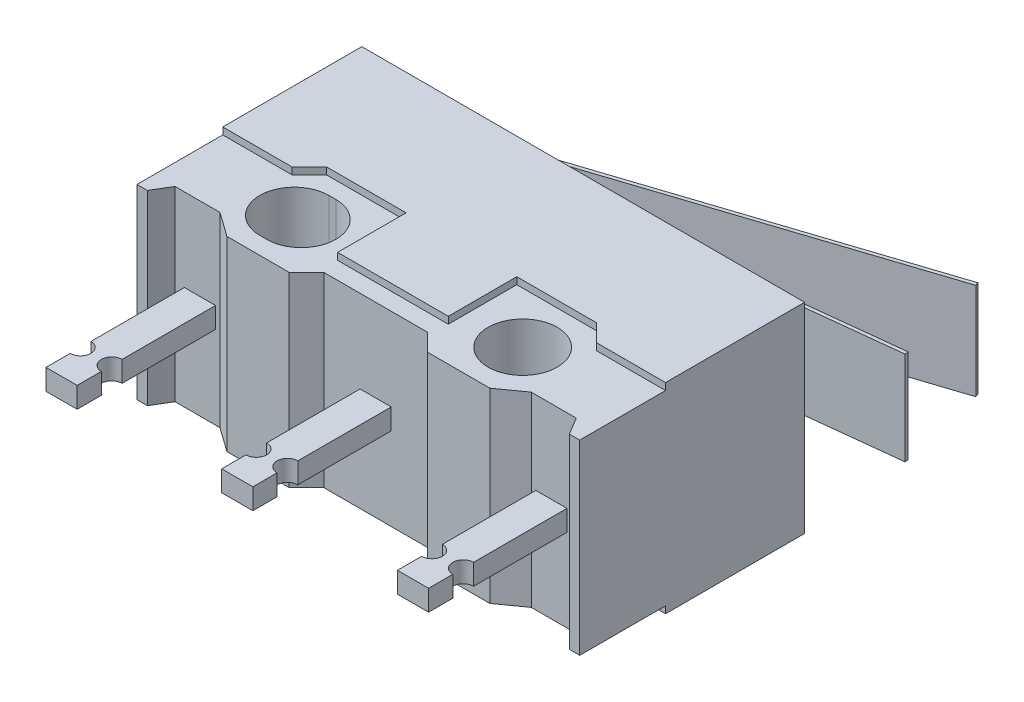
ISO-10303-21;
HEADER;
FILE_DESCRIPTION(('STEP AP214'),'2;1');
FILE_NAME('part.step','',(''),(''),'','','');
FILE_SCHEMA(('AUTOMOTIVE_DESIGN { 1 0 10303 214 1 1 1 1 }'));
ENDSEC;
DATA;
#1=APPLICATION_CONTEXT('core data for automotive mechanical design processes');
#2=APPLICATION_PROTOCOL_DEFINITION('international standard','automotive_design',2000,#1);
#3=PRODUCT_CONTEXT('',#1,'mechanical');
#4=PRODUCT('Part','Part','',(#3));
#5=PRODUCT_RELATED_PRODUCT_CATEGORY('part','',(#4));
#6=PRODUCT_DEFINITION_FORMATION('','',#4);
#7=PRODUCT_DEFINITION_CONTEXT('part definition',#1,'design');
#8=PRODUCT_DEFINITION('design','',#6,#7);
#9=PRODUCT_DEFINITION_SHAPE('','',#8);
#10=(LENGTH_UNIT() NAMED_UNIT(*) SI_UNIT(.MILLI.,.METRE.));
#11=(NAMED_UNIT(*) PLANE_ANGLE_UNIT() SI_UNIT($,.RADIAN.));
#12=(NAMED_UNIT(*) SI_UNIT($,.STERADIAN.) SOLID_ANGLE_UNIT());
#13=UNCERTAINTY_MEASURE_WITH_UNIT(LENGTH_MEASURE(1.E-05),#10,'distance_accuracy_value','');
#14=(GEOMETRIC_REPRESENTATION_CONTEXT(3) GLOBAL_UNCERTAINTY_ASSIGNED_CONTEXT((#13)) GLOBAL_UNIT_ASSIGNED_CONTEXT((#10,
#11,#12)) REPRESENTATION_CONTEXT('',''));
#15=CARTESIAN_POINT('',(0.,0.,0.));
#16=DIRECTION('',(0.,0.,1.));
#17=DIRECTION('',(1.,0.,0.));
#18=AXIS2_PLACEMENT_3D('',#15,#16,#17);
#19=CARTESIAN_POINT('',(-4.88613697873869,1.35,-3.56048402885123));
#20=DIRECTION('',(-0.110602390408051,0.,-0.99386473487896));
#21=DIRECTION('',(-0.99386473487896,0.,0.110602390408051));
#22=AXIS2_PLACEMENT_3D('',#19,#20,#21);
#23=PLANE('',#22);
#24=DIRECTION('',(0.99386473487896,0.,-0.110602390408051));
#25=VECTOR('',#24,1.);
#26=CARTESIAN_POINT('',(-4.88613697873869,-1.35,-3.56048402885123));
#27=LINE('',#26,#25);
#28=CARTESIAN_POINT('',(-4.88613697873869,-1.35,-3.56048402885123));
#29=VERTEX_POINT('',#28);
#30=CARTESIAN_POINT('',(7.60546179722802,-1.35,-4.95061352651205));
#31=VERTEX_POINT('',#30);
#32=EDGE_CURVE('E148',#29,#31,#27,.T.);
#33=ORIENTED_EDGE('',*,*,#32,.T.);
#34=DIRECTION('',(0.,-1.,0.));
#35=VECTOR('',#34,1.);
#36=CARTESIAN_POINT('',(7.60546179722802,1.35,-4.95061352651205));
#37=LINE('',#36,#35);
#38=CARTESIAN_POINT('',(7.60546179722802,1.35,-4.95061352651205));
#39=VERTEX_POINT('',#38);
#40=EDGE_CURVE('E12',#39,#31,#37,.T.);
#41=ORIENTED_EDGE('',*,*,#40,.F.);
#42=DIRECTION('',(0.99386473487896,0.,-0.110602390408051));
#43=VECTOR('',#42,1.);
#44=CARTESIAN_POINT('',(-4.88613697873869,1.35,-3.56048402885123));
#45=LINE('',#44,#43);
#46=CARTESIAN_POINT('',(-4.88613697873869,1.35,-3.56048402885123));
#47=VERTEX_POINT('',#46);
#48=EDGE_CURVE('E106',#47,#39,#45,.T.);
#49=ORIENTED_EDGE('',*,*,#48,.F.);
#50=DIRECTION('',(0.,-1.,0.));
#51=VECTOR('',#50,1.);
#52=CARTESIAN_POINT('',(-4.88613697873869,1.35,-3.56048402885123));
#53=LINE('',#52,#51);
#54=EDGE_CURVE('E147',#47,#29,#53,.T.);
#55=ORIENTED_EDGE('',*,*,#54,.T.);
#56=EDGE_LOOP('',(#33,#41,#49,#55));
#57=FACE_BOUND('',#56,.T.);
#58=ADVANCED_FACE('F51',(#57),#23,.F.);
#59=CARTESIAN_POINT('',(7.59440155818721,1.35,-5.05));
#60=DIRECTION('',(0.99386473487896,0.,-0.110602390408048));
#61=DIRECTION('',(-0.110602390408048,0.,-0.99386473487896));
#62=AXIS2_PLACEMENT_3D('',#59,#60,#61);
#63=PLANE('',#62);
#64=DIRECTION('',(0.110602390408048,0.,0.99386473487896));
#65=VECTOR('',#64,1.);
#66=CARTESIAN_POINT('',(7.59440155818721,-1.35,-5.05));
#67=LINE('',#66,#65);
#68=CARTESIAN_POINT('',(7.59440155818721,-1.35,-5.05));
#69=VERTEX_POINT('',#68);
#70=EDGE_CURVE('E151',#69,#31,#67,.T.);
#71=ORIENTED_EDGE('',*,*,#70,.F.);
#72=DIRECTION('',(0.,-1.,0.));
#73=VECTOR('',#72,1.);
#74=CARTESIAN_POINT('',(7.59440155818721,1.35,-5.05));
#75=LINE('',#74,#73);
#76=CARTESIAN_POINT('',(7.59440155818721,1.35,-5.05));
#77=VERTEX_POINT('',#76);
#78=EDGE_CURVE('E59',#77,#69,#75,.T.);
#79=ORIENTED_EDGE('',*,*,#78,.F.);
#80=DIRECTION('',(0.110602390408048,0.,0.99386473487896));
#81=VECTOR('',#80,1.);
#82=CARTESIAN_POINT('',(7.59440155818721,1.35,-5.05));
#83=LINE('',#82,#81);
#84=EDGE_CURVE('E190',#77,#39,#83,.T.);
#85=ORIENTED_EDGE('',*,*,#84,.T.);
#86=ORIENTED_EDGE('',*,*,#40,.T.);
#87=EDGE_LOOP('',(#71,#79,#85,#86));
#88=FACE_BOUND('',#87,.T.);
#89=ADVANCED_FACE('F181',(#88),#63,.T.);
#90=CARTESIAN_POINT('',(-4.8971972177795,1.35,-3.65987050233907));
#91=DIRECTION('',(-0.110602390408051,0.,-0.99386473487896));
#92=DIRECTION('',(-0.99386473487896,0.,0.110602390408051));
#93=AXIS2_PLACEMENT_3D('',#90,#91,#92);
#94=PLANE('',#93);
#95=DIRECTION('',(0.99386473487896,0.,-0.110602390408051));
#96=VECTOR('',#95,1.);
#97=CARTESIAN_POINT('',(-4.8971972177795,-1.35,-3.65987050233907));
#98=LINE('',#97,#96);
#99=CARTESIAN_POINT('',(-4.8971972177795,-1.35,-3.65987050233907));
#100=VERTEX_POINT('',#99);
#101=EDGE_CURVE('E154',#100,#69,#98,.T.);
#102=ORIENTED_EDGE('',*,*,#101,.F.);
#103=DIRECTION('',(0.,-1.,0.));
#104=VECTOR('',#103,1.);
#105=CARTESIAN_POINT('',(-4.8971972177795,1.35,-3.65987050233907));
#106=LINE('',#105,#104);
#107=CARTESIAN_POINT('',(-4.8971972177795,1.35,-3.65987050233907));
#108=VERTEX_POINT('',#107);
#109=EDGE_CURVE('E171',#108,#100,#106,.T.);
#110=ORIENTED_EDGE('',*,*,#109,.F.);
#111=DIRECTION('',(0.99386473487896,0.,-0.110602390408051));
#112=VECTOR('',#111,1.);
#113=CARTESIAN_POINT('',(-4.8971972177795,1.35,-3.65987050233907));
#114=LINE('',#113,#112);
#115=EDGE_CURVE('E178',#108,#77,#114,.T.);
#116=ORIENTED_EDGE('',*,*,#115,.T.);
#117=ORIENTED_EDGE('',*,*,#78,.T.);
#118=EDGE_LOOP('',(#102,#110,#116,#117));
#119=FACE_BOUND('',#118,.T.);
#120=ADVANCED_FACE('F176',(#119),#94,.T.);
#121=CARTESIAN_POINT('',(-4.85295626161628,1.35,-3.26232460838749));
#122=DIRECTION('',(0.,-1.,0.));
#123=DIRECTION('',(0.,0.,-1.));
#124=AXIS2_PLACEMENT_3D('',#121,#122,#123);
#125=CYLINDRICAL_SURFACE('',#124,0.4);
#126=CARTESIAN_POINT('',(-4.85295626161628,-1.35,-3.26232460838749));
#127=DIRECTION('',(0.,-1.,0.));
#128=DIRECTION('',(0.,0.,1.));
#129=AXIS2_PLACEMENT_3D('',#126,#127,#128);
#130=CIRCLE('',#129,0.4);
#131=CARTESIAN_POINT('',(-5.21552109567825,-1.35,-3.43128241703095));
#132=VERTEX_POINT('',#131);
#133=EDGE_CURVE('E157',#132,#100,#130,.T.);
#134=ORIENTED_EDGE('',*,*,#133,.F.);
#135=DIRECTION('',(0.,-1.,0.));
#136=VECTOR('',#135,1.);
#137=CARTESIAN_POINT('',(-5.21552109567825,1.35,-3.43128241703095));
#138=LINE('',#137,#136);
#139=CARTESIAN_POINT('',(-5.21552109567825,1.35,-3.43128241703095));
#140=VERTEX_POINT('',#139);
#141=EDGE_CURVE('E169',#140,#132,#138,.T.);
#142=ORIENTED_EDGE('',*,*,#141,.F.);
#143=CARTESIAN_POINT('',(-4.85295626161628,1.35,-3.26232460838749));
#144=DIRECTION('',(0.,-1.,0.));
#145=DIRECTION('',(0.,0.,1.));
#146=AXIS2_PLACEMENT_3D('',#143,#144,#145);
#147=CIRCLE('',#146,0.4);
#148=EDGE_CURVE('E142',#140,#108,#147,.T.);
#149=ORIENTED_EDGE('',*,*,#148,.T.);
#150=ORIENTED_EDGE('',*,*,#109,.T.);
#151=EDGE_LOOP('',(#134,#142,#149,#150));
#152=FACE_BOUND('',#151,.T.);
#153=ADVANCED_FACE('F188',(#152),#125,.T.);
#154=CARTESIAN_POINT('',(-5.3,1.35,-3.24999999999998));
#155=DIRECTION('',(-0.906412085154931,0.,-0.422394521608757));
#156=DIRECTION('',(-0.422394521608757,0.,0.906412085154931));
#157=AXIS2_PLACEMENT_3D('',#154,#155,#156);
#158=PLANE('',#157);
#159=DIRECTION('',(0.422394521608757,0.,-0.906412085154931));
#160=VECTOR('',#159,1.);
#161=CARTESIAN_POINT('',(-5.3,-1.35,-3.24999999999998));
#162=LINE('',#161,#160);
#163=CARTESIAN_POINT('',(-5.3,-1.35,-3.24999999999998));
#164=VERTEX_POINT('',#163);
#165=EDGE_CURVE('E160',#164,#132,#162,.T.);
#166=ORIENTED_EDGE('',*,*,#165,.F.);
#167=DIRECTION('',(0.,-1.,0.));
#168=VECTOR('',#167,1.);
#169=CARTESIAN_POINT('',(-5.3,1.35,-3.24999999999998));
#170=LINE('',#169,#168);
#171=CARTESIAN_POINT('',(-5.3,1.35,-3.24999999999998));
#172=VERTEX_POINT('',#171);
#173=EDGE_CURVE('E130',#172,#164,#170,.T.);
#174=ORIENTED_EDGE('',*,*,#173,.F.);
#175=DIRECTION('',(0.422394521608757,0.,-0.906412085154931));
#176=VECTOR('',#175,1.);
#177=CARTESIAN_POINT('',(-5.3,1.35,-3.24999999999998));
#178=LINE('',#177,#176);
#179=EDGE_CURVE('E140',#172,#140,#178,.T.);
#180=ORIENTED_EDGE('',*,*,#179,.T.);
#181=ORIENTED_EDGE('',*,*,#141,.T.);
#182=EDGE_LOOP('',(#166,#174,#180,#181));
#183=FACE_BOUND('',#182,.T.);
#184=ADVANCED_FACE('F195',(#183),#158,.T.);
#185=CARTESIAN_POINT('',(-5.20935879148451,1.35,-3.20776054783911));
#186=DIRECTION('',(-0.422394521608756,0.,0.906412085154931));
#187=DIRECTION('',(0.906412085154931,0.,0.422394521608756));
#188=AXIS2_PLACEMENT_3D('',#185,#186,#187);
#189=PLANE('',#188);
#190=DIRECTION('',(-0.906412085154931,0.,-0.422394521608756));
#191=VECTOR('',#190,1.);
#192=CARTESIAN_POINT('',(-5.20935879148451,-1.35,-3.20776054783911));
#193=LINE('',#192,#191);
#194=CARTESIAN_POINT('',(-5.20935879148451,-1.35,-3.20776054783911));
#195=VERTEX_POINT('',#194);
#196=EDGE_CURVE('E129',#195,#164,#193,.T.);
#197=ORIENTED_EDGE('',*,*,#196,.F.);
#198=DIRECTION('',(0.,-1.,0.));
#199=VECTOR('',#198,1.);
#200=CARTESIAN_POINT('',(-5.20935879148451,1.35,-3.20776054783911));
#201=LINE('',#200,#199);
#202=CARTESIAN_POINT('',(-5.20935879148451,1.35,-3.20776054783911));
#203=VERTEX_POINT('',#202);
#204=EDGE_CURVE('E123',#203,#195,#201,.T.);
#205=ORIENTED_EDGE('',*,*,#204,.F.);
#206=DIRECTION('',(-0.906412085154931,0.,-0.422394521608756));
#207=VECTOR('',#206,1.);
#208=CARTESIAN_POINT('',(-5.20935879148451,1.35,-3.20776054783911));
#209=LINE('',#208,#207);
#210=EDGE_CURVE('E127',#203,#172,#209,.T.);
#211=ORIENTED_EDGE('',*,*,#210,.T.);
#212=ORIENTED_EDGE('',*,*,#173,.T.);
#213=EDGE_LOOP('',(#197,#205,#211,#212));
#214=FACE_BOUND('',#213,.T.);
#215=ADVANCED_FACE('F125',(#214),#189,.T.);
#216=CARTESIAN_POINT('',(-5.20935879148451,1.35,-3.20776054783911));
#217=DIRECTION('',(-0.906412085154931,0.,-0.422394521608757));
#218=DIRECTION('',(-0.422394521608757,0.,0.906412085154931));
#219=AXIS2_PLACEMENT_3D('',#216,#217,#218);
#220=PLANE('',#219);
#221=DIRECTION('',(0.422394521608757,0.,-0.906412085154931));
#222=VECTOR('',#221,1.);
#223=CARTESIAN_POINT('',(-5.20935879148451,-1.35,-3.20776054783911));
#224=LINE('',#223,#222);
#225=CARTESIAN_POINT('',(-5.12487988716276,-1.35,-3.38904296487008));
#226=VERTEX_POINT('',#225);
#227=EDGE_CURVE('E94',#195,#226,#224,.T.);
#228=ORIENTED_EDGE('',*,*,#227,.T.);
#229=DIRECTION('',(0.,-1.,0.));
#230=VECTOR('',#229,1.);
#231=CARTESIAN_POINT('',(-5.12487988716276,1.35,-3.38904296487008));
#232=LINE('',#231,#230);
#233=CARTESIAN_POINT('',(-5.12487988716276,1.35,-3.38904296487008));
#234=VERTEX_POINT('',#233);
#235=EDGE_CURVE('E131',#234,#226,#232,.T.);
#236=ORIENTED_EDGE('',*,*,#235,.F.);
#237=DIRECTION('',(0.422394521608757,0.,-0.906412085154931));
#238=VECTOR('',#237,1.);
#239=CARTESIAN_POINT('',(-5.20935879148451,1.35,-3.20776054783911));
#240=LINE('',#239,#238);
#241=EDGE_CURVE('E133',#203,#234,#240,.T.);
#242=ORIENTED_EDGE('',*,*,#241,.F.);
#243=ORIENTED_EDGE('',*,*,#204,.T.);
#244=EDGE_LOOP('',(#228,#236,#242,#243));
#245=FACE_BOUND('',#244,.T.);
#246=ADVANCED_FACE('F134',(#245),#220,.F.);
#247=CARTESIAN_POINT('',(-4.85295626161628,1.35,-3.26232460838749));
#248=DIRECTION('',(0.,-1.,0.));
#249=DIRECTION('',(0.,0.,-1.));
#250=AXIS2_PLACEMENT_3D('',#247,#248,#249);
#251=CYLINDRICAL_SURFACE('',#250,0.3);
#252=CARTESIAN_POINT('',(-4.85295626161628,-1.35,-3.26232460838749));
#253=DIRECTION('',(0.,1.,0.));
#254=DIRECTION('',(1.,0.,0.));
#255=AXIS2_PLACEMENT_3D('',#252,#253,#254);
#256=CIRCLE('',#255,0.3);
#257=EDGE_CURVE('E100',#226,#29,#256,.F.);
#258=ORIENTED_EDGE('',*,*,#257,.T.);
#259=ORIENTED_EDGE('',*,*,#54,.F.);
#260=CARTESIAN_POINT('',(-4.85295626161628,1.35,-3.26232460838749));
#261=DIRECTION('',(0.,1.,0.));
#262=DIRECTION('',(1.,0.,0.));
#263=AXIS2_PLACEMENT_3D('',#260,#261,#262);
#264=CIRCLE('',#263,0.3);
#265=EDGE_CURVE('E67',#234,#47,#264,.F.);
#266=ORIENTED_EDGE('',*,*,#265,.F.);
#267=ORIENTED_EDGE('',*,*,#235,.T.);
#268=EDGE_LOOP('',(#258,#259,#266,#267));
#269=FACE_BOUND('',#268,.T.);
#270=ADVANCED_FACE('F197',(#269),#251,.F.);
#271=CARTESIAN_POINT('',(-4.85295626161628,1.35,-3.26232460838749));
#272=DIRECTION('',(0.,-1.,0.));
#273=DIRECTION('',(-1.,0.,0.));
#274=AXIS2_PLACEMENT_3D('',#271,#272,#273);
#275=PLANE('',#274);
#276=ORIENTED_EDGE('',*,*,#48,.T.);
#277=ORIENTED_EDGE('',*,*,#84,.F.);
#278=ORIENTED_EDGE('',*,*,#115,.F.);
#279=ORIENTED_EDGE('',*,*,#148,.F.);
#280=ORIENTED_EDGE('',*,*,#179,.F.);
#281=ORIENTED_EDGE('',*,*,#210,.F.);
#282=ORIENTED_EDGE('',*,*,#241,.T.);
#283=ORIENTED_EDGE('',*,*,#265,.T.);
#284=EDGE_LOOP('',(#276,#277,#278,#279,#280,#281,#282,#283));
#285=FACE_BOUND('',#284,.T.);
#286=ADVANCED_FACE('F137',(#285),#275,.F.);
#287=CARTESIAN_POINT('',(-4.85295626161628,-1.35,-3.26232460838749));
#288=DIRECTION('',(0.,-1.,0.));
#289=DIRECTION('',(-1.,0.,0.));
#290=AXIS2_PLACEMENT_3D('',#287,#288,#289);
#291=PLANE('',#290);
#292=ORIENTED_EDGE('',*,*,#32,.F.);
#293=ORIENTED_EDGE('',*,*,#257,.F.);
#294=ORIENTED_EDGE('',*,*,#227,.F.);
#295=ORIENTED_EDGE('',*,*,#196,.T.);
#296=ORIENTED_EDGE('',*,*,#165,.T.);
#297=ORIENTED_EDGE('',*,*,#133,.T.);
#298=ORIENTED_EDGE('',*,*,#101,.T.);
#299=ORIENTED_EDGE('',*,*,#70,.T.);
#300=EDGE_LOOP('',(#292,#293,#294,#295,#296,#297,#298,#299));
#301=FACE_BOUND('',#300,.T.);
#302=ADVANCED_FACE('F184',(#301),#291,.T.);
#303=CLOSED_SHELL('',(#58,#89,#120,#153,#184,#215,#246,#270,#286,#302));
#304=MANIFOLD_SOLID_BREP('B2',#303);
#305=CARTESIAN_POINT('',(-4.99344453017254,1.395,-3.73507563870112));
#306=DIRECTION('',(-0.311481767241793,0.,-0.950252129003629));
#307=DIRECTION('',(-0.950252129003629,0.,0.311481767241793));
#308=AXIS2_PLACEMENT_3D('',#305,#306,#307);
#309=PLANE('',#308);
#310=DIRECTION('',(0.950252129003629,0.,-0.311481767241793));
#311=VECTOR('',#310,1.);
#312=CARTESIAN_POINT('',(-4.99344453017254,-1.395,-3.73507563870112));
#313=LINE('',#312,#311);
#314=CARTESIAN_POINT('',(-4.99344453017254,-1.395,-3.73507563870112));
#315=VERTEX_POINT('',#314);
#316=CARTESIAN_POINT('',(6.94999999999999,-1.39500000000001,-7.64999999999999));
#317=VERTEX_POINT('',#316);
#318=EDGE_CURVE('E364',#315,#317,#313,.T.);
#319=ORIENTED_EDGE('',*,*,#318,.T.);
#320=DIRECTION('',(0.,-1.,0.));
#321=VECTOR('',#320,1.);
#322=CARTESIAN_POINT('',(6.94999999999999,1.39499999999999,-7.64999999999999));
#323=LINE('',#322,#321);
#324=CARTESIAN_POINT('',(6.94999999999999,1.39499999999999,-7.64999999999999));
#325=VERTEX_POINT('',#324);
#326=EDGE_CURVE('E49',#325,#317,#323,.T.);
#327=ORIENTED_EDGE('',*,*,#326,.F.);
#328=DIRECTION('',(0.950252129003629,0.,-0.311481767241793));
#329=VECTOR('',#328,1.);
#330=CARTESIAN_POINT('',(-4.99344453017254,1.395,-3.73507563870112));
#331=LINE('',#330,#329);
#332=CARTESIAN_POINT('',(-4.99344453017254,1.395,-3.73507563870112));
#333=VERTEX_POINT('',#332);
#334=EDGE_CURVE('E322',#333,#325,#331,.T.);
#335=ORIENTED_EDGE('',*,*,#334,.F.);
#336=DIRECTION('',(0.,-1.,0.));
#337=VECTOR('',#336,1.);
#338=CARTESIAN_POINT('',(-4.99344453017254,1.395,-3.73507563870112));
#339=LINE('',#338,#337);
#340=EDGE_CURVE('E363',#333,#315,#339,.T.);
#341=ORIENTED_EDGE('',*,*,#340,.T.);
#342=EDGE_LOOP('',(#319,#327,#335,#341));
#343=FACE_BOUND('',#342,.T.);
#344=ADVANCED_FACE('F267',(#343),#309,.F.);
#345=CARTESIAN_POINT('',(6.91885182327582,1.39499999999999,-7.74502521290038));
#346=DIRECTION('',(0.950252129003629,0.,-0.311481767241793));
#347=DIRECTION('',(-0.311481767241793,0.,-0.950252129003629));
#348=AXIS2_PLACEMENT_3D('',#345,#346,#347);
#349=PLANE('',#348);
#350=DIRECTION('',(0.311481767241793,0.,0.950252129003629));
#351=VECTOR('',#350,1.);
#352=CARTESIAN_POINT('',(6.91885182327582,-1.39500000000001,-7.74502521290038));
#353=LINE('',#352,#351);
#354=CARTESIAN_POINT('',(6.91885182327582,-1.39500000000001,-7.74502521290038));
#355=VERTEX_POINT('',#354);
#356=EDGE_CURVE('E367',#355,#317,#353,.T.);
#357=ORIENTED_EDGE('',*,*,#356,.F.);
#358=DIRECTION('',(0.,-1.,0.));
#359=VECTOR('',#358,1.);
#360=CARTESIAN_POINT('',(6.91885182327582,1.39499999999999,-7.74502521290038));
#361=LINE('',#360,#359);
#362=CARTESIAN_POINT('',(6.91885182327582,1.39499999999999,-7.74502521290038));
#363=VERTEX_POINT('',#362);
#364=EDGE_CURVE('E275',#363,#355,#361,.T.);
#365=ORIENTED_EDGE('',*,*,#364,.F.);
#366=DIRECTION('',(0.311481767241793,0.,0.950252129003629));
#367=VECTOR('',#366,1.);
#368=CARTESIAN_POINT('',(6.91885182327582,1.39499999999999,-7.74502521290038));
#369=LINE('',#368,#367);
#370=EDGE_CURVE('E406',#363,#325,#369,.T.);
#371=ORIENTED_EDGE('',*,*,#370,.T.);
#372=ORIENTED_EDGE('',*,*,#326,.T.);
#373=EDGE_LOOP('',(#357,#365,#371,#372));
#374=FACE_BOUND('',#373,.T.);
#375=ADVANCED_FACE('F397',(#374),#349,.T.);
#376=CARTESIAN_POINT('',(-5.02459270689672,1.395,-3.8301008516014));
#377=DIRECTION('',(-0.311481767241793,0.,-0.950252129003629));
#378=DIRECTION('',(-0.950252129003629,0.,0.311481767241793));
#379=AXIS2_PLACEMENT_3D('',#376,#377,#378);
#380=PLANE('',#379);
#381=DIRECTION('',(0.950252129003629,0.,-0.311481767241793));
#382=VECTOR('',#381,1.);
#383=CARTESIAN_POINT('',(-5.02459270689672,-1.395,-3.8301008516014));
#384=LINE('',#383,#382);
#385=CARTESIAN_POINT('',(-5.02459270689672,-1.395,-3.8301008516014));
#386=VERTEX_POINT('',#385);
#387=EDGE_CURVE('E370',#386,#355,#384,.T.);
#388=ORIENTED_EDGE('',*,*,#387,.F.);
#389=DIRECTION('',(0.,-1.,0.));
#390=VECTOR('',#389,1.);
#391=CARTESIAN_POINT('',(-5.02459270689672,1.395,-3.8301008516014));
#392=LINE('',#391,#390);
#393=CARTESIAN_POINT('',(-5.02459270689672,1.395,-3.8301008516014));
#394=VERTEX_POINT('',#393);
#395=EDGE_CURVE('E387',#394,#386,#392,.T.);
#396=ORIENTED_EDGE('',*,*,#395,.F.);
#397=DIRECTION('',(0.950252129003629,0.,-0.311481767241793));
#398=VECTOR('',#397,1.);
#399=CARTESIAN_POINT('',(-5.02459270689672,1.395,-3.8301008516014));
#400=LINE('',#399,#398);
#401=EDGE_CURVE('E394',#394,#363,#400,.T.);
#402=ORIENTED_EDGE('',*,*,#401,.T.);
#403=ORIENTED_EDGE('',*,*,#364,.T.);
#404=EDGE_LOOP('',(#388,#396,#402,#403));
#405=FACE_BOUND('',#404,.T.);
#406=ADVANCED_FACE('F392',(#405),#380,.T.);
#407=CARTESIAN_POINT('',(-4.9,1.395,-3.44999999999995));
#408=DIRECTION('',(0.,-1.,0.));
#409=DIRECTION('',(0.,0.,-1.));
#410=AXIS2_PLACEMENT_3D('',#407,#408,#409);
#411=CYLINDRICAL_SURFACE('',#410,0.4);
#412=CARTESIAN_POINT('',(-4.9,-1.395,-3.44999999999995));
#413=DIRECTION('',(0.,1.,0.));
#414=DIRECTION('',(1.,0.,0.));
#415=AXIS2_PLACEMENT_3D('',#412,#413,#414);
#416=CIRCLE('',#415,0.4);
#417=CARTESIAN_POINT('',(-5.3,-1.395,-3.44999999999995));
#418=VERTEX_POINT('',#417);
#419=EDGE_CURVE('E373',#418,#386,#416,.F.);
#420=ORIENTED_EDGE('',*,*,#419,.F.);
#421=DIRECTION('',(0.,-1.,0.));
#422=VECTOR('',#421,1.);
#423=CARTESIAN_POINT('',(-5.3,1.395,-3.44999999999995));
#424=LINE('',#423,#422);
#425=CARTESIAN_POINT('',(-5.3,1.395,-3.44999999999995));
#426=VERTEX_POINT('',#425);
#427=EDGE_CURVE('E385',#426,#418,#424,.T.);
#428=ORIENTED_EDGE('',*,*,#427,.F.);
#429=CARTESIAN_POINT('',(-4.9,1.395,-3.44999999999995));
#430=DIRECTION('',(0.,1.,0.));
#431=DIRECTION('',(1.,0.,0.));
#432=AXIS2_PLACEMENT_3D('',#429,#430,#431);
#433=CIRCLE('',#432,0.4);
#434=EDGE_CURVE('E358',#426,#394,#433,.F.);
#435=ORIENTED_EDGE('',*,*,#434,.T.);
#436=ORIENTED_EDGE('',*,*,#395,.T.);
#437=EDGE_LOOP('',(#420,#428,#435,#436));
#438=FACE_BOUND('',#437,.T.);
#439=ADVANCED_FACE('F404',(#438),#411,.T.);
#440=CARTESIAN_POINT('',(-5.3,1.395,-3.24999999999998));
#441=DIRECTION('',(-1.,0.,0.));
#442=DIRECTION('',(0.,0.,1.));
#443=AXIS2_PLACEMENT_3D('',#440,#441,#442);
#444=PLANE('',#443);
#445=DIRECTION('',(0.,0.,-1.));
#446=VECTOR('',#445,1.);
#447=CARTESIAN_POINT('',(-5.3,-1.395,-3.24999999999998));
#448=LINE('',#447,#446);
#449=CARTESIAN_POINT('',(-5.3,-1.395,-3.24999999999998));
#450=VERTEX_POINT('',#449);
#451=EDGE_CURVE('E376',#450,#418,#448,.T.);
#452=ORIENTED_EDGE('',*,*,#451,.F.);
#453=DIRECTION('',(0.,-1.,0.));
#454=VECTOR('',#453,1.);
#455=CARTESIAN_POINT('',(-5.3,1.395,-3.24999999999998));
#456=LINE('',#455,#454);
#457=CARTESIAN_POINT('',(-5.3,1.395,-3.24999999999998));
#458=VERTEX_POINT('',#457);
#459=EDGE_CURVE('E346',#458,#450,#456,.T.);
#460=ORIENTED_EDGE('',*,*,#459,.F.);
#461=DIRECTION('',(0.,0.,-1.));
#462=VECTOR('',#461,1.);
#463=CARTESIAN_POINT('',(-5.3,1.395,-3.24999999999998));
#464=LINE('',#463,#462);
#465=EDGE_CURVE('E356',#458,#426,#464,.T.);
#466=ORIENTED_EDGE('',*,*,#465,.T.);
#467=ORIENTED_EDGE('',*,*,#427,.T.);
#468=EDGE_LOOP('',(#452,#460,#466,#467));
#469=FACE_BOUND('',#468,.T.);
#470=ADVANCED_FACE('F411',(#469),#444,.T.);
#471=CARTESIAN_POINT('',(-5.2,1.395,-3.24999999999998));
#472=DIRECTION('',(0.,0.,1.));
#473=DIRECTION('',(1.,0.,0.));
#474=AXIS2_PLACEMENT_3D('',#471,#472,#473);
#475=PLANE('',#474);
#476=DIRECTION('',(-1.,0.,0.));
#477=VECTOR('',#476,1.);
#478=CARTESIAN_POINT('',(-5.2,-1.395,-3.24999999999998));
#479=LINE('',#478,#477);
#480=CARTESIAN_POINT('',(-5.2,-1.395,-3.24999999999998));
#481=VERTEX_POINT('',#480);
#482=EDGE_CURVE('E345',#481,#450,#479,.T.);
#483=ORIENTED_EDGE('',*,*,#482,.F.);
#484=DIRECTION('',(0.,-1.,0.));
#485=VECTOR('',#484,1.);
#486=CARTESIAN_POINT('',(-5.2,1.395,-3.24999999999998));
#487=LINE('',#486,#485);
#488=CARTESIAN_POINT('',(-5.2,1.395,-3.24999999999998));
#489=VERTEX_POINT('',#488);
#490=EDGE_CURVE('E339',#489,#481,#487,.T.);
#491=ORIENTED_EDGE('',*,*,#490,.F.);
#492=DIRECTION('',(-1.,0.,0.));
#493=VECTOR('',#492,1.);
#494=CARTESIAN_POINT('',(-5.2,1.395,-3.24999999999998));
#495=LINE('',#494,#493);
#496=EDGE_CURVE('E343',#489,#458,#495,.T.);
#497=ORIENTED_EDGE('',*,*,#496,.T.);
#498=ORIENTED_EDGE('',*,*,#459,.T.);
#499=EDGE_LOOP('',(#483,#491,#497,#498));
#500=FACE_BOUND('',#499,.T.);
#501=ADVANCED_FACE('F341',(#500),#475,.T.);
#502=CARTESIAN_POINT('',(-5.2,1.395,-3.24999999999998));
#503=DIRECTION('',(-1.,0.,0.));
#504=DIRECTION('',(0.,0.,1.));
#505=AXIS2_PLACEMENT_3D('',#502,#503,#504);
#506=PLANE('',#505);
#507=DIRECTION('',(0.,0.,-1.));
#508=VECTOR('',#507,1.);
#509=CARTESIAN_POINT('',(-5.2,-1.395,-3.24999999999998));
#510=LINE('',#509,#508);
#511=CARTESIAN_POINT('',(-5.2,-1.395,-3.44999999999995));
#512=VERTEX_POINT('',#511);
#513=EDGE_CURVE('E310',#481,#512,#510,.T.);
#514=ORIENTED_EDGE('',*,*,#513,.T.);
#515=DIRECTION('',(0.,-1.,0.));
#516=VECTOR('',#515,1.);
#517=CARTESIAN_POINT('',(-5.2,1.395,-3.44999999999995));
#518=LINE('',#517,#516);
#519=CARTESIAN_POINT('',(-5.2,1.395,-3.44999999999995));
#520=VERTEX_POINT('',#519);
#521=EDGE_CURVE('E347',#520,#512,#518,.T.);
#522=ORIENTED_EDGE('',*,*,#521,.F.);
#523=DIRECTION('',(0.,0.,-1.));
#524=VECTOR('',#523,1.);
#525=CARTESIAN_POINT('',(-5.2,1.395,-3.24999999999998));
#526=LINE('',#525,#524);
#527=EDGE_CURVE('E349',#489,#520,#526,.T.);
#528=ORIENTED_EDGE('',*,*,#527,.F.);
#529=ORIENTED_EDGE('',*,*,#490,.T.);
#530=EDGE_LOOP('',(#514,#522,#528,#529));
#531=FACE_BOUND('',#530,.T.);
#532=ADVANCED_FACE('F350',(#531),#506,.F.);
#533=CARTESIAN_POINT('',(-4.9,1.395,-3.44999999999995));
#534=DIRECTION('',(0.,-1.,0.));
#535=DIRECTION('',(0.,0.,-1.));
#536=AXIS2_PLACEMENT_3D('',#533,#534,#535);
#537=CYLINDRICAL_SURFACE('',#536,0.3);
#538=CARTESIAN_POINT('',(-4.9,-1.395,-3.44999999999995));
#539=DIRECTION('',(0.,-1.,0.));
#540=DIRECTION('',(0.,0.,-1.));
#541=AXIS2_PLACEMENT_3D('',#538,#539,#540);
#542=CIRCLE('',#541,0.3);
#543=EDGE_CURVE('E316',#512,#315,#542,.T.);
#544=ORIENTED_EDGE('',*,*,#543,.T.);
#545=ORIENTED_EDGE('',*,*,#340,.F.);
#546=CARTESIAN_POINT('',(-4.9,1.395,-3.44999999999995));
#547=DIRECTION('',(0.,-1.,0.));
#548=DIRECTION('',(0.,0.,-1.));
#549=AXIS2_PLACEMENT_3D('',#546,#547,#548);
#550=CIRCLE('',#549,0.3);
#551=EDGE_CURVE('E283',#520,#333,#550,.T.);
#552=ORIENTED_EDGE('',*,*,#551,.F.);
#553=ORIENTED_EDGE('',*,*,#521,.T.);
#554=EDGE_LOOP('',(#544,#545,#552,#553));
#555=FACE_BOUND('',#554,.T.);
#556=ADVANCED_FACE('F413',(#555),#537,.F.);
#557=CARTESIAN_POINT('',(-4.9,1.395,-3.44999999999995));
#558=DIRECTION('',(0.,1.,0.));
#559=DIRECTION('',(1.,0.,0.));
#560=AXIS2_PLACEMENT_3D('',#557,#558,#559);
#561=PLANE('',#560);
#562=ORIENTED_EDGE('',*,*,#334,.T.);
#563=ORIENTED_EDGE('',*,*,#370,.F.);
#564=ORIENTED_EDGE('',*,*,#401,.F.);
#565=ORIENTED_EDGE('',*,*,#434,.F.);
#566=ORIENTED_EDGE('',*,*,#465,.F.);
#567=ORIENTED_EDGE('',*,*,#496,.F.);
#568=ORIENTED_EDGE('',*,*,#527,.T.);
#569=ORIENTED_EDGE('',*,*,#551,.T.);
#570=EDGE_LOOP('',(#562,#563,#564,#565,#566,#567,#568,#569));
#571=FACE_BOUND('',#570,.T.);
#572=ADVANCED_FACE('F353',(#571),#561,.T.);
#573=CARTESIAN_POINT('',(-4.9,-1.395,-3.44999999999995));
#574=DIRECTION('',(0.,1.,0.));
#575=DIRECTION('',(1.,0.,0.));
#576=AXIS2_PLACEMENT_3D('',#573,#574,#575);
#577=PLANE('',#576);
#578=ORIENTED_EDGE('',*,*,#318,.F.);
#579=ORIENTED_EDGE('',*,*,#543,.F.);
#580=ORIENTED_EDGE('',*,*,#513,.F.);
#581=ORIENTED_EDGE('',*,*,#482,.T.);
#582=ORIENTED_EDGE('',*,*,#451,.T.);
#583=ORIENTED_EDGE('',*,*,#419,.T.);
#584=ORIENTED_EDGE('',*,*,#387,.T.);
#585=ORIENTED_EDGE('',*,*,#356,.T.);
#586=EDGE_LOOP('',(#578,#579,#580,#581,#582,#583,#584,#585));
#587=FACE_BOUND('',#586,.T.);
#588=ADVANCED_FACE('F400',(#587),#577,.F.);
#589=CLOSED_SHELL('',(#344,#375,#406,#439,#470,#501,#532,#556,#572,#588));
#590=MANIFOLD_SOLID_BREP('B6',#589);
#591=CARTESIAN_POINT('',(-2.74,1.4,-3.65000000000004));
#592=DIRECTION('',(0.,0.,1.));
#593=DIRECTION('',(1.,0.,0.));
#594=AXIS2_PLACEMENT_3D('',#591,#592,#593);
#595=PLANE('',#594);
#596=CARTESIAN_POINT('',(-2.34,1.,-3.65000000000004));
#597=DIRECTION('',(0.,0.,1.));
#598=DIRECTION('',(1.,0.,0.));
#599=AXIS2_PLACEMENT_3D('',#596,#597,#598);
#600=CIRCLE('',#599,0.3);
#601=CARTESIAN_POINT('',(-2.34,1.3,-3.65000000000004));
#602=VERTEX_POINT('',#601);
#603=CARTESIAN_POINT('',(-2.64,1.,-3.65000000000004));
#604=VERTEX_POINT('',#603);
#605=EDGE_CURVE('E1490',#602,#604,#600,.T.);
#606=ORIENTED_EDGE('',*,*,#605,.F.);
#607=DIRECTION('',(-1.,0.,0.));
#608=VECTOR('',#607,1.);
#609=CARTESIAN_POINT('',(-2.74,1.3,-3.65000000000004));
#610=LINE('',#609,#608);
#611=CARTESIAN_POINT('',(-2.24,1.3,-3.65000000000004));
#612=VERTEX_POINT('',#611);
#613=EDGE_CURVE('E1460',#602,#612,#610,.F.);
#614=ORIENTED_EDGE('',*,*,#613,.T.);
#615=CARTESIAN_POINT('',(-2.24,1.,-3.65000000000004));
#616=DIRECTION('',(0.,0.,1.));
#617=DIRECTION('',(1.,0.,0.));
#618=AXIS2_PLACEMENT_3D('',#615,#616,#617);
#619=CIRCLE('',#618,0.3);
#620=CARTESIAN_POINT('',(-1.94,1.,-3.65000000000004));
#621=VERTEX_POINT('',#620);
#622=EDGE_CURVE('E1488',#621,#612,#619,.T.);
#623=ORIENTED_EDGE('',*,*,#622,.F.);
#624=DIRECTION('',(0.,-1.,0.));
#625=VECTOR('',#624,1.);
#626=CARTESIAN_POINT('',(-1.94,1.4,-3.65000000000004));
#627=LINE('',#626,#625);
#628=CARTESIAN_POINT('',(-1.94,-1.,-3.65000000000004));
#629=VERTEX_POINT('',#628);
#630=EDGE_CURVE('E1463',#621,#629,#627,.T.);
#631=ORIENTED_EDGE('',*,*,#630,.T.);
#632=CARTESIAN_POINT('',(-2.24,-1.,-3.65000000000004));
#633=DIRECTION('',(0.,0.,1.));
#634=DIRECTION('',(1.,0.,0.));
#635=AXIS2_PLACEMENT_3D('',#632,#633,#634);
#636=CIRCLE('',#635,0.3);
#637=CARTESIAN_POINT('',(-2.24,-1.3,-3.65000000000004));
#638=VERTEX_POINT('',#637);
#639=EDGE_CURVE('E1485',#638,#629,#636,.T.);
#640=ORIENTED_EDGE('',*,*,#639,.F.);
#641=DIRECTION('',(-1.,0.,0.));
#642=VECTOR('',#641,1.);
#643=CARTESIAN_POINT('',(-2.74,-1.3,-3.65000000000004));
#644=LINE('',#643,#642);
#645=CARTESIAN_POINT('',(-2.34,-1.3,-3.65000000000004));
#646=VERTEX_POINT('',#645);
#647=EDGE_CURVE('E1454',#638,#646,#644,.T.);
#648=ORIENTED_EDGE('',*,*,#647,.T.);
#649=CARTESIAN_POINT('',(-2.34,-1.,-3.65000000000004));
#650=DIRECTION('',(0.,0.,1.));
#651=DIRECTION('',(1.,0.,0.));
#652=AXIS2_PLACEMENT_3D('',#649,#650,#651);
#653=CIRCLE('',#652,0.3);
#654=CARTESIAN_POINT('',(-2.64,-1.,-3.65000000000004));
#655=VERTEX_POINT('',#654);
#656=EDGE_CURVE('E1482',#655,#646,#653,.T.);
#657=ORIENTED_EDGE('',*,*,#656,.F.);
#658=DIRECTION('',(0.,-1.,0.));
#659=VECTOR('',#658,1.);
#660=CARTESIAN_POINT('',(-2.64,1.4,-3.65000000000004));
#661=LINE('',#660,#659);
#662=EDGE_CURVE('E1457',#655,#604,#661,.F.);
#663=ORIENTED_EDGE('',*,*,#662,.T.);
#664=EDGE_LOOP('',(#606,#614,#623,#631,#640,#648,#657,#663));
#665=FACE_BOUND('',#664,.T.);
#666=ADVANCED_FACE('F474',(#665),#595,.F.);
#667=CARTESIAN_POINT('',(-6.4,2.895,-3.24999999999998));
#668=DIRECTION('',(0.,0.,1.));
#669=DIRECTION('',(1.,0.,0.));
#670=AXIS2_PLACEMENT_3D('',#667,#668,#669);
#671=PLANE('',#670);
#672=DIRECTION('',(-1.,0.,0.));
#673=VECTOR('',#672,1.);
#674=CARTESIAN_POINT('',(-6.4,-2.895,-3.24999999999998));
#675=LINE('',#674,#673);
#676=CARTESIAN_POINT('',(6.4,-2.895,-3.24999999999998));
#677=VERTEX_POINT('',#676);
#678=CARTESIAN_POINT('',(-6.4,-2.895,-3.24999999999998));
#679=VERTEX_POINT('',#678);
#680=EDGE_CURVE('E1394',#677,#679,#675,.T.);
#681=ORIENTED_EDGE('',*,*,#680,.T.);
#682=DIRECTION('',(0.,-1.,0.));
#683=VECTOR('',#682,1.);
#684=CARTESIAN_POINT('',(-6.4,2.895,-3.24999999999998));
#685=LINE('',#684,#683);
#686=CARTESIAN_POINT('',(-6.4,2.895,-3.24999999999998));
#687=VERTEX_POINT('',#686);
#688=EDGE_CURVE('E1398',#687,#679,#685,.T.);
#689=ORIENTED_EDGE('',*,*,#688,.F.);
#690=DIRECTION('',(-1.,0.,0.));
#691=VECTOR('',#690,1.);
#692=CARTESIAN_POINT('',(-6.4,2.895,-3.24999999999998));
#693=LINE('',#692,#691);
#694=CARTESIAN_POINT('',(6.4,2.895,-3.24999999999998));
#695=VERTEX_POINT('',#694);
#696=EDGE_CURVE('E1396',#695,#687,#693,.T.);
#697=ORIENTED_EDGE('',*,*,#696,.F.);
#698=DIRECTION('',(0.,-1.,0.));
#699=VECTOR('',#698,1.);
#700=CARTESIAN_POINT('',(6.4,2.895,-3.24999999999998));
#701=LINE('',#700,#699);
#702=EDGE_CURVE('E1406',#695,#677,#701,.T.);
#703=ORIENTED_EDGE('',*,*,#702,.T.);
#704=EDGE_LOOP('',(#681,#689,#697,#703));
#705=FACE_BOUND('',#704,.T.);
#706=DIRECTION('',(1.,0.,0.));
#707=VECTOR('',#706,1.);
#708=CARTESIAN_POINT('',(-2.74,1.4,-3.24999999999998));
#709=LINE('',#708,#707);
#710=CARTESIAN_POINT('',(-2.34,1.4,-3.24999999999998));
#711=VERTEX_POINT('',#710);
#712=CARTESIAN_POINT('',(-2.24,1.4,-3.24999999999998));
#713=VERTEX_POINT('',#712);
#714=EDGE_CURVE('E1559',#711,#713,#709,.T.);
#715=ORIENTED_EDGE('',*,*,#714,.F.);
#716=CARTESIAN_POINT('',(-2.34,1.,-3.24999999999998));
#717=DIRECTION('',(0.,0.,1.));
#718=DIRECTION('',(1.,0.,0.));
#719=AXIS2_PLACEMENT_3D('',#716,#717,#718);
#720=CIRCLE('',#719,0.4);
#721=CARTESIAN_POINT('',(-2.74,1.,-3.24999999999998));
#722=VERTEX_POINT('',#721);
#723=EDGE_CURVE('E265',#711,#722,#720,.T.);
#724=ORIENTED_EDGE('',*,*,#723,.T.);
#725=DIRECTION('',(0.,-1.,0.));
#726=VECTOR('',#725,1.);
#727=CARTESIAN_POINT('',(-2.74,1.4,-3.24999999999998));
#728=LINE('',#727,#726);
#729=CARTESIAN_POINT('',(-2.74,-1.,-3.24999999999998));
#730=VERTEX_POINT('',#729);
#731=EDGE_CURVE('E959',#722,#730,#728,.T.);
#732=ORIENTED_EDGE('',*,*,#731,.T.);
#733=CARTESIAN_POINT('',(-2.34,-1.,-3.24999999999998));
#734=DIRECTION('',(0.,0.,1.));
#735=DIRECTION('',(1.,0.,0.));
#736=AXIS2_PLACEMENT_3D('',#733,#734,#735);
#737=CIRCLE('',#736,0.4);
#738=CARTESIAN_POINT('',(-2.34,-1.4,-3.24999999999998));
#739=VERTEX_POINT('',#738);
#740=EDGE_CURVE('E1520',#730,#739,#737,.T.);
#741=ORIENTED_EDGE('',*,*,#740,.T.);
#742=DIRECTION('',(1.,0.,0.));
#743=VECTOR('',#742,1.);
#744=CARTESIAN_POINT('',(-2.74,-1.4,-3.24999999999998));
#745=LINE('',#744,#743);
#746=CARTESIAN_POINT('',(-2.24,-1.4,-3.24999999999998));
#747=VERTEX_POINT('',#746);
#748=EDGE_CURVE('E1528',#739,#747,#745,.T.);
#749=ORIENTED_EDGE('',*,*,#748,.T.);
#750=CARTESIAN_POINT('',(-2.24,-1.,-3.24999999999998));
#751=DIRECTION('',(0.,0.,1.));
#752=DIRECTION('',(1.,0.,0.));
#753=AXIS2_PLACEMENT_3D('',#750,#751,#752);
#754=CIRCLE('',#753,0.4);
#755=CARTESIAN_POINT('',(-1.84,-1.,-3.24999999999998));
#756=VERTEX_POINT('',#755);
#757=EDGE_CURVE('E1522',#747,#756,#754,.T.);
#758=ORIENTED_EDGE('',*,*,#757,.T.);
#759=DIRECTION('',(0.,-1.,0.));
#760=VECTOR('',#759,1.);
#761=CARTESIAN_POINT('',(-1.84,1.4,-3.24999999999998));
#762=LINE('',#761,#760);
#763=CARTESIAN_POINT('',(-1.84,1.,-3.24999999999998));
#764=VERTEX_POINT('',#763);
#765=EDGE_CURVE('E1556',#764,#756,#762,.T.);
#766=ORIENTED_EDGE('',*,*,#765,.F.);
#767=CARTESIAN_POINT('',(-2.24,1.,-3.24999999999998));
#768=DIRECTION('',(0.,0.,1.));
#769=DIRECTION('',(1.,0.,0.));
#770=AXIS2_PLACEMENT_3D('',#767,#768,#769);
#771=CIRCLE('',#770,0.4);
#772=EDGE_CURVE('E483',#764,#713,#771,.T.);
#773=ORIENTED_EDGE('',*,*,#772,.T.);
#774=EDGE_LOOP('',(#715,#724,#732,#741,#749,#758,#766,#773));
#775=FACE_BOUND('',#774,.T.);
#776=ADVANCED_FACE('F1552',(#705,#775),#671,.F.);
#777=CARTESIAN_POINT('',(5.8,2.895,2.75000000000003));
#778=DIRECTION('',(0.,0.,-1.));
#779=DIRECTION('',(-1.,0.,0.));
#780=AXIS2_PLACEMENT_3D('',#777,#778,#779);
#781=PLANE('',#780);
#782=DIRECTION('',(1.,0.,0.));
#783=VECTOR('',#782,1.);
#784=CARTESIAN_POINT('',(4.5,-2.695,2.74999999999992));
#785=LINE('',#784,#783);
#786=CARTESIAN_POINT('',(4.5,-2.695,2.74999999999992));
#787=VERTEX_POINT('',#786);
#788=CARTESIAN_POINT('',(5.8,-2.695,2.74999999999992));
#789=VERTEX_POINT('',#788);
#790=EDGE_CURVE('E1166',#787,#789,#785,.T.);
#791=ORIENTED_EDGE('',*,*,#790,.T.);
#792=DIRECTION('',(0.,-1.,0.));
#793=VECTOR('',#792,1.);
#794=CARTESIAN_POINT('',(5.8,2.895,2.75000000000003));
#795=LINE('',#794,#793);
#796=CARTESIAN_POINT('',(5.8,2.695,2.75000000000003));
#797=VERTEX_POINT('',#796);
#798=EDGE_CURVE('E1415',#797,#789,#795,.T.);
#799=ORIENTED_EDGE('',*,*,#798,.F.);
#800=DIRECTION('',(1.,0.,0.));
#801=VECTOR('',#800,1.);
#802=CARTESIAN_POINT('',(4.5,2.695,2.75000000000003));
#803=LINE('',#802,#801);
#804=CARTESIAN_POINT('',(4.5,2.695,2.75000000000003));
#805=VERTEX_POINT('',#804);
#806=EDGE_CURVE('E1284',#805,#797,#803,.T.);
#807=ORIENTED_EDGE('',*,*,#806,.F.);
#808=DIRECTION('',(0.,-1.,0.));
#809=VECTOR('',#808,1.);
#810=CARTESIAN_POINT('',(4.5,2.895,2.75000000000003));
#811=LINE('',#810,#809);
#812=EDGE_CURVE('E1418',#805,#787,#811,.T.);
#813=ORIENTED_EDGE('',*,*,#812,.T.);
#814=EDGE_LOOP('',(#791,#799,#807,#813));
#815=FACE_BOUND('',#814,.T.);
#816=DIRECTION('',(0.,-1.,0.));
#817=VECTOR('',#816,1.);
#818=CARTESIAN_POINT('',(4.63,0.300000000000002,2.74999999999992));
#819=LINE('',#818,#817);
#820=CARTESIAN_POINT('',(4.63,0.300000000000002,2.74999999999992));
#821=VERTEX_POINT('',#820);
#822=CARTESIAN_POINT('',(4.63,-0.300000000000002,2.74999999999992));
#823=VERTEX_POINT('',#822);
#824=EDGE_CURVE('E1010',#821,#823,#819,.T.);
#825=ORIENTED_EDGE('',*,*,#824,.F.);
#826=DIRECTION('',(-1.,0.,0.));
#827=VECTOR('',#826,1.);
#828=CARTESIAN_POINT('',(4.63,0.300000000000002,2.74999999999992));
#829=LINE('',#828,#827);
#830=CARTESIAN_POINT('',(5.53,0.300000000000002,2.74999999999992));
#831=VERTEX_POINT('',#830);
#832=EDGE_CURVE('E972',#831,#821,#829,.T.);
#833=ORIENTED_EDGE('',*,*,#832,.F.);
#834=DIRECTION('',(0.,-1.,0.));
#835=VECTOR('',#834,1.);
#836=CARTESIAN_POINT('',(5.53,0.300000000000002,2.74999999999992));
#837=LINE('',#836,#835);
#838=CARTESIAN_POINT('',(5.53,-0.300000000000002,2.74999999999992));
#839=VERTEX_POINT('',#838);
#840=EDGE_CURVE('E964',#831,#839,#837,.T.);
#841=ORIENTED_EDGE('',*,*,#840,.T.);
#842=DIRECTION('',(-1.,0.,0.));
#843=VECTOR('',#842,1.);
#844=CARTESIAN_POINT('',(4.63,-0.300000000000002,2.74999999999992));
#845=LINE('',#844,#843);
#846=EDGE_CURVE('E949',#839,#823,#845,.T.);
#847=ORIENTED_EDGE('',*,*,#846,.T.);
#848=EDGE_LOOP('',(#825,#833,#841,#847));
#849=FACE_BOUND('',#848,.T.);
#850=ADVANCED_FACE('F971',(#815,#849),#781,.F.);
#851=CARTESIAN_POINT('',(-1.5,2.895,2.75000000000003));
#852=DIRECTION('',(0.,0.,-1.));
#853=DIRECTION('',(-1.,0.,0.));
#854=AXIS2_PLACEMENT_3D('',#851,#852,#853);
#855=PLANE('',#854);
#856=DIRECTION('',(1.,0.,0.));
#857=VECTOR('',#856,1.);
#858=CARTESIAN_POINT('',(-1.5,-2.695,2.74999999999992));
#859=LINE('',#858,#857);
#860=CARTESIAN_POINT('',(-1.5,-2.695,2.74999999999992));
#861=VERTEX_POINT('',#860);
#862=CARTESIAN_POINT('',(1.5,-2.695,2.74999999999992));
#863=VERTEX_POINT('',#862);
#864=EDGE_CURVE('E1178',#861,#863,#859,.T.);
#865=ORIENTED_EDGE('',*,*,#864,.T.);
#866=DIRECTION('',(0.,-1.,0.));
#867=VECTOR('',#866,1.);
#868=CARTESIAN_POINT('',(1.5,2.895,2.75000000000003));
#869=LINE('',#868,#867);
#870=CARTESIAN_POINT('',(1.5,2.695,2.75000000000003));
#871=VERTEX_POINT('',#870);
#872=EDGE_CURVE('E1427',#871,#863,#869,.T.);
#873=ORIENTED_EDGE('',*,*,#872,.F.);
#874=DIRECTION('',(1.,0.,0.));
#875=VECTOR('',#874,1.);
#876=CARTESIAN_POINT('',(-1.5,2.695,2.75000000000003));
#877=LINE('',#876,#875);
#878=CARTESIAN_POINT('',(-1.5,2.695,2.75000000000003));
#879=VERTEX_POINT('',#878);
#880=EDGE_CURVE('E1276',#879,#871,#877,.T.);
#881=ORIENTED_EDGE('',*,*,#880,.F.);
#882=DIRECTION('',(0.,-1.,0.));
#883=VECTOR('',#882,1.);
#884=CARTESIAN_POINT('',(-1.5,2.895,2.75000000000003));
#885=LINE('',#884,#883);
#886=EDGE_CURVE('E1430',#879,#861,#885,.T.);
#887=ORIENTED_EDGE('',*,*,#886,.T.);
#888=EDGE_LOOP('',(#865,#873,#881,#887));
#889=FACE_BOUND('',#888,.T.);
#890=DIRECTION('',(0.,-1.,0.));
#891=VECTOR('',#890,1.);
#892=CARTESIAN_POINT('',(-0.449999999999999,0.300000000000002,2.74999999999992));
#893=LINE('',#892,#891);
#894=CARTESIAN_POINT('',(-0.449999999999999,0.300000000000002,2.74999999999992));
#895=VERTEX_POINT('',#894);
#896=CARTESIAN_POINT('',(-0.449999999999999,-0.300000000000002,2.74999999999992));
#897=VERTEX_POINT('',#896);
#898=EDGE_CURVE('E1075',#895,#897,#893,.T.);
#899=ORIENTED_EDGE('',*,*,#898,.F.);
#900=DIRECTION('',(-1.,0.,0.));
#901=VECTOR('',#900,1.);
#902=CARTESIAN_POINT('',(-0.449999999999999,0.300000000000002,2.74999999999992));
#903=LINE('',#902,#901);
#904=CARTESIAN_POINT('',(0.449999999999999,0.300000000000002,2.74999999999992));
#905=VERTEX_POINT('',#904);
#906=EDGE_CURVE('E1045',#905,#895,#903,.T.);
#907=ORIENTED_EDGE('',*,*,#906,.F.);
#908=DIRECTION('',(0.,-1.,0.));
#909=VECTOR('',#908,1.);
#910=CARTESIAN_POINT('',(0.449999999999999,0.300000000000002,2.74999999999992));
#911=LINE('',#910,#909);
#912=CARTESIAN_POINT('',(0.449999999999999,-0.300000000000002,2.74999999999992));
#913=VERTEX_POINT('',#912);
#914=EDGE_CURVE('E1036',#905,#913,#911,.T.);
#915=ORIENTED_EDGE('',*,*,#914,.T.);
#916=DIRECTION('',(-1.,0.,0.));
#917=VECTOR('',#916,1.);
#918=CARTESIAN_POINT('',(-0.449999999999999,-0.300000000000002,2.74999999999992));
#919=LINE('',#918,#917);
#920=EDGE_CURVE('E1012',#913,#897,#919,.T.);
#921=ORIENTED_EDGE('',*,*,#920,.T.);
#922=EDGE_LOOP('',(#899,#907,#915,#921));
#923=FACE_BOUND('',#922,.T.);
#924=ADVANCED_FACE('F1771',(#889,#923),#855,.F.);
#925=CARTESIAN_POINT('',(-5.8,2.895,2.75000000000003));
#926=DIRECTION('',(0.,0.,-1.));
#927=DIRECTION('',(-1.,0.,0.));
#928=AXIS2_PLACEMENT_3D('',#925,#926,#927);
#929=PLANE('',#928);
#930=DIRECTION('',(1.,0.,0.));
#931=VECTOR('',#930,1.);
#932=CARTESIAN_POINT('',(-5.8,-2.695,2.74999999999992));
#933=LINE('',#932,#931);
#934=CARTESIAN_POINT('',(-5.8,-2.695,2.74999999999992));
#935=VERTEX_POINT('',#934);
#936=CARTESIAN_POINT('',(-4.5,-2.695,2.74999999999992));
#937=VERTEX_POINT('',#936);
#938=EDGE_CURVE('E1190',#935,#937,#933,.T.);
#939=ORIENTED_EDGE('',*,*,#938,.T.);
#940=DIRECTION('',(0.,-1.,0.));
#941=VECTOR('',#940,1.);
#942=CARTESIAN_POINT('',(-4.5,2.895,2.75000000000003));
#943=LINE('',#942,#941);
#944=CARTESIAN_POINT('',(-4.5,2.695,2.75000000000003));
#945=VERTEX_POINT('',#944);
#946=EDGE_CURVE('E1439',#945,#937,#943,.T.);
#947=ORIENTED_EDGE('',*,*,#946,.F.);
#948=DIRECTION('',(1.,0.,0.));
#949=VECTOR('',#948,1.);
#950=CARTESIAN_POINT('',(-5.8,2.695,2.75000000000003));
#951=LINE('',#950,#949);
#952=CARTESIAN_POINT('',(-5.8,2.695,2.75000000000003));
#953=VERTEX_POINT('',#952);
#954=EDGE_CURVE('E1268',#953,#945,#951,.T.);
#955=ORIENTED_EDGE('',*,*,#954,.F.);
#956=DIRECTION('',(0.,-1.,0.));
#957=VECTOR('',#956,1.);
#958=CARTESIAN_POINT('',(-5.8,2.895,2.75000000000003));
#959=LINE('',#958,#957);
#960=EDGE_CURVE('E1442',#953,#935,#959,.T.);
#961=ORIENTED_EDGE('',*,*,#960,.T.);
#962=EDGE_LOOP('',(#939,#947,#955,#961));
#963=FACE_BOUND('',#962,.T.);
#964=DIRECTION('',(-1.,0.,0.));
#965=VECTOR('',#964,1.);
#966=CARTESIAN_POINT('',(-5.53,0.300000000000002,2.74999999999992));
#967=LINE('',#966,#965);
#968=CARTESIAN_POINT('',(-4.63,0.300000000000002,2.74999999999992));
#969=VERTEX_POINT('',#968);
#970=CARTESIAN_POINT('',(-5.53,0.300000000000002,2.74999999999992));
#971=VERTEX_POINT('',#970);
#972=EDGE_CURVE('E1078',#969,#971,#967,.T.);
#973=ORIENTED_EDGE('',*,*,#972,.F.);
#974=DIRECTION('',(0.,-1.,0.));
#975=VECTOR('',#974,1.);
#976=CARTESIAN_POINT('',(-4.63,0.300000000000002,2.74999999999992));
#977=LINE('',#976,#975);
#978=CARTESIAN_POINT('',(-4.63,-0.300000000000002,2.74999999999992));
#979=VERTEX_POINT('',#978);
#980=EDGE_CURVE('E1096',#969,#979,#977,.T.);
#981=ORIENTED_EDGE('',*,*,#980,.T.);
#982=DIRECTION('',(-1.,0.,0.));
#983=VECTOR('',#982,1.);
#984=CARTESIAN_POINT('',(-5.53,-0.300000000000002,2.74999999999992));
#985=LINE('',#984,#983);
#986=CARTESIAN_POINT('',(-5.53,-0.300000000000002,2.74999999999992));
#987=VERTEX_POINT('',#986);
#988=EDGE_CURVE('E1077',#979,#987,#985,.T.);
#989=ORIENTED_EDGE('',*,*,#988,.T.);
#990=DIRECTION('',(0.,-1.,0.));
#991=VECTOR('',#990,1.);
#992=CARTESIAN_POINT('',(-5.53,0.300000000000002,2.74999999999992));
#993=LINE('',#992,#991);
#994=EDGE_CURVE('E1132',#971,#987,#993,.T.);
#995=ORIENTED_EDGE('',*,*,#994,.F.);
#996=EDGE_LOOP('',(#973,#981,#989,#995));
#997=FACE_BOUND('',#996,.T.);
#998=ADVANCED_FACE('F1763',(#963,#997),#929,.F.);
#999=CARTESIAN_POINT('',(-6.4,2.895,3.24999999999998));
#1000=DIRECTION('',(0.,0.,-1.));
#1001=DIRECTION('',(-1.,0.,0.));
#1002=AXIS2_PLACEMENT_3D('',#999,#1000,#1001);
#1003=PLANE('',#1002);
#1004=DIRECTION('',(1.,0.,0.));
#1005=VECTOR('',#1004,1.);
#1006=CARTESIAN_POINT('',(-6.4,-2.695,3.24999999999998));
#1007=LINE('',#1006,#1005);
#1008=CARTESIAN_POINT('',(-6.4,-2.695,3.24999999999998));
#1009=VERTEX_POINT('',#1008);
#1010=CARTESIAN_POINT('',(-6.1,-2.695,3.24999999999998));
#1011=VERTEX_POINT('',#1010);
#1012=EDGE_CURVE('E1196',#1009,#1011,#1007,.T.);
#1013=ORIENTED_EDGE('',*,*,#1012,.T.);
#1014=DIRECTION('',(0.,-1.,0.));
#1015=VECTOR('',#1014,1.);
#1016=CARTESIAN_POINT('',(-6.1,2.895,3.24999999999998));
#1017=LINE('',#1016,#1015);
#1018=CARTESIAN_POINT('',(-6.1,2.695,3.24999999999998));
#1019=VERTEX_POINT('',#1018);
#1020=EDGE_CURVE('E1445',#1019,#1011,#1017,.T.);
#1021=ORIENTED_EDGE('',*,*,#1020,.F.);
#1022=DIRECTION('',(1.,0.,0.));
#1023=VECTOR('',#1022,1.);
#1024=CARTESIAN_POINT('',(-6.4,2.695,3.24999999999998));
#1025=LINE('',#1024,#1023);
#1026=CARTESIAN_POINT('',(-6.4,2.695,3.24999999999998));
#1027=VERTEX_POINT('',#1026);
#1028=EDGE_CURVE('E1263',#1027,#1019,#1025,.T.);
#1029=ORIENTED_EDGE('',*,*,#1028,.F.);
#1030=DIRECTION('',(0.,-1.,0.));
#1031=VECTOR('',#1030,1.);
#1032=CARTESIAN_POINT('',(-6.4,2.895,3.24999999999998));
#1033=LINE('',#1032,#1031);
#1034=EDGE_CURVE('E1448',#1027,#1009,#1033,.T.);
#1035=ORIENTED_EDGE('',*,*,#1034,.T.);
#1036=EDGE_LOOP('',(#1013,#1021,#1029,#1035));
#1037=FACE_BOUND('',#1036,.T.);
#1038=ADVANCED_FACE('F1759',(#1037),#1003,.F.);
#1039=CARTESIAN_POINT('',(-6.1,2.895,3.24999999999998));
#1040=DIRECTION('',(-0.857492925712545,0.,-0.514495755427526));
#1041=DIRECTION('',(-0.514495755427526,0.,0.857492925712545));
#1042=AXIS2_PLACEMENT_3D('',#1039,#1040,#1041);
#1043=PLANE('',#1042);
#1044=DIRECTION('',(0.514495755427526,0.,-0.857492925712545));
#1045=VECTOR('',#1044,1.);
#1046=CARTESIAN_POINT('',(-6.1,-2.695,3.24999999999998));
#1047=LINE('',#1046,#1045);
#1048=EDGE_CURVE('E1193',#1011,#935,#1047,.T.);
#1049=ORIENTED_EDGE('',*,*,#1048,.T.);
#1050=ORIENTED_EDGE('',*,*,#960,.F.);
#1051=DIRECTION('',(0.514495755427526,0.,-0.857492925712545));
#1052=VECTOR('',#1051,1.);
#1053=CARTESIAN_POINT('',(-6.1,2.695,3.24999999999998));
#1054=LINE('',#1053,#1052);
#1055=EDGE_CURVE('E1266',#1019,#953,#1054,.T.);
#1056=ORIENTED_EDGE('',*,*,#1055,.F.);
#1057=ORIENTED_EDGE('',*,*,#1020,.T.);
#1058=EDGE_LOOP('',(#1049,#1050,#1056,#1057));
#1059=FACE_BOUND('',#1058,.T.);
#1060=ADVANCED_FACE('F1762',(#1059),#1043,.F.);
#1061=CARTESIAN_POINT('',(-4.5,2.895,2.75000000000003));
#1062=DIRECTION('',(0.581238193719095,0.,-0.813733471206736));
#1063=DIRECTION('',(-0.813733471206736,0.,-0.581238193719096));
#1064=AXIS2_PLACEMENT_3D('',#1061,#1062,#1063);
#1065=PLANE('',#1064);
#1066=DIRECTION('',(0.813733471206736,0.,0.581238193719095));
#1067=VECTOR('',#1066,1.);
#1068=CARTESIAN_POINT('',(-4.5,-2.695,2.74999999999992));
#1069=LINE('',#1068,#1067);
#1070=CARTESIAN_POINT('',(-3.8,-2.695,3.24999999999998));
#1071=VERTEX_POINT('',#1070);
#1072=EDGE_CURVE('E1187',#937,#1071,#1069,.T.);
#1073=ORIENTED_EDGE('',*,*,#1072,.T.);
#1074=DIRECTION('',(0.,-1.,0.));
#1075=VECTOR('',#1074,1.);
#1076=CARTESIAN_POINT('',(-3.8,2.895,3.24999999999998));
#1077=LINE('',#1076,#1075);
#1078=CARTESIAN_POINT('',(-3.8,2.695,3.24999999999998));
#1079=VERTEX_POINT('',#1078);
#1080=EDGE_CURVE('E1436',#1079,#1071,#1077,.T.);
#1081=ORIENTED_EDGE('',*,*,#1080,.F.);
#1082=DIRECTION('',(0.813733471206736,0.,0.581238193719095));
#1083=VECTOR('',#1082,1.);
#1084=CARTESIAN_POINT('',(-4.5,2.695,2.75000000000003));
#1085=LINE('',#1084,#1083);
#1086=EDGE_CURVE('E1270',#945,#1079,#1085,.T.);
#1087=ORIENTED_EDGE('',*,*,#1086,.F.);
#1088=ORIENTED_EDGE('',*,*,#946,.T.);
#1089=EDGE_LOOP('',(#1073,#1081,#1087,#1088));
#1090=FACE_BOUND('',#1089,.T.);
#1091=ADVANCED_FACE('F1767',(#1090),#1065,.F.);
#1092=CARTESIAN_POINT('',(-3.8,2.895,3.24999999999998));
#1093=DIRECTION('',(0.,0.,-1.));
#1094=DIRECTION('',(-1.,0.,0.));
#1095=AXIS2_PLACEMENT_3D('',#1092,#1093,#1094);
#1096=PLANE('',#1095);
#1097=DIRECTION('',(1.,0.,0.));
#1098=VECTOR('',#1097,1.);
#1099=CARTESIAN_POINT('',(-3.8,-2.695,3.24999999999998));
#1100=LINE('',#1099,#1098);
#1101=CARTESIAN_POINT('',(-2.,-2.695,3.24999999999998));
#1102=VERTEX_POINT('',#1101);
#1103=EDGE_CURVE('E1184',#1071,#1102,#1100,.T.);
#1104=ORIENTED_EDGE('',*,*,#1103,.T.);
#1105=DIRECTION('',(0.,-1.,0.));
#1106=VECTOR('',#1105,1.);
#1107=CARTESIAN_POINT('',(-2.,2.895,3.24999999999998));
#1108=LINE('',#1107,#1106);
#1109=CARTESIAN_POINT('',(-2.,2.695,3.24999999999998));
#1110=VERTEX_POINT('',#1109);
#1111=EDGE_CURVE('E1433',#1110,#1102,#1108,.T.);
#1112=ORIENTED_EDGE('',*,*,#1111,.F.);
#1113=DIRECTION('',(1.,0.,0.));
#1114=VECTOR('',#1113,1.);
#1115=CARTESIAN_POINT('',(-3.8,2.695,3.24999999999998));
#1116=LINE('',#1115,#1114);
#1117=EDGE_CURVE('E1272',#1079,#1110,#1116,.T.);
#1118=ORIENTED_EDGE('',*,*,#1117,.F.);
#1119=ORIENTED_EDGE('',*,*,#1080,.T.);
#1120=EDGE_LOOP('',(#1104,#1112,#1118,#1119));
#1121=FACE_BOUND('',#1120,.T.);
#1122=ADVANCED_FACE('F1775',(#1121),#1096,.F.);
#1123=CARTESIAN_POINT('',(-2.,2.895,3.24999999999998));
#1124=DIRECTION('',(-0.707106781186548,0.,-0.707106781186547));
#1125=DIRECTION('',(-0.707106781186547,0.,0.707106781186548));
#1126=AXIS2_PLACEMENT_3D('',#1123,#1124,#1125);
#1127=PLANE('',#1126);
#1128=DIRECTION('',(0.707106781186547,0.,-0.707106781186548));
#1129=VECTOR('',#1128,1.);
#1130=CARTESIAN_POINT('',(-2.,-2.695,3.24999999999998));
#1131=LINE('',#1130,#1129);
#1132=EDGE_CURVE('E1181',#1102,#861,#1131,.T.);
#1133=ORIENTED_EDGE('',*,*,#1132,.T.);
#1134=ORIENTED_EDGE('',*,*,#886,.F.);
#1135=DIRECTION('',(0.707106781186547,0.,-0.707106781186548));
#1136=VECTOR('',#1135,1.);
#1137=CARTESIAN_POINT('',(-2.,2.695,3.24999999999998));
#1138=LINE('',#1137,#1136);
#1139=EDGE_CURVE('E1274',#1110,#879,#1138,.T.);
#1140=ORIENTED_EDGE('',*,*,#1139,.F.);
#1141=ORIENTED_EDGE('',*,*,#1111,.T.);
#1142=EDGE_LOOP('',(#1133,#1134,#1140,#1141));
#1143=FACE_BOUND('',#1142,.T.);
#1144=ADVANCED_FACE('F1779',(#1143),#1127,.F.);
#1145=CARTESIAN_POINT('',(2.,2.895,3.24999999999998));
#1146=DIRECTION('',(0.707106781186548,0.,-0.707106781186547));
#1147=DIRECTION('',(-0.707106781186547,0.,-0.707106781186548));
#1148=AXIS2_PLACEMENT_3D('',#1145,#1146,#1147);
#1149=PLANE('',#1148);
#1150=DIRECTION('',(0.707106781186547,0.,0.707106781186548));
#1151=VECTOR('',#1150,1.);
#1152=CARTESIAN_POINT('',(1.5,-2.695,2.74999999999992));
#1153=LINE('',#1152,#1151);
#1154=CARTESIAN_POINT('',(2.,-2.695,3.24999999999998));
#1155=VERTEX_POINT('',#1154);
#1156=EDGE_CURVE('E1175',#863,#1155,#1153,.T.);
#1157=ORIENTED_EDGE('',*,*,#1156,.T.);
#1158=DIRECTION('',(0.,-1.,0.));
#1159=VECTOR('',#1158,1.);
#1160=CARTESIAN_POINT('',(2.,2.895,3.24999999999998));
#1161=LINE('',#1160,#1159);
#1162=CARTESIAN_POINT('',(2.,2.695,3.24999999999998));
#1163=VERTEX_POINT('',#1162);
#1164=EDGE_CURVE('E1424',#1163,#1155,#1161,.T.);
#1165=ORIENTED_EDGE('',*,*,#1164,.F.);
#1166=DIRECTION('',(0.707106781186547,0.,0.707106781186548));
#1167=VECTOR('',#1166,1.);
#1168=CARTESIAN_POINT('',(1.5,2.695,2.75000000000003));
#1169=LINE('',#1168,#1167);
#1170=EDGE_CURVE('E1278',#871,#1163,#1169,.T.);
#1171=ORIENTED_EDGE('',*,*,#1170,.F.);
#1172=ORIENTED_EDGE('',*,*,#872,.T.);
#1173=EDGE_LOOP('',(#1157,#1165,#1171,#1172));
#1174=FACE_BOUND('',#1173,.T.);
#1175=ADVANCED_FACE('F1783',(#1174),#1149,.F.);
#1176=CARTESIAN_POINT('',(3.8,2.895,3.24999999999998));
#1177=DIRECTION('',(0.,0.,-1.));
#1178=DIRECTION('',(-1.,0.,0.));
#1179=AXIS2_PLACEMENT_3D('',#1176,#1177,#1178);
#1180=PLANE('',#1179);
#1181=DIRECTION('',(1.,0.,0.));
#1182=VECTOR('',#1181,1.);
#1183=CARTESIAN_POINT('',(2.,-2.695,3.24999999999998));
#1184=LINE('',#1183,#1182);
#1185=CARTESIAN_POINT('',(3.8,-2.695,3.24999999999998));
#1186=VERTEX_POINT('',#1185);
#1187=EDGE_CURVE('E1172',#1155,#1186,#1184,.T.);
#1188=ORIENTED_EDGE('',*,*,#1187,.T.);
#1189=DIRECTION('',(0.,-1.,0.));
#1190=VECTOR('',#1189,1.);
#1191=CARTESIAN_POINT('',(3.8,2.895,3.24999999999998));
#1192=LINE('',#1191,#1190);
#1193=CARTESIAN_POINT('',(3.8,2.695,3.24999999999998));
#1194=VERTEX_POINT('',#1193);
#1195=EDGE_CURVE('E1421',#1194,#1186,#1192,.T.);
#1196=ORIENTED_EDGE('',*,*,#1195,.F.);
#1197=DIRECTION('',(1.,0.,0.));
#1198=VECTOR('',#1197,1.);
#1199=CARTESIAN_POINT('',(2.,2.695,3.24999999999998));
#1200=LINE('',#1199,#1198);
#1201=EDGE_CURVE('E1280',#1163,#1194,#1200,.T.);
#1202=ORIENTED_EDGE('',*,*,#1201,.F.);
#1203=ORIENTED_EDGE('',*,*,#1164,.T.);
#1204=EDGE_LOOP('',(#1188,#1196,#1202,#1203));
#1205=FACE_BOUND('',#1204,.T.);
#1206=ADVANCED_FACE('F1790',(#1205),#1180,.F.);
#1207=CARTESIAN_POINT('',(4.5,2.895,2.75000000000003));
#1208=DIRECTION('',(-0.581238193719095,0.,-0.813733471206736));
#1209=DIRECTION('',(-0.813733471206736,0.,0.581238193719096));
#1210=AXIS2_PLACEMENT_3D('',#1207,#1208,#1209);
#1211=PLANE('',#1210);
#1212=DIRECTION('',(0.813733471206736,0.,-0.581238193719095));
#1213=VECTOR('',#1212,1.);
#1214=CARTESIAN_POINT('',(3.8,-2.695,3.24999999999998));
#1215=LINE('',#1214,#1213);
#1216=EDGE_CURVE('E1169',#1186,#787,#1215,.T.);
#1217=ORIENTED_EDGE('',*,*,#1216,.T.);
#1218=ORIENTED_EDGE('',*,*,#812,.F.);
#1219=DIRECTION('',(0.813733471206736,0.,-0.581238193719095));
#1220=VECTOR('',#1219,1.);
#1221=CARTESIAN_POINT('',(3.8,2.695,3.24999999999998));
#1222=LINE('',#1221,#1220);
#1223=EDGE_CURVE('E1282',#1194,#805,#1222,.T.);
#1224=ORIENTED_EDGE('',*,*,#1223,.F.);
#1225=ORIENTED_EDGE('',*,*,#1195,.T.);
#1226=EDGE_LOOP('',(#1217,#1218,#1224,#1225));
#1227=FACE_BOUND('',#1226,.T.);
#1228=ADVANCED_FACE('F1794',(#1227),#1211,.F.);
#1229=CARTESIAN_POINT('',(6.1,2.895,3.24999999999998));
#1230=DIRECTION('',(0.857492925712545,0.,-0.514495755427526));
#1231=DIRECTION('',(-0.514495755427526,0.,-0.857492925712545));
#1232=AXIS2_PLACEMENT_3D('',#1229,#1230,#1231);
#1233=PLANE('',#1232);
#1234=DIRECTION('',(0.514495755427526,0.,0.857492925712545));
#1235=VECTOR('',#1234,1.);
#1236=CARTESIAN_POINT('',(5.8,-2.695,2.74999999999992));
#1237=LINE('',#1236,#1235);
#1238=CARTESIAN_POINT('',(6.1,-2.695,3.24999999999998));
#1239=VERTEX_POINT('',#1238);
#1240=EDGE_CURVE('E1163',#789,#1239,#1237,.T.);
#1241=ORIENTED_EDGE('',*,*,#1240,.T.);
#1242=DIRECTION('',(0.,-1.,0.));
#1243=VECTOR('',#1242,1.);
#1244=CARTESIAN_POINT('',(6.1,2.895,3.24999999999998));
#1245=LINE('',#1244,#1243);
#1246=CARTESIAN_POINT('',(6.1,2.695,3.24999999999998));
#1247=VERTEX_POINT('',#1246);
#1248=EDGE_CURVE('E1412',#1247,#1239,#1245,.T.);
#1249=ORIENTED_EDGE('',*,*,#1248,.F.);
#1250=DIRECTION('',(0.514495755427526,0.,0.857492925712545));
#1251=VECTOR('',#1250,1.);
#1252=CARTESIAN_POINT('',(5.8,2.695,2.75000000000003));
#1253=LINE('',#1252,#1251);
#1254=EDGE_CURVE('E1286',#797,#1247,#1253,.T.);
#1255=ORIENTED_EDGE('',*,*,#1254,.F.);
#1256=ORIENTED_EDGE('',*,*,#798,.T.);
#1257=EDGE_LOOP('',(#1241,#1249,#1255,#1256));
#1258=FACE_BOUND('',#1257,.T.);
#1259=ADVANCED_FACE('F1798',(#1258),#1233,.F.);
#1260=CARTESIAN_POINT('',(6.4,2.895,3.24999999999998));
#1261=DIRECTION('',(0.,0.,-1.));
#1262=DIRECTION('',(-1.,0.,0.));
#1263=AXIS2_PLACEMENT_3D('',#1260,#1261,#1262);
#1264=PLANE('',#1263);
#1265=DIRECTION('',(1.,0.,0.));
#1266=VECTOR('',#1265,1.);
#1267=CARTESIAN_POINT('',(6.1,-2.695,3.24999999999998));
#1268=LINE('',#1267,#1266);
#1269=CARTESIAN_POINT('',(6.4,-2.695,3.24999999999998));
#1270=VERTEX_POINT('',#1269);
#1271=EDGE_CURVE('E1160',#1239,#1270,#1268,.T.);
#1272=ORIENTED_EDGE('',*,*,#1271,.T.);
#1273=DIRECTION('',(0.,-1.,0.));
#1274=VECTOR('',#1273,1.);
#1275=CARTESIAN_POINT('',(6.4,2.895,3.24999999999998));
#1276=LINE('',#1275,#1274);
#1277=CARTESIAN_POINT('',(6.4,2.695,3.24999999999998));
#1278=VERTEX_POINT('',#1277);
#1279=EDGE_CURVE('E1409',#1278,#1270,#1276,.T.);
#1280=ORIENTED_EDGE('',*,*,#1279,.F.);
#1281=DIRECTION('',(1.,0.,0.));
#1282=VECTOR('',#1281,1.);
#1283=CARTESIAN_POINT('',(6.1,2.695,3.24999999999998));
#1284=LINE('',#1283,#1282);
#1285=EDGE_CURVE('E1288',#1247,#1278,#1284,.T.);
#1286=ORIENTED_EDGE('',*,*,#1285,.F.);
#1287=ORIENTED_EDGE('',*,*,#1248,.T.);
#1288=EDGE_LOOP('',(#1272,#1280,#1286,#1287));
#1289=FACE_BOUND('',#1288,.T.);
#1290=ADVANCED_FACE('F1805',(#1289),#1264,.F.);
#1291=CARTESIAN_POINT('',(3.25,2.895,1.75000000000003));
#1292=DIRECTION('',(0.,-1.,0.));
#1293=DIRECTION('',(0.,0.,-1.));
#1294=AXIS2_PLACEMENT_3D('',#1291,#1292,#1293);
#1295=CYLINDRICAL_SURFACE('',#1294,0.999999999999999);
#1296=CARTESIAN_POINT('',(3.25,2.695,1.75000000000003));
#1297=DIRECTION('',(0.,1.,0.));
#1298=DIRECTION('',(0.,0.,1.));
#1299=AXIS2_PLACEMENT_3D('',#1296,#1297,#1298);
#1300=CIRCLE('',#1299,0.999999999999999);
#1301=CARTESIAN_POINT('',(3.25,2.695,2.75000000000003));
#1302=VERTEX_POINT('',#1301);
#1303=EDGE_CURVE('E1374',#1302,#1302,#1300,.T.);
#1304=ORIENTED_EDGE('',*,*,#1303,.T.);
#1305=EDGE_LOOP('',(#1304));
#1306=FACE_BOUND('',#1305,.T.);
#1307=CARTESIAN_POINT('',(3.25,-2.695,1.74999999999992));
#1308=DIRECTION('',(0.,-1.,0.));
#1309=DIRECTION('',(0.,0.,-1.));
#1310=AXIS2_PLACEMENT_3D('',#1307,#1308,#1309);
#1311=CIRCLE('',#1310,0.999999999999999);
#1312=CARTESIAN_POINT('',(3.25,-2.695,0.749999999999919));
#1313=VERTEX_POINT('',#1312);
#1314=EDGE_CURVE('E1257',#1313,#1313,#1311,.T.);
#1315=ORIENTED_EDGE('',*,*,#1314,.T.);
#1316=EDGE_LOOP('',(#1315));
#1317=FACE_BOUND('',#1316,.T.);
#1318=ADVANCED_FACE('F1809',(#1306,#1317),#1295,.F.);
#1319=CARTESIAN_POINT('',(-3.35,2.895,1.75000000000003));
#1320=DIRECTION('',(0.,-1.,0.));
#1321=DIRECTION('',(0.,0.,-1.));
#1322=AXIS2_PLACEMENT_3D('',#1319,#1320,#1321);
#1323=CYLINDRICAL_SURFACE('',#1322,1.);
#1324=DIRECTION('',(0.,-1.,0.));
#1325=VECTOR('',#1324,1.);
#1326=CARTESIAN_POINT('',(-3.35,2.895,2.75000000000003));
#1327=LINE('',#1326,#1325);
#1328=CARTESIAN_POINT('',(-3.35,2.695,2.75000000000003));
#1329=VERTEX_POINT('',#1328);
#1330=CARTESIAN_POINT('',(-3.35,-2.695,2.74999999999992));
#1331=VERTEX_POINT('',#1330);
#1332=EDGE_CURVE('E1386',#1329,#1331,#1327,.T.);
#1333=ORIENTED_EDGE('',*,*,#1332,.T.);
#1334=CARTESIAN_POINT('',(-3.35,-2.695,1.74999999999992));
#1335=DIRECTION('',(0.,-1.,0.));
#1336=DIRECTION('',(0.,0.,-1.));
#1337=AXIS2_PLACEMENT_3D('',#1334,#1335,#1336);
#1338=CIRCLE('',#1337,1.);
#1339=CARTESIAN_POINT('',(-3.35,-2.695,0.750000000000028));
#1340=VERTEX_POINT('',#1339);
#1341=EDGE_CURVE('E1254',#1331,#1340,#1338,.T.);
#1342=ORIENTED_EDGE('',*,*,#1341,.T.);
#1343=DIRECTION('',(0.,-1.,0.));
#1344=VECTOR('',#1343,1.);
#1345=CARTESIAN_POINT('',(-3.35,2.895,0.750000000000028));
#1346=LINE('',#1345,#1344);
#1347=CARTESIAN_POINT('',(-3.35,2.695,0.750000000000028));
#1348=VERTEX_POINT('',#1347);
#1349=EDGE_CURVE('E1377',#1348,#1340,#1346,.T.);
#1350=ORIENTED_EDGE('',*,*,#1349,.F.);
#1351=CARTESIAN_POINT('',(-3.35,2.695,1.75000000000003));
#1352=DIRECTION('',(0.,1.,0.));
#1353=DIRECTION('',(0.,0.,1.));
#1354=AXIS2_PLACEMENT_3D('',#1351,#1352,#1353);
#1355=CIRCLE('',#1354,1.);
#1356=EDGE_CURVE('E1371',#1348,#1329,#1355,.T.);
#1357=ORIENTED_EDGE('',*,*,#1356,.T.);
#1358=EDGE_LOOP('',(#1333,#1342,#1350,#1357));
#1359=FACE_BOUND('',#1358,.T.);
#1360=ADVANCED_FACE('F1825',(#1359),#1323,.F.);
#1361=CARTESIAN_POINT('',(-3.35,2.895,2.75000000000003));
#1362=DIRECTION('',(0.,0.,-1.));
#1363=DIRECTION('',(-1.,0.,0.));
#1364=AXIS2_PLACEMENT_3D('',#1361,#1362,#1363);
#1365=PLANE('',#1364);
#1366=DIRECTION('',(0.,-1.,0.));
#1367=VECTOR('',#1366,1.);
#1368=CARTESIAN_POINT('',(-3.15,2.895,2.75000000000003));
#1369=LINE('',#1368,#1367);
#1370=CARTESIAN_POINT('',(-3.15,2.695,2.75000000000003));
#1371=VERTEX_POINT('',#1370);
#1372=CARTESIAN_POINT('',(-3.15,-2.695,2.74999999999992));
#1373=VERTEX_POINT('',#1372);
#1374=EDGE_CURVE('E1383',#1371,#1373,#1369,.T.);
#1375=ORIENTED_EDGE('',*,*,#1374,.T.);
#1376=DIRECTION('',(-1.,0.,0.));
#1377=VECTOR('',#1376,1.);
#1378=CARTESIAN_POINT('',(-3.35,-2.695,2.74999999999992));
#1379=LINE('',#1378,#1377);
#1380=EDGE_CURVE('E1251',#1373,#1331,#1379,.T.);
#1381=ORIENTED_EDGE('',*,*,#1380,.T.);
#1382=ORIENTED_EDGE('',*,*,#1332,.F.);
#1383=DIRECTION('',(1.,0.,0.));
#1384=VECTOR('',#1383,1.);
#1385=CARTESIAN_POINT('',(-3.35,2.695,2.75000000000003));
#1386=LINE('',#1385,#1384);
#1387=EDGE_CURVE('E1368',#1329,#1371,#1386,.T.);
#1388=ORIENTED_EDGE('',*,*,#1387,.T.);
#1389=EDGE_LOOP('',(#1375,#1381,#1382,#1388));
#1390=FACE_BOUND('',#1389,.T.);
#1391=ADVANCED_FACE('F1829',(#1390),#1365,.T.);
#1392=CARTESIAN_POINT('',(-3.15,2.895,1.75000000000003));
#1393=DIRECTION('',(0.,-1.,0.));
#1394=DIRECTION('',(0.,0.,-1.));
#1395=AXIS2_PLACEMENT_3D('',#1392,#1393,#1394);
#1396=CYLINDRICAL_SURFACE('',#1395,1.);
#1397=DIRECTION('',(0.,-1.,0.));
#1398=VECTOR('',#1397,1.);
#1399=CARTESIAN_POINT('',(-3.15,2.895,0.750000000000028));
#1400=LINE('',#1399,#1398);
#1401=CARTESIAN_POINT('',(-3.15,2.695,0.750000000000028));
#1402=VERTEX_POINT('',#1401);
#1403=CARTESIAN_POINT('',(-3.15,-2.695,0.750000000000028));
#1404=VERTEX_POINT('',#1403);
#1405=EDGE_CURVE('E1380',#1402,#1404,#1400,.T.);
#1406=ORIENTED_EDGE('',*,*,#1405,.T.);
#1407=CARTESIAN_POINT('',(-3.15,-2.695,1.74999999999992));
#1408=DIRECTION('',(0.,-1.,0.));
#1409=DIRECTION('',(0.,0.,-1.));
#1410=AXIS2_PLACEMENT_3D('',#1407,#1408,#1409);
#1411=CIRCLE('',#1410,1.);
#1412=EDGE_CURVE('E1248',#1404,#1373,#1411,.T.);
#1413=ORIENTED_EDGE('',*,*,#1412,.T.);
#1414=ORIENTED_EDGE('',*,*,#1374,.F.);
#1415=CARTESIAN_POINT('',(-3.15,2.695,1.75000000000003));
#1416=DIRECTION('',(0.,1.,0.));
#1417=DIRECTION('',(0.,0.,1.));
#1418=AXIS2_PLACEMENT_3D('',#1415,#1416,#1417);
#1419=CIRCLE('',#1418,1.);
#1420=EDGE_CURVE('E1348',#1371,#1402,#1419,.T.);
#1421=ORIENTED_EDGE('',*,*,#1420,.T.);
#1422=EDGE_LOOP('',(#1406,#1413,#1414,#1421));
#1423=FACE_BOUND('',#1422,.T.);
#1424=ADVANCED_FACE('F1833',(#1423),#1396,.F.);
#1425=CARTESIAN_POINT('',(-3.35,2.895,0.750000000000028));
#1426=DIRECTION('',(0.,0.,1.));
#1427=DIRECTION('',(1.,0.,0.));
#1428=AXIS2_PLACEMENT_3D('',#1425,#1426,#1427);
#1429=PLANE('',#1428);
#1430=ORIENTED_EDGE('',*,*,#1349,.T.);
#1431=DIRECTION('',(1.,0.,0.));
#1432=VECTOR('',#1431,1.);
#1433=CARTESIAN_POINT('',(-3.35,-2.695,0.750000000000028));
#1434=LINE('',#1433,#1432);
#1435=EDGE_CURVE('E1228',#1340,#1404,#1434,.T.);
#1436=ORIENTED_EDGE('',*,*,#1435,.T.);
#1437=ORIENTED_EDGE('',*,*,#1405,.F.);
#1438=DIRECTION('',(-1.,0.,0.));
#1439=VECTOR('',#1438,1.);
#1440=CARTESIAN_POINT('',(-3.35,2.695,0.750000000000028));
#1441=LINE('',#1440,#1439);
#1442=EDGE_CURVE('E1451',#1402,#1348,#1441,.T.);
#1443=ORIENTED_EDGE('',*,*,#1442,.T.);
#1444=EDGE_LOOP('',(#1430,#1436,#1437,#1443));
#1445=FACE_BOUND('',#1444,.T.);
#1446=ADVANCED_FACE('F1817',(#1445),#1429,.T.);
#1447=CARTESIAN_POINT('',(-6.4,-2.895,3.24999999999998));
#1448=DIRECTION('',(0.,1.,0.));
#1449=DIRECTION('',(0.,0.,1.));
#1450=AXIS2_PLACEMENT_3D('',#1447,#1448,#1449);
#1451=PLANE('',#1450);
#1452=DIRECTION('',(-1.,0.,0.));
#1453=VECTOR('',#1452,1.);
#1454=CARTESIAN_POINT('',(6.4,-2.895,0.769999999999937));
#1455=LINE('',#1454,#1453);
#1456=CARTESIAN_POINT('',(6.4,-2.895,0.769999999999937));
#1457=VERTEX_POINT('',#1456);
#1458=CARTESIAN_POINT('',(4.4,-2.895,0.769999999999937));
#1459=VERTEX_POINT('',#1458);
#1460=EDGE_CURVE('E1139',#1457,#1459,#1455,.T.);
#1461=ORIENTED_EDGE('',*,*,#1460,.T.);
#1462=DIRECTION('',(-0.707106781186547,0.,-0.707106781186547));
#1463=VECTOR('',#1462,1.);
#1464=CARTESIAN_POINT('',(4.4,-2.895,0.769999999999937));
#1465=LINE('',#1464,#1463);
#1466=CARTESIAN_POINT('',(3.9,-2.895,0.269999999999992));
#1467=VERTEX_POINT('',#1466);
#1468=EDGE_CURVE('E1220',#1459,#1467,#1465,.T.);
#1469=ORIENTED_EDGE('',*,*,#1468,.T.);
#1470=DIRECTION('',(-1.,0.,0.));
#1471=VECTOR('',#1470,1.);
#1472=CARTESIAN_POINT('',(3.9,-2.895,0.269999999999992));
#1473=LINE('',#1472,#1471);
#1474=CARTESIAN_POINT('',(1.6,-2.895,0.269999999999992));
#1475=VERTEX_POINT('',#1474);
#1476=EDGE_CURVE('E1217',#1467,#1475,#1473,.T.);
#1477=ORIENTED_EDGE('',*,*,#1476,.T.);
#1478=DIRECTION('',(0.,0.,1.));
#1479=VECTOR('',#1478,1.);
#1480=CARTESIAN_POINT('',(1.6,-2.895,0.269999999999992));
#1481=LINE('',#1480,#1479);
#1482=CARTESIAN_POINT('',(1.6,-2.895,2.24999999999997));
#1483=VERTEX_POINT('',#1482);
#1484=EDGE_CURVE('E1214',#1475,#1483,#1481,.T.);
#1485=ORIENTED_EDGE('',*,*,#1484,.T.);
#1486=DIRECTION('',(-1.,0.,0.));
#1487=VECTOR('',#1486,1.);
#1488=CARTESIAN_POINT('',(-1.6,-2.895,2.24999999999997));
#1489=LINE('',#1488,#1487);
#1490=CARTESIAN_POINT('',(-1.6,-2.895,2.24999999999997));
#1491=VERTEX_POINT('',#1490);
#1492=EDGE_CURVE('E1211',#1483,#1491,#1489,.T.);
#1493=ORIENTED_EDGE('',*,*,#1492,.T.);
#1494=DIRECTION('',(0.,0.,-1.));
#1495=VECTOR('',#1494,1.);
#1496=CARTESIAN_POINT('',(-1.6,-2.895,0.269999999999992));
#1497=LINE('',#1496,#1495);
#1498=CARTESIAN_POINT('',(-1.6,-2.895,0.269999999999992));
#1499=VERTEX_POINT('',#1498);
#1500=EDGE_CURVE('E1208',#1491,#1499,#1497,.T.);
#1501=ORIENTED_EDGE('',*,*,#1500,.T.);
#1502=DIRECTION('',(-1.,0.,0.));
#1503=VECTOR('',#1502,1.);
#1504=CARTESIAN_POINT('',(-3.9,-2.895,0.269999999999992));
#1505=LINE('',#1504,#1503);
#1506=CARTESIAN_POINT('',(-3.9,-2.895,0.269999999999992));
#1507=VERTEX_POINT('',#1506);
#1508=EDGE_CURVE('E1205',#1499,#1507,#1505,.T.);
#1509=ORIENTED_EDGE('',*,*,#1508,.T.);
#1510=DIRECTION('',(-0.707106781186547,0.,0.707106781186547));
#1511=VECTOR('',#1510,1.);
#1512=CARTESIAN_POINT('',(-4.4,-2.895,0.769999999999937));
#1513=LINE('',#1512,#1511);
#1514=CARTESIAN_POINT('',(-4.4,-2.895,0.769999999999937));
#1515=VERTEX_POINT('',#1514);
#1516=EDGE_CURVE('E1202',#1507,#1515,#1513,.T.);
#1517=ORIENTED_EDGE('',*,*,#1516,.T.);
#1518=DIRECTION('',(-1.,0.,0.));
#1519=VECTOR('',#1518,1.);
#1520=CARTESIAN_POINT('',(-6.4,-2.895,0.769999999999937));
#1521=LINE('',#1520,#1519);
#1522=CARTESIAN_POINT('',(-6.4,-2.895,0.769999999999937));
#1523=VERTEX_POINT('',#1522);
#1524=EDGE_CURVE('E1134',#1515,#1523,#1521,.T.);
#1525=ORIENTED_EDGE('',*,*,#1524,.T.);
#1526=DIRECTION('',(0.,0.,1.));
#1527=VECTOR('',#1526,1.);
#1528=CARTESIAN_POINT('',(-6.4,-2.895,-3.24999999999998));
#1529=LINE('',#1528,#1527);
#1530=EDGE_CURVE('E1389',#679,#1523,#1529,.T.);
#1531=ORIENTED_EDGE('',*,*,#1530,.F.);
#1532=ORIENTED_EDGE('',*,*,#680,.F.);
#1533=DIRECTION('',(0.,0.,-1.));
#1534=VECTOR('',#1533,1.);
#1535=CARTESIAN_POINT('',(6.4,-2.895,-3.24999999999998));
#1536=LINE('',#1535,#1534);
#1537=EDGE_CURVE('E1401',#1457,#677,#1536,.T.);
#1538=ORIENTED_EDGE('',*,*,#1537,.F.);
#1539=EDGE_LOOP('',(#1461,#1469,#1477,#1485,#1493,#1501,#1509,#1517,#1525,#1531,#1532,#1538));
#1540=FACE_BOUND('',#1539,.T.);
#1541=ADVANCED_FACE('F1757',(#1540),#1451,.F.);
#1542=CARTESIAN_POINT('',(-6.4,2.895,-3.24999999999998));
#1543=DIRECTION('',(1.,0.,0.));
#1544=DIRECTION('',(0.,0.,-1.));
#1545=AXIS2_PLACEMENT_3D('',#1542,#1543,#1544);
#1546=PLANE('',#1545);
#1547=DIRECTION('',(0.,-1.,0.));
#1548=VECTOR('',#1547,1.);
#1549=CARTESIAN_POINT('',(-6.4,-2.695,0.769999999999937));
#1550=LINE('',#1549,#1548);
#1551=CARTESIAN_POINT('',(-6.4,-2.695,0.769999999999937));
#1552=VERTEX_POINT('',#1551);
#1553=EDGE_CURVE('E1199',#1552,#1523,#1550,.T.);
#1554=ORIENTED_EDGE('',*,*,#1553,.F.);
#1555=DIRECTION('',(0.,0.,1.));
#1556=VECTOR('',#1555,1.);
#1557=CARTESIAN_POINT('',(-6.4,-2.695,0.769999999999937));
#1558=LINE('',#1557,#1556);
#1559=EDGE_CURVE('E1135',#1552,#1009,#1558,.T.);
#1560=ORIENTED_EDGE('',*,*,#1559,.T.);
#1561=ORIENTED_EDGE('',*,*,#1034,.F.);
#1562=DIRECTION('',(0.,0.,1.));
#1563=VECTOR('',#1562,1.);
#1564=CARTESIAN_POINT('',(-6.4,2.695,0.770000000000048));
#1565=LINE('',#1564,#1563);
#1566=CARTESIAN_POINT('',(-6.4,2.695,0.770000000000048));
#1567=VERTEX_POINT('',#1566);
#1568=EDGE_CURVE('E1261',#1567,#1027,#1565,.T.);
#1569=ORIENTED_EDGE('',*,*,#1568,.F.);
#1570=DIRECTION('',(0.,1.,0.));
#1571=VECTOR('',#1570,1.);
#1572=CARTESIAN_POINT('',(-6.4,2.695,0.770000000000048));
#1573=LINE('',#1572,#1571);
#1574=CARTESIAN_POINT('',(-6.4,2.895,0.770000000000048));
#1575=VERTEX_POINT('',#1574);
#1576=EDGE_CURVE('E1345',#1567,#1575,#1573,.T.);
#1577=ORIENTED_EDGE('',*,*,#1576,.T.);
#1578=DIRECTION('',(0.,0.,1.));
#1579=VECTOR('',#1578,1.);
#1580=CARTESIAN_POINT('',(-6.4,2.895,-3.24999999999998));
#1581=LINE('',#1580,#1579);
#1582=EDGE_CURVE('E1390',#687,#1575,#1581,.T.);
#1583=ORIENTED_EDGE('',*,*,#1582,.F.);
#1584=ORIENTED_EDGE('',*,*,#688,.T.);
#1585=ORIENTED_EDGE('',*,*,#1530,.T.);
#1586=EDGE_LOOP('',(#1554,#1560,#1561,#1569,#1577,#1583,#1584,#1585));
#1587=FACE_BOUND('',#1586,.T.);
#1588=ADVANCED_FACE('F1753',(#1587),#1546,.F.);
#1589=CARTESIAN_POINT('',(6.4,2.895,-3.24999999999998));
#1590=DIRECTION('',(-1.,0.,0.));
#1591=DIRECTION('',(0.,0.,1.));
#1592=AXIS2_PLACEMENT_3D('',#1589,#1590,#1591);
#1593=PLANE('',#1592);
#1594=DIRECTION('',(0.,-1.,0.));
#1595=VECTOR('',#1594,1.);
#1596=CARTESIAN_POINT('',(6.4,-2.695,0.769999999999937));
#1597=LINE('',#1596,#1595);
#1598=CARTESIAN_POINT('',(6.4,-2.695,0.769999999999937));
#1599=VERTEX_POINT('',#1598);
#1600=EDGE_CURVE('E1225',#1599,#1457,#1597,.T.);
#1601=ORIENTED_EDGE('',*,*,#1600,.T.);
#1602=ORIENTED_EDGE('',*,*,#1537,.T.);
#1603=ORIENTED_EDGE('',*,*,#702,.F.);
#1604=DIRECTION('',(0.,0.,-1.));
#1605=VECTOR('',#1604,1.);
#1606=CARTESIAN_POINT('',(6.4,2.895,-3.24999999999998));
#1607=LINE('',#1606,#1605);
#1608=CARTESIAN_POINT('',(6.4,2.895,0.770000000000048));
#1609=VERTEX_POINT('',#1608);
#1610=EDGE_CURVE('E1393',#1609,#695,#1607,.T.);
#1611=ORIENTED_EDGE('',*,*,#1610,.F.);
#1612=DIRECTION('',(0.,1.,0.));
#1613=VECTOR('',#1612,1.);
#1614=CARTESIAN_POINT('',(6.4,2.695,0.770000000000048));
#1615=LINE('',#1614,#1613);
#1616=CARTESIAN_POINT('',(6.4,2.695,0.770000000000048));
#1617=VERTEX_POINT('',#1616);
#1618=EDGE_CURVE('E1320',#1617,#1609,#1615,.T.);
#1619=ORIENTED_EDGE('',*,*,#1618,.F.);
#1620=DIRECTION('',(0.,0.,-1.));
#1621=VECTOR('',#1620,1.);
#1622=CARTESIAN_POINT('',(6.4,2.695,3.24999999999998));
#1623=LINE('',#1622,#1621);
#1624=EDGE_CURVE('E1290',#1278,#1617,#1623,.T.);
#1625=ORIENTED_EDGE('',*,*,#1624,.F.);
#1626=ORIENTED_EDGE('',*,*,#1279,.T.);
#1627=DIRECTION('',(0.,0.,-1.));
#1628=VECTOR('',#1627,1.);
#1629=CARTESIAN_POINT('',(6.4,-2.695,3.24999999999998));
#1630=LINE('',#1629,#1628);
#1631=EDGE_CURVE('E1157',#1270,#1599,#1630,.T.);
#1632=ORIENTED_EDGE('',*,*,#1631,.T.);
#1633=EDGE_LOOP('',(#1601,#1602,#1603,#1611,#1619,#1625,#1626,#1632));
#1634=FACE_BOUND('',#1633,.T.);
#1635=ADVANCED_FACE('F1756',(#1634),#1593,.F.);
#1636=CARTESIAN_POINT('',(-6.4,2.895,3.24999999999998));
#1637=DIRECTION('',(0.,1.,0.));
#1638=DIRECTION('',(0.,0.,1.));
#1639=AXIS2_PLACEMENT_3D('',#1636,#1637,#1638);
#1640=PLANE('',#1639);
#1641=DIRECTION('',(-1.,0.,0.));
#1642=VECTOR('',#1641,1.);
#1643=CARTESIAN_POINT('',(-6.4,2.895,0.770000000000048));
#1644=LINE('',#1643,#1642);
#1645=CARTESIAN_POINT('',(-4.4,2.895,0.770000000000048));
#1646=VERTEX_POINT('',#1645);
#1647=EDGE_CURVE('E1264',#1646,#1575,#1644,.T.);
#1648=ORIENTED_EDGE('',*,*,#1647,.F.);
#1649=DIRECTION('',(-0.707106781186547,0.,0.707106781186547));
#1650=VECTOR('',#1649,1.);
#1651=CARTESIAN_POINT('',(-4.4,2.895,0.770000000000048));
#1652=LINE('',#1651,#1650);
#1653=CARTESIAN_POINT('',(-3.9,2.895,0.269999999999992));
#1654=VERTEX_POINT('',#1653);
#1655=EDGE_CURVE('E1341',#1654,#1646,#1652,.T.);
#1656=ORIENTED_EDGE('',*,*,#1655,.F.);
#1657=DIRECTION('',(-1.,0.,0.));
#1658=VECTOR('',#1657,1.);
#1659=CARTESIAN_POINT('',(-3.9,2.895,0.269999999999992));
#1660=LINE('',#1659,#1658);
#1661=CARTESIAN_POINT('',(-1.6,2.895,0.269999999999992));
#1662=VERTEX_POINT('',#1661);
#1663=EDGE_CURVE('E1338',#1662,#1654,#1660,.T.);
#1664=ORIENTED_EDGE('',*,*,#1663,.F.);
#1665=DIRECTION('',(0.,0.,-1.));
#1666=VECTOR('',#1665,1.);
#1667=CARTESIAN_POINT('',(-1.6,2.895,0.269999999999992));
#1668=LINE('',#1667,#1666);
#1669=CARTESIAN_POINT('',(-1.6,2.895,2.24999999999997));
#1670=VERTEX_POINT('',#1669);
#1671=EDGE_CURVE('E1335',#1670,#1662,#1668,.T.);
#1672=ORIENTED_EDGE('',*,*,#1671,.F.);
#1673=DIRECTION('',(-1.,0.,0.));
#1674=VECTOR('',#1673,1.);
#1675=CARTESIAN_POINT('',(-1.6,2.895,2.24999999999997));
#1676=LINE('',#1675,#1674);
#1677=CARTESIAN_POINT('',(1.6,2.895,2.24999999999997));
#1678=VERTEX_POINT('',#1677);
#1679=EDGE_CURVE('E1332',#1678,#1670,#1676,.T.);
#1680=ORIENTED_EDGE('',*,*,#1679,.F.);
#1681=DIRECTION('',(0.,0.,1.));
#1682=VECTOR('',#1681,1.);
#1683=CARTESIAN_POINT('',(1.6,2.895,0.269999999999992));
#1684=LINE('',#1683,#1682);
#1685=CARTESIAN_POINT('',(1.6,2.895,0.269999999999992));
#1686=VERTEX_POINT('',#1685);
#1687=EDGE_CURVE('E1329',#1686,#1678,#1684,.T.);
#1688=ORIENTED_EDGE('',*,*,#1687,.F.);
#1689=DIRECTION('',(-1.,0.,0.));
#1690=VECTOR('',#1689,1.);
#1691=CARTESIAN_POINT('',(3.9,2.895,0.269999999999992));
#1692=LINE('',#1691,#1690);
#1693=CARTESIAN_POINT('',(3.9,2.895,0.269999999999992));
#1694=VERTEX_POINT('',#1693);
#1695=EDGE_CURVE('E1326',#1694,#1686,#1692,.T.);
#1696=ORIENTED_EDGE('',*,*,#1695,.F.);
#1697=DIRECTION('',(-0.707106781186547,0.,-0.707106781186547));
#1698=VECTOR('',#1697,1.);
#1699=CARTESIAN_POINT('',(4.4,2.895,0.770000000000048));
#1700=LINE('',#1699,#1698);
#1701=CARTESIAN_POINT('',(4.4,2.895,0.770000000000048));
#1702=VERTEX_POINT('',#1701);
#1703=EDGE_CURVE('E1323',#1702,#1694,#1700,.T.);
#1704=ORIENTED_EDGE('',*,*,#1703,.F.);
#1705=DIRECTION('',(-1.,0.,0.));
#1706=VECTOR('',#1705,1.);
#1707=CARTESIAN_POINT('',(6.4,2.895,0.770000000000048));
#1708=LINE('',#1707,#1706);
#1709=EDGE_CURVE('E1260',#1609,#1702,#1708,.T.);
#1710=ORIENTED_EDGE('',*,*,#1709,.F.);
#1711=ORIENTED_EDGE('',*,*,#1610,.T.);
#1712=ORIENTED_EDGE('',*,*,#696,.T.);
#1713=ORIENTED_EDGE('',*,*,#1582,.T.);
#1714=EDGE_LOOP('',(#1648,#1656,#1664,#1672,#1680,#1688,#1696,#1704,#1710,#1711,#1712,#1713));
#1715=FACE_BOUND('',#1714,.T.);
#1716=ADVANCED_FACE('F1812',(#1715),#1640,.T.);
#1717=CARTESIAN_POINT('',(-6.4,2.695,0.770000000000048));
#1718=DIRECTION('',(0.,0.,-1.));
#1719=DIRECTION('',(-1.,0.,0.));
#1720=AXIS2_PLACEMENT_3D('',#1717,#1718,#1719);
#1721=PLANE('',#1720);
#1722=ORIENTED_EDGE('',*,*,#1647,.T.);
#1723=ORIENTED_EDGE('',*,*,#1576,.F.);
#1724=DIRECTION('',(-1.,0.,0.));
#1725=VECTOR('',#1724,1.);
#1726=CARTESIAN_POINT('',(-6.4,2.695,0.770000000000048));
#1727=LINE('',#1726,#1725);
#1728=CARTESIAN_POINT('',(-4.4,2.695,0.770000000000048));
#1729=VERTEX_POINT('',#1728);
#1730=EDGE_CURVE('E1317',#1729,#1567,#1727,.T.);
#1731=ORIENTED_EDGE('',*,*,#1730,.F.);
#1732=DIRECTION('',(0.,1.,0.));
#1733=VECTOR('',#1732,1.);
#1734=CARTESIAN_POINT('',(-4.4,2.695,0.770000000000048));
#1735=LINE('',#1734,#1733);
#1736=EDGE_CURVE('E1349',#1729,#1646,#1735,.T.);
#1737=ORIENTED_EDGE('',*,*,#1736,.T.);
#1738=EDGE_LOOP('',(#1722,#1723,#1731,#1737));
#1739=FACE_BOUND('',#1738,.T.);
#1740=ADVANCED_FACE('F1821',(#1739),#1721,.F.);
#1741=CARTESIAN_POINT('',(-4.4,2.695,0.770000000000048));
#1742=DIRECTION('',(-0.707106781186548,0.,-0.707106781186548));
#1743=DIRECTION('',(-0.707106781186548,0.,0.707106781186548));
#1744=AXIS2_PLACEMENT_3D('',#1741,#1742,#1743);
#1745=PLANE('',#1744);
#1746=ORIENTED_EDGE('',*,*,#1655,.T.);
#1747=ORIENTED_EDGE('',*,*,#1736,.F.);
#1748=DIRECTION('',(-0.707106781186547,0.,0.707106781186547));
#1749=VECTOR('',#1748,1.);
#1750=CARTESIAN_POINT('',(-4.4,2.695,0.770000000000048));
#1751=LINE('',#1750,#1749);
#1752=CARTESIAN_POINT('',(-3.9,2.695,0.269999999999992));
#1753=VERTEX_POINT('',#1752);
#1754=EDGE_CURVE('E1314',#1753,#1729,#1751,.T.);
#1755=ORIENTED_EDGE('',*,*,#1754,.F.);
#1756=DIRECTION('',(0.,1.,0.));
#1757=VECTOR('',#1756,1.);
#1758=CARTESIAN_POINT('',(-3.9,2.695,0.269999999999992));
#1759=LINE('',#1758,#1757);
#1760=EDGE_CURVE('E1351',#1753,#1654,#1759,.T.);
#1761=ORIENTED_EDGE('',*,*,#1760,.T.);
#1762=EDGE_LOOP('',(#1746,#1747,#1755,#1761));
#1763=FACE_BOUND('',#1762,.T.);
#1764=ADVANCED_FACE('F1869',(#1763),#1745,.F.);
#1765=CARTESIAN_POINT('',(-3.9,2.695,0.269999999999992));
#1766=DIRECTION('',(0.,0.,-1.));
#1767=DIRECTION('',(-1.,0.,0.));
#1768=AXIS2_PLACEMENT_3D('',#1765,#1766,#1767);
#1769=PLANE('',#1768);
#1770=ORIENTED_EDGE('',*,*,#1663,.T.);
#1771=ORIENTED_EDGE('',*,*,#1760,.F.);
#1772=DIRECTION('',(-1.,0.,0.));
#1773=VECTOR('',#1772,1.);
#1774=CARTESIAN_POINT('',(-3.9,2.695,0.269999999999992));
#1775=LINE('',#1774,#1773);
#1776=CARTESIAN_POINT('',(-1.6,2.695,0.269999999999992));
#1777=VERTEX_POINT('',#1776);
#1778=EDGE_CURVE('E1311',#1777,#1753,#1775,.T.);
#1779=ORIENTED_EDGE('',*,*,#1778,.F.);
#1780=DIRECTION('',(0.,1.,0.));
#1781=VECTOR('',#1780,1.);
#1782=CARTESIAN_POINT('',(-1.6,2.695,0.269999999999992));
#1783=LINE('',#1782,#1781);
#1784=EDGE_CURVE('E1353',#1777,#1662,#1783,.T.);
#1785=ORIENTED_EDGE('',*,*,#1784,.T.);
#1786=EDGE_LOOP('',(#1770,#1771,#1779,#1785));
#1787=FACE_BOUND('',#1786,.T.);
#1788=ADVANCED_FACE('F1865',(#1787),#1769,.F.);
#1789=CARTESIAN_POINT('',(-1.6,2.695,0.269999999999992));
#1790=DIRECTION('',(1.,0.,0.));
#1791=DIRECTION('',(0.,0.,-1.));
#1792=AXIS2_PLACEMENT_3D('',#1789,#1790,#1791);
#1793=PLANE('',#1792);
#1794=ORIENTED_EDGE('',*,*,#1671,.T.);
#1795=ORIENTED_EDGE('',*,*,#1784,.F.);
#1796=DIRECTION('',(0.,0.,-1.));
#1797=VECTOR('',#1796,1.);
#1798=CARTESIAN_POINT('',(-1.6,2.695,0.269999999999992));
#1799=LINE('',#1798,#1797);
#1800=CARTESIAN_POINT('',(-1.6,2.695,2.24999999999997));
#1801=VERTEX_POINT('',#1800);
#1802=EDGE_CURVE('E1308',#1801,#1777,#1799,.T.);
#1803=ORIENTED_EDGE('',*,*,#1802,.F.);
#1804=DIRECTION('',(0.,1.,0.));
#1805=VECTOR('',#1804,1.);
#1806=CARTESIAN_POINT('',(-1.6,2.695,2.24999999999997));
#1807=LINE('',#1806,#1805);
#1808=EDGE_CURVE('E1355',#1801,#1670,#1807,.T.);
#1809=ORIENTED_EDGE('',*,*,#1808,.T.);
#1810=EDGE_LOOP('',(#1794,#1795,#1803,#1809));
#1811=FACE_BOUND('',#1810,.T.);
#1812=ADVANCED_FACE('F1861',(#1811),#1793,.F.);
#1813=CARTESIAN_POINT('',(-1.6,2.695,2.24999999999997));
#1814=DIRECTION('',(0.,0.,-1.));
#1815=DIRECTION('',(-1.,0.,0.));
#1816=AXIS2_PLACEMENT_3D('',#1813,#1814,#1815);
#1817=PLANE('',#1816);
#1818=ORIENTED_EDGE('',*,*,#1679,.T.);
#1819=ORIENTED_EDGE('',*,*,#1808,.F.);
#1820=DIRECTION('',(-1.,0.,0.));
#1821=VECTOR('',#1820,1.);
#1822=CARTESIAN_POINT('',(-1.6,2.695,2.24999999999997));
#1823=LINE('',#1822,#1821);
#1824=CARTESIAN_POINT('',(1.6,2.695,2.24999999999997));
#1825=VERTEX_POINT('',#1824);
#1826=EDGE_CURVE('E1305',#1825,#1801,#1823,.T.);
#1827=ORIENTED_EDGE('',*,*,#1826,.F.);
#1828=DIRECTION('',(0.,1.,0.));
#1829=VECTOR('',#1828,1.);
#1830=CARTESIAN_POINT('',(1.6,2.695,2.24999999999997));
#1831=LINE('',#1830,#1829);
#1832=EDGE_CURVE('E1357',#1825,#1678,#1831,.T.);
#1833=ORIENTED_EDGE('',*,*,#1832,.T.);
#1834=EDGE_LOOP('',(#1818,#1819,#1827,#1833));
#1835=FACE_BOUND('',#1834,.T.);
#1836=ADVANCED_FACE('F1857',(#1835),#1817,.F.);
#1837=CARTESIAN_POINT('',(1.6,2.695,0.269999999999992));
#1838=DIRECTION('',(-1.,0.,0.));
#1839=DIRECTION('',(0.,0.,1.));
#1840=AXIS2_PLACEMENT_3D('',#1837,#1838,#1839);
#1841=PLANE('',#1840);
#1842=ORIENTED_EDGE('',*,*,#1687,.T.);
#1843=ORIENTED_EDGE('',*,*,#1832,.F.);
#1844=DIRECTION('',(0.,0.,1.));
#1845=VECTOR('',#1844,1.);
#1846=CARTESIAN_POINT('',(1.6,2.695,0.269999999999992));
#1847=LINE('',#1846,#1845);
#1848=CARTESIAN_POINT('',(1.6,2.695,0.269999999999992));
#1849=VERTEX_POINT('',#1848);
#1850=EDGE_CURVE('E1302',#1849,#1825,#1847,.T.);
#1851=ORIENTED_EDGE('',*,*,#1850,.F.);
#1852=DIRECTION('',(0.,1.,0.));
#1853=VECTOR('',#1852,1.);
#1854=CARTESIAN_POINT('',(1.6,2.695,0.269999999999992));
#1855=LINE('',#1854,#1853);
#1856=EDGE_CURVE('E1359',#1849,#1686,#1855,.T.);
#1857=ORIENTED_EDGE('',*,*,#1856,.T.);
#1858=EDGE_LOOP('',(#1842,#1843,#1851,#1857));
#1859=FACE_BOUND('',#1858,.T.);
#1860=ADVANCED_FACE('F1853',(#1859),#1841,.F.);
#1861=CARTESIAN_POINT('',(3.9,2.695,0.269999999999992));
#1862=DIRECTION('',(0.,0.,-1.));
#1863=DIRECTION('',(-1.,0.,0.));
#1864=AXIS2_PLACEMENT_3D('',#1861,#1862,#1863);
#1865=PLANE('',#1864);
#1866=ORIENTED_EDGE('',*,*,#1695,.T.);
#1867=ORIENTED_EDGE('',*,*,#1856,.F.);
#1868=DIRECTION('',(-1.,0.,0.));
#1869=VECTOR('',#1868,1.);
#1870=CARTESIAN_POINT('',(3.9,2.695,0.269999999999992));
#1871=LINE('',#1870,#1869);
#1872=CARTESIAN_POINT('',(3.9,2.695,0.269999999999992));
#1873=VERTEX_POINT('',#1872);
#1874=EDGE_CURVE('E1299',#1873,#1849,#1871,.T.);
#1875=ORIENTED_EDGE('',*,*,#1874,.F.);
#1876=DIRECTION('',(0.,1.,0.));
#1877=VECTOR('',#1876,1.);
#1878=CARTESIAN_POINT('',(3.9,2.695,0.269999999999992));
#1879=LINE('',#1878,#1877);
#1880=EDGE_CURVE('E1361',#1873,#1694,#1879,.T.);
#1881=ORIENTED_EDGE('',*,*,#1880,.T.);
#1882=EDGE_LOOP('',(#1866,#1867,#1875,#1881));
#1883=FACE_BOUND('',#1882,.T.);
#1884=ADVANCED_FACE('F1849',(#1883),#1865,.F.);
#1885=CARTESIAN_POINT('',(4.4,2.695,0.770000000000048));
#1886=DIRECTION('',(0.707106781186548,0.,-0.707106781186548));
#1887=DIRECTION('',(-0.707106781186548,0.,-0.707106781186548));
#1888=AXIS2_PLACEMENT_3D('',#1885,#1886,#1887);
#1889=PLANE('',#1888);
#1890=ORIENTED_EDGE('',*,*,#1703,.T.);
#1891=ORIENTED_EDGE('',*,*,#1880,.F.);
#1892=DIRECTION('',(-0.707106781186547,0.,-0.707106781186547));
#1893=VECTOR('',#1892,1.);
#1894=CARTESIAN_POINT('',(4.4,2.695,0.770000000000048));
#1895=LINE('',#1894,#1893);
#1896=CARTESIAN_POINT('',(4.4,2.695,0.770000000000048));
#1897=VERTEX_POINT('',#1896);
#1898=EDGE_CURVE('E1296',#1897,#1873,#1895,.T.);
#1899=ORIENTED_EDGE('',*,*,#1898,.F.);
#1900=DIRECTION('',(0.,1.,0.));
#1901=VECTOR('',#1900,1.);
#1902=CARTESIAN_POINT('',(4.4,2.695,0.770000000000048));
#1903=LINE('',#1902,#1901);
#1904=EDGE_CURVE('E1363',#1897,#1702,#1903,.T.);
#1905=ORIENTED_EDGE('',*,*,#1904,.T.);
#1906=EDGE_LOOP('',(#1890,#1891,#1899,#1905));
#1907=FACE_BOUND('',#1906,.T.);
#1908=ADVANCED_FACE('F1845',(#1907),#1889,.F.);
#1909=CARTESIAN_POINT('',(6.4,2.695,0.770000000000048));
#1910=DIRECTION('',(0.,0.,-1.));
#1911=DIRECTION('',(-1.,0.,0.));
#1912=AXIS2_PLACEMENT_3D('',#1909,#1910,#1911);
#1913=PLANE('',#1912);
#1914=ORIENTED_EDGE('',*,*,#1709,.T.);
#1915=ORIENTED_EDGE('',*,*,#1904,.F.);
#1916=DIRECTION('',(-1.,0.,0.));
#1917=VECTOR('',#1916,1.);
#1918=CARTESIAN_POINT('',(6.4,2.695,0.770000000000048));
#1919=LINE('',#1918,#1917);
#1920=EDGE_CURVE('E1293',#1617,#1897,#1919,.T.);
#1921=ORIENTED_EDGE('',*,*,#1920,.F.);
#1922=ORIENTED_EDGE('',*,*,#1618,.T.);
#1923=EDGE_LOOP('',(#1914,#1915,#1921,#1922));
#1924=FACE_BOUND('',#1923,.T.);
#1925=ADVANCED_FACE('F1841',(#1924),#1913,.F.);
#1926=CARTESIAN_POINT('',(-6.4,2.695,3.24999999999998));
#1927=DIRECTION('',(0.,1.,0.));
#1928=DIRECTION('',(0.,0.,1.));
#1929=AXIS2_PLACEMENT_3D('',#1926,#1927,#1928);
#1930=PLANE('',#1929);
#1931=ORIENTED_EDGE('',*,*,#1303,.F.);
#1932=EDGE_LOOP('',(#1931));
#1933=FACE_BOUND('',#1932,.T.);
#1934=ORIENTED_EDGE('',*,*,#1442,.F.);
#1935=ORIENTED_EDGE('',*,*,#1420,.F.);
#1936=ORIENTED_EDGE('',*,*,#1387,.F.);
#1937=ORIENTED_EDGE('',*,*,#1356,.F.);
#1938=EDGE_LOOP('',(#1934,#1935,#1936,#1937));
#1939=FACE_BOUND('',#1938,.T.);
#1940=ORIENTED_EDGE('',*,*,#1568,.T.);
#1941=ORIENTED_EDGE('',*,*,#1028,.T.);
#1942=ORIENTED_EDGE('',*,*,#1055,.T.);
#1943=ORIENTED_EDGE('',*,*,#954,.T.);
#1944=ORIENTED_EDGE('',*,*,#1086,.T.);
#1945=ORIENTED_EDGE('',*,*,#1117,.T.);
#1946=ORIENTED_EDGE('',*,*,#1139,.T.);
#1947=ORIENTED_EDGE('',*,*,#880,.T.);
#1948=ORIENTED_EDGE('',*,*,#1170,.T.);
#1949=ORIENTED_EDGE('',*,*,#1201,.T.);
#1950=ORIENTED_EDGE('',*,*,#1223,.T.);
#1951=ORIENTED_EDGE('',*,*,#806,.T.);
#1952=ORIENTED_EDGE('',*,*,#1254,.T.);
#1953=ORIENTED_EDGE('',*,*,#1285,.T.);
#1954=ORIENTED_EDGE('',*,*,#1624,.T.);
#1955=ORIENTED_EDGE('',*,*,#1920,.T.);
#1956=ORIENTED_EDGE('',*,*,#1898,.T.);
#1957=ORIENTED_EDGE('',*,*,#1874,.T.);
#1958=ORIENTED_EDGE('',*,*,#1850,.T.);
#1959=ORIENTED_EDGE('',*,*,#1826,.T.);
#1960=ORIENTED_EDGE('',*,*,#1802,.T.);
#1961=ORIENTED_EDGE('',*,*,#1778,.T.);
#1962=ORIENTED_EDGE('',*,*,#1754,.T.);
#1963=ORIENTED_EDGE('',*,*,#1730,.T.);
#1964=EDGE_LOOP('',(#1940,#1941,#1942,#1943,#1944,#1945,#1946,#1947,#1948,#1949,#1950,#1951,
#1952,#1953,#1954,#1955,#1956,#1957,#1958,#1959,#1960,#1961,#1962,#1963));
#1965=FACE_BOUND('',#1964,.T.);
#1966=ADVANCED_FACE('F1844',(#1933,#1939,#1965),#1930,.T.);
#1967=CARTESIAN_POINT('',(6.4,-2.695,0.769999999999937));
#1968=DIRECTION('',(0.,0.,1.));
#1969=DIRECTION('',(1.,0.,0.));
#1970=AXIS2_PLACEMENT_3D('',#1967,#1968,#1969);
#1971=PLANE('',#1970);
#1972=ORIENTED_EDGE('',*,*,#1460,.F.);
#1973=ORIENTED_EDGE('',*,*,#1600,.F.);
#1974=DIRECTION('',(-1.,0.,0.));
#1975=VECTOR('',#1974,1.);
#1976=CARTESIAN_POINT('',(6.4,-2.695,0.769999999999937));
#1977=LINE('',#1976,#1975);
#1978=CARTESIAN_POINT('',(4.4,-2.695,0.769999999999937));
#1979=VERTEX_POINT('',#1978);
#1980=EDGE_CURVE('E1155',#1599,#1979,#1977,.T.);
#1981=ORIENTED_EDGE('',*,*,#1980,.T.);
#1982=DIRECTION('',(0.,-1.,0.));
#1983=VECTOR('',#1982,1.);
#1984=CARTESIAN_POINT('',(4.4,-2.695,0.769999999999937));
#1985=LINE('',#1984,#1983);
#1986=EDGE_CURVE('E1229',#1979,#1459,#1985,.T.);
#1987=ORIENTED_EDGE('',*,*,#1986,.T.);
#1988=EDGE_LOOP('',(#1972,#1973,#1981,#1987));
#1989=FACE_BOUND('',#1988,.T.);
#1990=ADVANCED_FACE('F1879',(#1989),#1971,.T.);
#1991=CARTESIAN_POINT('',(4.4,-2.695,0.769999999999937));
#1992=DIRECTION('',(-0.707106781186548,0.,0.707106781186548));
#1993=DIRECTION('',(0.707106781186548,0.,0.707106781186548));
#1994=AXIS2_PLACEMENT_3D('',#1991,#1992,#1993);
#1995=PLANE('',#1994);
#1996=ORIENTED_EDGE('',*,*,#1468,.F.);
#1997=ORIENTED_EDGE('',*,*,#1986,.F.);
#1998=DIRECTION('',(-0.707106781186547,0.,-0.707106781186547));
#1999=VECTOR('',#1998,1.);
#2000=CARTESIAN_POINT('',(4.4,-2.695,0.769999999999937));
#2001=LINE('',#2000,#1999);
#2002=CARTESIAN_POINT('',(3.9,-2.695,0.269999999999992));
#2003=VERTEX_POINT('',#2002);
#2004=EDGE_CURVE('E1153',#1979,#2003,#2001,.T.);
#2005=ORIENTED_EDGE('',*,*,#2004,.T.);
#2006=DIRECTION('',(0.,-1.,0.));
#2007=VECTOR('',#2006,1.);
#2008=CARTESIAN_POINT('',(3.9,-2.695,0.269999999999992));
#2009=LINE('',#2008,#2007);
#2010=EDGE_CURVE('E1231',#2003,#1467,#2009,.T.);
#2011=ORIENTED_EDGE('',*,*,#2010,.T.);
#2012=EDGE_LOOP('',(#1996,#1997,#2005,#2011));
#2013=FACE_BOUND('',#2012,.T.);
#2014=ADVANCED_FACE('F1909',(#2013),#1995,.T.);
#2015=CARTESIAN_POINT('',(3.9,-2.695,0.269999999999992));
#2016=DIRECTION('',(0.,0.,1.));
#2017=DIRECTION('',(1.,0.,0.));
#2018=AXIS2_PLACEMENT_3D('',#2015,#2016,#2017);
#2019=PLANE('',#2018);
#2020=ORIENTED_EDGE('',*,*,#1476,.F.);
#2021=ORIENTED_EDGE('',*,*,#2010,.F.);
#2022=DIRECTION('',(-1.,0.,0.));
#2023=VECTOR('',#2022,1.);
#2024=CARTESIAN_POINT('',(3.9,-2.695,0.269999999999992));
#2025=LINE('',#2024,#2023);
#2026=CARTESIAN_POINT('',(1.6,-2.695,0.269999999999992));
#2027=VERTEX_POINT('',#2026);
#2028=EDGE_CURVE('E1151',#2003,#2027,#2025,.T.);
#2029=ORIENTED_EDGE('',*,*,#2028,.T.);
#2030=DIRECTION('',(0.,-1.,0.));
#2031=VECTOR('',#2030,1.);
#2032=CARTESIAN_POINT('',(1.6,-2.695,0.269999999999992));
#2033=LINE('',#2032,#2031);
#2034=EDGE_CURVE('E1233',#2027,#1475,#2033,.T.);
#2035=ORIENTED_EDGE('',*,*,#2034,.T.);
#2036=EDGE_LOOP('',(#2020,#2021,#2029,#2035));
#2037=FACE_BOUND('',#2036,.T.);
#2038=ADVANCED_FACE('F1905',(#2037),#2019,.T.);
#2039=CARTESIAN_POINT('',(1.6,-2.695,0.269999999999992));
#2040=DIRECTION('',(1.,0.,0.));
#2041=DIRECTION('',(0.,0.,-1.));
#2042=AXIS2_PLACEMENT_3D('',#2039,#2040,#2041);
#2043=PLANE('',#2042);
#2044=ORIENTED_EDGE('',*,*,#1484,.F.);
#2045=ORIENTED_EDGE('',*,*,#2034,.F.);
#2046=DIRECTION('',(0.,0.,1.));
#2047=VECTOR('',#2046,1.);
#2048=CARTESIAN_POINT('',(1.6,-2.695,0.269999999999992));
#2049=LINE('',#2048,#2047);
#2050=CARTESIAN_POINT('',(1.6,-2.695,2.24999999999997));
#2051=VERTEX_POINT('',#2050);
#2052=EDGE_CURVE('E1149',#2027,#2051,#2049,.T.);
#2053=ORIENTED_EDGE('',*,*,#2052,.T.);
#2054=DIRECTION('',(0.,-1.,0.));
#2055=VECTOR('',#2054,1.);
#2056=CARTESIAN_POINT('',(1.6,-2.695,2.24999999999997));
#2057=LINE('',#2056,#2055);
#2058=EDGE_CURVE('E1235',#2051,#1483,#2057,.T.);
#2059=ORIENTED_EDGE('',*,*,#2058,.T.);
#2060=EDGE_LOOP('',(#2044,#2045,#2053,#2059));
#2061=FACE_BOUND('',#2060,.T.);
#2062=ADVANCED_FACE('F1901',(#2061),#2043,.T.);
#2063=CARTESIAN_POINT('',(-1.6,-2.695,2.24999999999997));
#2064=DIRECTION('',(0.,0.,1.));
#2065=DIRECTION('',(1.,0.,0.));
#2066=AXIS2_PLACEMENT_3D('',#2063,#2064,#2065);
#2067=PLANE('',#2066);
#2068=ORIENTED_EDGE('',*,*,#1492,.F.);
#2069=ORIENTED_EDGE('',*,*,#2058,.F.);
#2070=DIRECTION('',(-1.,0.,0.));
#2071=VECTOR('',#2070,1.);
#2072=CARTESIAN_POINT('',(-1.6,-2.695,2.24999999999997));
#2073=LINE('',#2072,#2071);
#2074=CARTESIAN_POINT('',(-1.6,-2.695,2.24999999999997));
#2075=VERTEX_POINT('',#2074);
#2076=EDGE_CURVE('E1147',#2051,#2075,#2073,.T.);
#2077=ORIENTED_EDGE('',*,*,#2076,.T.);
#2078=DIRECTION('',(0.,-1.,0.));
#2079=VECTOR('',#2078,1.);
#2080=CARTESIAN_POINT('',(-1.6,-2.695,2.24999999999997));
#2081=LINE('',#2080,#2079);
#2082=EDGE_CURVE('E1237',#2075,#1491,#2081,.T.);
#2083=ORIENTED_EDGE('',*,*,#2082,.T.);
#2084=EDGE_LOOP('',(#2068,#2069,#2077,#2083));
#2085=FACE_BOUND('',#2084,.T.);
#2086=ADVANCED_FACE('F1897',(#2085),#2067,.T.);
#2087=CARTESIAN_POINT('',(-1.6,-2.695,0.269999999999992));
#2088=DIRECTION('',(-1.,0.,0.));
#2089=DIRECTION('',(0.,0.,1.));
#2090=AXIS2_PLACEMENT_3D('',#2087,#2088,#2089);
#2091=PLANE('',#2090);
#2092=ORIENTED_EDGE('',*,*,#1500,.F.);
#2093=ORIENTED_EDGE('',*,*,#2082,.F.);
#2094=DIRECTION('',(0.,0.,-1.));
#2095=VECTOR('',#2094,1.);
#2096=CARTESIAN_POINT('',(-1.6,-2.695,0.269999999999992));
#2097=LINE('',#2096,#2095);
#2098=CARTESIAN_POINT('',(-1.6,-2.695,0.269999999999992));
#2099=VERTEX_POINT('',#2098);
#2100=EDGE_CURVE('E1145',#2075,#2099,#2097,.T.);
#2101=ORIENTED_EDGE('',*,*,#2100,.T.);
#2102=DIRECTION('',(0.,-1.,0.));
#2103=VECTOR('',#2102,1.);
#2104=CARTESIAN_POINT('',(-1.6,-2.695,0.269999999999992));
#2105=LINE('',#2104,#2103);
#2106=EDGE_CURVE('E1239',#2099,#1499,#2105,.T.);
#2107=ORIENTED_EDGE('',*,*,#2106,.T.);
#2108=EDGE_LOOP('',(#2092,#2093,#2101,#2107));
#2109=FACE_BOUND('',#2108,.T.);
#2110=ADVANCED_FACE('F1893',(#2109),#2091,.T.);
#2111=CARTESIAN_POINT('',(-3.9,-2.695,0.269999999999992));
#2112=DIRECTION('',(0.,0.,1.));
#2113=DIRECTION('',(1.,0.,0.));
#2114=AXIS2_PLACEMENT_3D('',#2111,#2112,#2113);
#2115=PLANE('',#2114);
#2116=ORIENTED_EDGE('',*,*,#1508,.F.);
#2117=ORIENTED_EDGE('',*,*,#2106,.F.);
#2118=DIRECTION('',(-1.,0.,0.));
#2119=VECTOR('',#2118,1.);
#2120=CARTESIAN_POINT('',(-3.9,-2.695,0.269999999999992));
#2121=LINE('',#2120,#2119);
#2122=CARTESIAN_POINT('',(-3.9,-2.695,0.269999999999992));
#2123=VERTEX_POINT('',#2122);
#2124=EDGE_CURVE('E1143',#2099,#2123,#2121,.T.);
#2125=ORIENTED_EDGE('',*,*,#2124,.T.);
#2126=DIRECTION('',(0.,-1.,0.));
#2127=VECTOR('',#2126,1.);
#2128=CARTESIAN_POINT('',(-3.9,-2.695,0.269999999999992));
#2129=LINE('',#2128,#2127);
#2130=EDGE_CURVE('E1241',#2123,#1507,#2129,.T.);
#2131=ORIENTED_EDGE('',*,*,#2130,.T.);
#2132=EDGE_LOOP('',(#2116,#2117,#2125,#2131));
#2133=FACE_BOUND('',#2132,.T.);
#2134=ADVANCED_FACE('F1889',(#2133),#2115,.T.);
#2135=CARTESIAN_POINT('',(-4.4,-2.695,0.769999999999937));
#2136=DIRECTION('',(0.707106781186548,0.,0.707106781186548));
#2137=DIRECTION('',(0.707106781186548,0.,-0.707106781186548));
#2138=AXIS2_PLACEMENT_3D('',#2135,#2136,#2137);
#2139=PLANE('',#2138);
#2140=ORIENTED_EDGE('',*,*,#1516,.F.);
#2141=ORIENTED_EDGE('',*,*,#2130,.F.);
#2142=DIRECTION('',(-0.707106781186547,0.,0.707106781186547));
#2143=VECTOR('',#2142,1.);
#2144=CARTESIAN_POINT('',(-4.4,-2.695,0.769999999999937));
#2145=LINE('',#2144,#2143);
#2146=CARTESIAN_POINT('',(-4.4,-2.695,0.769999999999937));
#2147=VERTEX_POINT('',#2146);
#2148=EDGE_CURVE('E1141',#2123,#2147,#2145,.T.);
#2149=ORIENTED_EDGE('',*,*,#2148,.T.);
#2150=DIRECTION('',(0.,-1.,0.));
#2151=VECTOR('',#2150,1.);
#2152=CARTESIAN_POINT('',(-4.4,-2.695,0.769999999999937));
#2153=LINE('',#2152,#2151);
#2154=EDGE_CURVE('E1243',#2147,#1515,#2153,.T.);
#2155=ORIENTED_EDGE('',*,*,#2154,.T.);
#2156=EDGE_LOOP('',(#2140,#2141,#2149,#2155));
#2157=FACE_BOUND('',#2156,.T.);
#2158=ADVANCED_FACE('F1885',(#2157),#2139,.T.);
#2159=CARTESIAN_POINT('',(-6.4,-2.695,0.769999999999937));
#2160=DIRECTION('',(0.,0.,1.));
#2161=DIRECTION('',(1.,0.,0.));
#2162=AXIS2_PLACEMENT_3D('',#2159,#2160,#2161);
#2163=PLANE('',#2162);
#2164=ORIENTED_EDGE('',*,*,#1524,.F.);
#2165=ORIENTED_EDGE('',*,*,#2154,.F.);
#2166=DIRECTION('',(-1.,0.,0.));
#2167=VECTOR('',#2166,1.);
#2168=CARTESIAN_POINT('',(-6.4,-2.695,0.769999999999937));
#2169=LINE('',#2168,#2167);
#2170=EDGE_CURVE('E1138',#2147,#1552,#2169,.T.);
#2171=ORIENTED_EDGE('',*,*,#2170,.T.);
#2172=ORIENTED_EDGE('',*,*,#1553,.T.);
#2173=EDGE_LOOP('',(#2164,#2165,#2171,#2172));
#2174=FACE_BOUND('',#2173,.T.);
#2175=ADVANCED_FACE('F1881',(#2174),#2163,.T.);
#2176=CARTESIAN_POINT('',(-6.4,-2.695,3.24999999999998));
#2177=DIRECTION('',(0.,-1.,0.));
#2178=DIRECTION('',(0.,0.,1.));
#2179=AXIS2_PLACEMENT_3D('',#2176,#2177,#2178);
#2180=PLANE('',#2179);
#2181=ORIENTED_EDGE('',*,*,#1314,.F.);
#2182=EDGE_LOOP('',(#2181));
#2183=FACE_BOUND('',#2182,.T.);
#2184=ORIENTED_EDGE('',*,*,#1380,.F.);
#2185=ORIENTED_EDGE('',*,*,#1412,.F.);
#2186=ORIENTED_EDGE('',*,*,#1435,.F.);
#2187=ORIENTED_EDGE('',*,*,#1341,.F.);
#2188=EDGE_LOOP('',(#2184,#2185,#2186,#2187));
#2189=FACE_BOUND('',#2188,.T.);
#2190=ORIENTED_EDGE('',*,*,#1559,.F.);
#2191=ORIENTED_EDGE('',*,*,#2170,.F.);
#2192=ORIENTED_EDGE('',*,*,#2148,.F.);
#2193=ORIENTED_EDGE('',*,*,#2124,.F.);
#2194=ORIENTED_EDGE('',*,*,#2100,.F.);
#2195=ORIENTED_EDGE('',*,*,#2076,.F.);
#2196=ORIENTED_EDGE('',*,*,#2052,.F.);
#2197=ORIENTED_EDGE('',*,*,#2028,.F.);
#2198=ORIENTED_EDGE('',*,*,#2004,.F.);
#2199=ORIENTED_EDGE('',*,*,#1980,.F.);
#2200=ORIENTED_EDGE('',*,*,#1631,.F.);
#2201=ORIENTED_EDGE('',*,*,#1271,.F.);
#2202=ORIENTED_EDGE('',*,*,#1240,.F.);
#2203=ORIENTED_EDGE('',*,*,#790,.F.);
#2204=ORIENTED_EDGE('',*,*,#1216,.F.);
#2205=ORIENTED_EDGE('',*,*,#1187,.F.);
#2206=ORIENTED_EDGE('',*,*,#1156,.F.);
#2207=ORIENTED_EDGE('',*,*,#864,.F.);
#2208=ORIENTED_EDGE('',*,*,#1132,.F.);
#2209=ORIENTED_EDGE('',*,*,#1103,.F.);
#2210=ORIENTED_EDGE('',*,*,#1072,.F.);
#2211=ORIENTED_EDGE('',*,*,#938,.F.);
#2212=ORIENTED_EDGE('',*,*,#1048,.F.);
#2213=ORIENTED_EDGE('',*,*,#1012,.F.);
#2214=EDGE_LOOP('',(#2190,#2191,#2192,#2193,#2194,#2195,#2196,#2197,#2198,#2199,#2200,#2201,
#2202,#2203,#2204,#2205,#2206,#2207,#2208,#2209,#2210,#2211,#2212,#2213));
#2215=FACE_BOUND('',#2214,.T.);
#2216=ADVANCED_FACE('F1884',(#2183,#2189,#2215),#2180,.T.);
#2217=CARTESIAN_POINT('',(-5.53,0.300000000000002,2.74999999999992));
#2218=DIRECTION('',(1.,0.,0.));
#2219=DIRECTION('',(0.,0.,-1.));
#2220=AXIS2_PLACEMENT_3D('',#2217,#2218,#2219);
#2221=PLANE('',#2220);
#2222=DIRECTION('',(0.,0.,1.));
#2223=VECTOR('',#2222,1.);
#2224=CARTESIAN_POINT('',(-5.53,-0.300000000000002,2.74999999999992));
#2225=LINE('',#2224,#2223);
#2226=CARTESIAN_POINT('',(-5.53,-0.299999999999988,5.45000000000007));
#2227=VERTEX_POINT('',#2226);
#2228=EDGE_CURVE('E1099',#987,#2227,#2225,.T.);
#2229=ORIENTED_EDGE('',*,*,#2228,.T.);
#2230=DIRECTION('',(0.,-1.,0.));
#2231=VECTOR('',#2230,1.);
#2232=CARTESIAN_POINT('',(-5.53,0.300000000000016,5.45000000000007));
#2233=LINE('',#2232,#2231);
#2234=CARTESIAN_POINT('',(-5.53,0.300000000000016,5.45000000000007));
#2235=VERTEX_POINT('',#2234);
#2236=EDGE_CURVE('E1129',#2235,#2227,#2233,.T.);
#2237=ORIENTED_EDGE('',*,*,#2236,.F.);
#2238=DIRECTION('',(0.,0.,1.));
#2239=VECTOR('',#2238,1.);
#2240=CARTESIAN_POINT('',(-5.53,0.300000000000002,2.74999999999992));
#2241=LINE('',#2240,#2239);
#2242=EDGE_CURVE('E1081',#971,#2235,#2241,.T.);
#2243=ORIENTED_EDGE('',*,*,#2242,.F.);
#2244=ORIENTED_EDGE('',*,*,#994,.T.);
#2245=EDGE_LOOP('',(#2229,#2237,#2243,#2244));
#2246=FACE_BOUND('',#2245,.T.);
#2247=ADVANCED_FACE('F1919',(#2246),#2221,.F.);
#2248=CARTESIAN_POINT('',(-5.53,0.300000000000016,5.75000000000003));
#2249=DIRECTION('',(0.,-1.,0.));
#2250=DIRECTION('',(0.,0.,-1.));
#2251=AXIS2_PLACEMENT_3D('',#2248,#2249,#2250);
#2252=CYLINDRICAL_SURFACE('',#2251,0.3);
#2253=CARTESIAN_POINT('',(-5.53,-0.299999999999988,5.75000000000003));
#2254=DIRECTION('',(0.,-1.,0.));
#2255=DIRECTION('',(0.,0.,1.));
#2256=AXIS2_PLACEMENT_3D('',#2253,#2254,#2255);
#2257=CIRCLE('',#2256,0.3);
#2258=CARTESIAN_POINT('',(-5.53,-0.299999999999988,6.05));
#2259=VERTEX_POINT('',#2258);
#2260=EDGE_CURVE('E1101',#2227,#2259,#2257,.T.);
#2261=ORIENTED_EDGE('',*,*,#2260,.T.);
#2262=DIRECTION('',(0.,-1.,0.));
#2263=VECTOR('',#2262,1.);
#2264=CARTESIAN_POINT('',(-5.53,0.300000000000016,6.05));
#2265=LINE('',#2264,#2263);
#2266=CARTESIAN_POINT('',(-5.53,0.300000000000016,6.05));
#2267=VERTEX_POINT('',#2266);
#2268=EDGE_CURVE('E1126',#2267,#2259,#2265,.T.);
#2269=ORIENTED_EDGE('',*,*,#2268,.F.);
#2270=CARTESIAN_POINT('',(-5.53,0.300000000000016,5.75000000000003));
#2271=DIRECTION('',(0.,-1.,0.));
#2272=DIRECTION('',(0.,0.,1.));
#2273=AXIS2_PLACEMENT_3D('',#2270,#2271,#2272);
#2274=CIRCLE('',#2273,0.3);
#2275=EDGE_CURVE('E1084',#2235,#2267,#2274,.T.);
#2276=ORIENTED_EDGE('',*,*,#2275,.F.);
#2277=ORIENTED_EDGE('',*,*,#2236,.T.);
#2278=EDGE_LOOP('',(#2261,#2269,#2276,#2277));
#2279=FACE_BOUND('',#2278,.T.);
#2280=ADVANCED_FACE('F1923',(#2279),#2252,.F.);
#2281=CARTESIAN_POINT('',(-5.53,0.300000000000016,6.05));
#2282=DIRECTION('',(1.,0.,0.));
#2283=DIRECTION('',(0.,0.,-1.));
#2284=AXIS2_PLACEMENT_3D('',#2281,#2282,#2283);
#2285=PLANE('',#2284);
#2286=DIRECTION('',(0.,0.,1.));
#2287=VECTOR('',#2286,1.);
#2288=CARTESIAN_POINT('',(-5.53,-0.299999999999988,6.05));
#2289=LINE('',#2288,#2287);
#2290=CARTESIAN_POINT('',(-5.53,-0.299999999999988,6.74999999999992));
#2291=VERTEX_POINT('',#2290);
#2292=EDGE_CURVE('E1103',#2259,#2291,#2289,.T.);
#2293=ORIENTED_EDGE('',*,*,#2292,.T.);
#2294=DIRECTION('',(0.,-1.,0.));
#2295=VECTOR('',#2294,1.);
#2296=CARTESIAN_POINT('',(-5.53,0.300000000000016,6.74999999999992));
#2297=LINE('',#2296,#2295);
#2298=CARTESIAN_POINT('',(-5.53,0.300000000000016,6.74999999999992));
#2299=VERTEX_POINT('',#2298);
#2300=EDGE_CURVE('E1123',#2299,#2291,#2297,.T.);
#2301=ORIENTED_EDGE('',*,*,#2300,.F.);
#2302=DIRECTION('',(0.,0.,1.));
#2303=VECTOR('',#2302,1.);
#2304=CARTESIAN_POINT('',(-5.53,0.300000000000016,6.05));
#2305=LINE('',#2304,#2303);
#2306=EDGE_CURVE('E1086',#2267,#2299,#2305,.T.);
#2307=ORIENTED_EDGE('',*,*,#2306,.F.);
#2308=ORIENTED_EDGE('',*,*,#2268,.T.);
#2309=EDGE_LOOP('',(#2293,#2301,#2307,#2308));
#2310=FACE_BOUND('',#2309,.T.);
#2311=ADVANCED_FACE('F1927',(#2310),#2285,.F.);
#2312=CARTESIAN_POINT('',(-5.53,0.300000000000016,6.74999999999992));
#2313=DIRECTION('',(0.,0.,-1.));
#2314=DIRECTION('',(-1.,0.,0.));
#2315=AXIS2_PLACEMENT_3D('',#2312,#2313,#2314);
#2316=PLANE('',#2315);
#2317=DIRECTION('',(1.,0.,0.));
#2318=VECTOR('',#2317,1.);
#2319=CARTESIAN_POINT('',(-5.53,-0.299999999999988,6.74999999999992));
#2320=LINE('',#2319,#2318);
#2321=CARTESIAN_POINT('',(-4.63,-0.299999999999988,6.74999999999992));
#2322=VERTEX_POINT('',#2321);
#2323=EDGE_CURVE('E1105',#2291,#2322,#2320,.T.);
#2324=ORIENTED_EDGE('',*,*,#2323,.T.);
#2325=DIRECTION('',(0.,-1.,0.));
#2326=VECTOR('',#2325,1.);
#2327=CARTESIAN_POINT('',(-4.63,0.300000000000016,6.74999999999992));
#2328=LINE('',#2327,#2326);
#2329=CARTESIAN_POINT('',(-4.63,0.300000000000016,6.74999999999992));
#2330=VERTEX_POINT('',#2329);
#2331=EDGE_CURVE('E1120',#2330,#2322,#2328,.T.);
#2332=ORIENTED_EDGE('',*,*,#2331,.F.);
#2333=DIRECTION('',(1.,0.,0.));
#2334=VECTOR('',#2333,1.);
#2335=CARTESIAN_POINT('',(-5.53,0.300000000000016,6.74999999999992));
#2336=LINE('',#2335,#2334);
#2337=EDGE_CURVE('E1088',#2299,#2330,#2336,.T.);
#2338=ORIENTED_EDGE('',*,*,#2337,.F.);
#2339=ORIENTED_EDGE('',*,*,#2300,.T.);
#2340=EDGE_LOOP('',(#2324,#2332,#2338,#2339));
#2341=FACE_BOUND('',#2340,.T.);
#2342=ADVANCED_FACE('F1931',(#2341),#2316,.F.);
#2343=CARTESIAN_POINT('',(-4.63,0.300000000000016,6.05));
#2344=DIRECTION('',(-1.,0.,0.));
#2345=DIRECTION('',(0.,0.,1.));
#2346=AXIS2_PLACEMENT_3D('',#2343,#2344,#2345);
#2347=PLANE('',#2346);
#2348=DIRECTION('',(0.,0.,-1.));
#2349=VECTOR('',#2348,1.);
#2350=CARTESIAN_POINT('',(-4.63,-0.299999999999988,6.05));
#2351=LINE('',#2350,#2349);
#2352=CARTESIAN_POINT('',(-4.63,-0.299999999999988,6.05));
#2353=VERTEX_POINT('',#2352);
#2354=EDGE_CURVE('E1107',#2322,#2353,#2351,.T.);
#2355=ORIENTED_EDGE('',*,*,#2354,.T.);
#2356=DIRECTION('',(0.,-1.,0.));
#2357=VECTOR('',#2356,1.);
#2358=CARTESIAN_POINT('',(-4.63,0.300000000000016,6.05));
#2359=LINE('',#2358,#2357);
#2360=CARTESIAN_POINT('',(-4.63,0.300000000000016,6.05));
#2361=VERTEX_POINT('',#2360);
#2362=EDGE_CURVE('E1117',#2361,#2353,#2359,.T.);
#2363=ORIENTED_EDGE('',*,*,#2362,.F.);
#2364=DIRECTION('',(0.,0.,-1.));
#2365=VECTOR('',#2364,1.);
#2366=CARTESIAN_POINT('',(-4.63,0.300000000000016,6.05));
#2367=LINE('',#2366,#2365);
#2368=EDGE_CURVE('E1090',#2330,#2361,#2367,.T.);
#2369=ORIENTED_EDGE('',*,*,#2368,.F.);
#2370=ORIENTED_EDGE('',*,*,#2331,.T.);
#2371=EDGE_LOOP('',(#2355,#2363,#2369,#2370));
#2372=FACE_BOUND('',#2371,.T.);
#2373=ADVANCED_FACE('F1935',(#2372),#2347,.F.);
#2374=CARTESIAN_POINT('',(-4.63,0.300000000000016,5.75000000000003));
#2375=DIRECTION('',(0.,-1.,0.));
#2376=DIRECTION('',(0.,0.,-1.));
#2377=AXIS2_PLACEMENT_3D('',#2374,#2375,#2376);
#2378=CYLINDRICAL_SURFACE('',#2377,0.3);
#2379=CARTESIAN_POINT('',(-4.63,-0.299999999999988,5.75000000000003));
#2380=DIRECTION('',(0.,-1.,0.));
#2381=DIRECTION('',(0.,0.,-1.));
#2382=AXIS2_PLACEMENT_3D('',#2379,#2380,#2381);
#2383=CIRCLE('',#2382,0.3);
#2384=CARTESIAN_POINT('',(-4.63,-0.299999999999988,5.45000000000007));
#2385=VERTEX_POINT('',#2384);
#2386=EDGE_CURVE('E1109',#2353,#2385,#2383,.T.);
#2387=ORIENTED_EDGE('',*,*,#2386,.T.);
#2388=DIRECTION('',(0.,-1.,0.));
#2389=VECTOR('',#2388,1.);
#2390=CARTESIAN_POINT('',(-4.63,0.300000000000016,5.45000000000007));
#2391=LINE('',#2390,#2389);
#2392=CARTESIAN_POINT('',(-4.63,0.300000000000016,5.45000000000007));
#2393=VERTEX_POINT('',#2392);
#2394=EDGE_CURVE('E1114',#2393,#2385,#2391,.T.);
#2395=ORIENTED_EDGE('',*,*,#2394,.F.);
#2396=CARTESIAN_POINT('',(-4.63,0.300000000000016,5.75000000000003));
#2397=DIRECTION('',(0.,-1.,0.));
#2398=DIRECTION('',(0.,0.,-1.));
#2399=AXIS2_PLACEMENT_3D('',#2396,#2397,#2398);
#2400=CIRCLE('',#2399,0.3);
#2401=EDGE_CURVE('E1092',#2361,#2393,#2400,.T.);
#2402=ORIENTED_EDGE('',*,*,#2401,.F.);
#2403=ORIENTED_EDGE('',*,*,#2362,.T.);
#2404=EDGE_LOOP('',(#2387,#2395,#2402,#2403));
#2405=FACE_BOUND('',#2404,.T.);
#2406=ADVANCED_FACE('F1939',(#2405),#2378,.F.);
#2407=CARTESIAN_POINT('',(-4.63,0.300000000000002,2.74999999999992));
#2408=DIRECTION('',(-1.,0.,0.));
#2409=DIRECTION('',(0.,0.,1.));
#2410=AXIS2_PLACEMENT_3D('',#2407,#2408,#2409);
#2411=PLANE('',#2410);
#2412=DIRECTION('',(0.,0.,-1.));
#2413=VECTOR('',#2412,1.);
#2414=CARTESIAN_POINT('',(-4.63,-0.300000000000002,2.74999999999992));
#2415=LINE('',#2414,#2413);
#2416=EDGE_CURVE('E1082',#2385,#979,#2415,.T.);
#2417=ORIENTED_EDGE('',*,*,#2416,.T.);
#2418=ORIENTED_EDGE('',*,*,#980,.F.);
#2419=DIRECTION('',(0.,0.,-1.));
#2420=VECTOR('',#2419,1.);
#2421=CARTESIAN_POINT('',(-4.63,0.300000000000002,2.74999999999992));
#2422=LINE('',#2421,#2420);
#2423=EDGE_CURVE('E1094',#2393,#969,#2422,.T.);
#2424=ORIENTED_EDGE('',*,*,#2423,.F.);
#2425=ORIENTED_EDGE('',*,*,#2394,.T.);
#2426=EDGE_LOOP('',(#2417,#2418,#2424,#2425));
#2427=FACE_BOUND('',#2426,.T.);
#2428=ADVANCED_FACE('F1943',(#2427),#2411,.F.);
#2429=CARTESIAN_POINT('',(-4.63,0.300000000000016,5.75000000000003));
#2430=DIRECTION('',(0.,-1.,0.));
#2431=DIRECTION('',(0.,0.,-1.));
#2432=AXIS2_PLACEMENT_3D('',#2429,#2430,#2431);
#2433=PLANE('',#2432);
#2434=ORIENTED_EDGE('',*,*,#972,.T.);
#2435=ORIENTED_EDGE('',*,*,#2242,.T.);
#2436=ORIENTED_EDGE('',*,*,#2275,.T.);
#2437=ORIENTED_EDGE('',*,*,#2306,.T.);
#2438=ORIENTED_EDGE('',*,*,#2337,.T.);
#2439=ORIENTED_EDGE('',*,*,#2368,.T.);
#2440=ORIENTED_EDGE('',*,*,#2401,.T.);
#2441=ORIENTED_EDGE('',*,*,#2423,.T.);
#2442=EDGE_LOOP('',(#2434,#2435,#2436,#2437,#2438,#2439,#2440,#2441));
#2443=FACE_BOUND('',#2442,.T.);
#2444=ADVANCED_FACE('F1947',(#2443),#2433,.F.);
#2445=CARTESIAN_POINT('',(-4.63,-0.299999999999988,5.75000000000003));
#2446=DIRECTION('',(0.,-1.,0.));
#2447=DIRECTION('',(0.,0.,-1.));
#2448=AXIS2_PLACEMENT_3D('',#2445,#2446,#2447);
#2449=PLANE('',#2448);
#2450=ORIENTED_EDGE('',*,*,#988,.F.);
#2451=ORIENTED_EDGE('',*,*,#2416,.F.);
#2452=ORIENTED_EDGE('',*,*,#2386,.F.);
#2453=ORIENTED_EDGE('',*,*,#2354,.F.);
#2454=ORIENTED_EDGE('',*,*,#2323,.F.);
#2455=ORIENTED_EDGE('',*,*,#2292,.F.);
#2456=ORIENTED_EDGE('',*,*,#2260,.F.);
#2457=ORIENTED_EDGE('',*,*,#2228,.F.);
#2458=EDGE_LOOP('',(#2450,#2451,#2452,#2453,#2454,#2455,#2456,#2457));
#2459=FACE_BOUND('',#2458,.T.);
#2460=ADVANCED_FACE('F1949',(#2459),#2449,.T.);
#2461=CARTESIAN_POINT('',(-0.449999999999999,0.300000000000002,2.74999999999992));
#2462=DIRECTION('',(1.,0.,0.));
#2463=DIRECTION('',(0.,0.,-1.));
#2464=AXIS2_PLACEMENT_3D('',#2461,#2462,#2463);
#2465=PLANE('',#2464);
#2466=DIRECTION('',(0.,0.,1.));
#2467=VECTOR('',#2466,1.);
#2468=CARTESIAN_POINT('',(-0.449999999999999,-0.300000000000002,2.74999999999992));
#2469=LINE('',#2468,#2467);
#2470=CARTESIAN_POINT('',(-0.449999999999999,-0.299999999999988,5.45000000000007));
#2471=VERTEX_POINT('',#2470);
#2472=EDGE_CURVE('E1033',#897,#2471,#2469,.T.);
#2473=ORIENTED_EDGE('',*,*,#2472,.T.);
#2474=DIRECTION('',(0.,-1.,0.));
#2475=VECTOR('',#2474,1.);
#2476=CARTESIAN_POINT('',(-0.449999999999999,0.300000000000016,5.45000000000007));
#2477=LINE('',#2476,#2475);
#2478=CARTESIAN_POINT('',(-0.449999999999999,0.300000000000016,5.45000000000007));
#2479=VERTEX_POINT('',#2478);
#2480=EDGE_CURVE('E1072',#2479,#2471,#2477,.T.);
#2481=ORIENTED_EDGE('',*,*,#2480,.F.);
#2482=DIRECTION('',(0.,0.,1.));
#2483=VECTOR('',#2482,1.);
#2484=CARTESIAN_POINT('',(-0.449999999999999,0.300000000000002,2.74999999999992));
#2485=LINE('',#2484,#2483);
#2486=EDGE_CURVE('E1047',#895,#2479,#2485,.T.);
#2487=ORIENTED_EDGE('',*,*,#2486,.F.);
#2488=ORIENTED_EDGE('',*,*,#898,.T.);
#2489=EDGE_LOOP('',(#2473,#2481,#2487,#2488));
#2490=FACE_BOUND('',#2489,.T.);
#2491=ADVANCED_FACE('F1952',(#2490),#2465,.F.);
#2492=CARTESIAN_POINT('',(-0.449999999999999,0.300000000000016,5.75000000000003));
#2493=DIRECTION('',(0.,-1.,0.));
#2494=DIRECTION('',(0.,0.,-1.));
#2495=AXIS2_PLACEMENT_3D('',#2492,#2493,#2494);
#2496=CYLINDRICAL_SURFACE('',#2495,0.3);
#2497=CARTESIAN_POINT('',(-0.449999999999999,-0.299999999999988,5.75000000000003));
#2498=DIRECTION('',(0.,-1.,0.));
#2499=DIRECTION('',(0.,0.,1.));
#2500=AXIS2_PLACEMENT_3D('',#2497,#2498,#2499);
#2501=CIRCLE('',#2500,0.3);
#2502=CARTESIAN_POINT('',(-0.449999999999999,-0.299999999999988,6.05));
#2503=VERTEX_POINT('',#2502);
#2504=EDGE_CURVE('E1030',#2471,#2503,#2501,.T.);
#2505=ORIENTED_EDGE('',*,*,#2504,.T.);
#2506=DIRECTION('',(0.,-1.,0.));
#2507=VECTOR('',#2506,1.);
#2508=CARTESIAN_POINT('',(-0.449999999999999,0.300000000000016,6.05));
#2509=LINE('',#2508,#2507);
#2510=CARTESIAN_POINT('',(-0.449999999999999,0.300000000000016,6.05));
#2511=VERTEX_POINT('',#2510);
#2512=EDGE_CURVE('E1069',#2511,#2503,#2509,.T.);
#2513=ORIENTED_EDGE('',*,*,#2512,.F.);
#2514=CARTESIAN_POINT('',(-0.449999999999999,0.300000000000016,5.75000000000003));
#2515=DIRECTION('',(0.,-1.,0.));
#2516=DIRECTION('',(0.,0.,1.));
#2517=AXIS2_PLACEMENT_3D('',#2514,#2515,#2516);
#2518=CIRCLE('',#2517,0.3);
#2519=EDGE_CURVE('E1049',#2479,#2511,#2518,.T.);
#2520=ORIENTED_EDGE('',*,*,#2519,.F.);
#2521=ORIENTED_EDGE('',*,*,#2480,.T.);
#2522=EDGE_LOOP('',(#2505,#2513,#2520,#2521));
#2523=FACE_BOUND('',#2522,.T.);
#2524=ADVANCED_FACE('F1959',(#2523),#2496,.F.);
#2525=CARTESIAN_POINT('',(-0.449999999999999,0.300000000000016,6.05));
#2526=DIRECTION('',(1.,0.,0.));
#2527=DIRECTION('',(0.,0.,-1.));
#2528=AXIS2_PLACEMENT_3D('',#2525,#2526,#2527);
#2529=PLANE('',#2528);
#2530=DIRECTION('',(0.,0.,1.));
#2531=VECTOR('',#2530,1.);
#2532=CARTESIAN_POINT('',(-0.449999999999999,-0.299999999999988,6.05));
#2533=LINE('',#2532,#2531);
#2534=CARTESIAN_POINT('',(-0.449999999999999,-0.299999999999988,6.74999999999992));
#2535=VERTEX_POINT('',#2534);
#2536=EDGE_CURVE('E1027',#2503,#2535,#2533,.T.);
#2537=ORIENTED_EDGE('',*,*,#2536,.T.);
#2538=DIRECTION('',(0.,-1.,0.));
#2539=VECTOR('',#2538,1.);
#2540=CARTESIAN_POINT('',(-0.449999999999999,0.300000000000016,6.74999999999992));
#2541=LINE('',#2540,#2539);
#2542=CARTESIAN_POINT('',(-0.449999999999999,0.300000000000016,6.74999999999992));
#2543=VERTEX_POINT('',#2542);
#2544=EDGE_CURVE('E1066',#2543,#2535,#2541,.T.);
#2545=ORIENTED_EDGE('',*,*,#2544,.F.);
#2546=DIRECTION('',(0.,0.,1.));
#2547=VECTOR('',#2546,1.);
#2548=CARTESIAN_POINT('',(-0.449999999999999,0.300000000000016,6.05));
#2549=LINE('',#2548,#2547);
#2550=EDGE_CURVE('E1051',#2511,#2543,#2549,.T.);
#2551=ORIENTED_EDGE('',*,*,#2550,.F.);
#2552=ORIENTED_EDGE('',*,*,#2512,.T.);
#2553=EDGE_LOOP('',(#2537,#2545,#2551,#2552));
#2554=FACE_BOUND('',#2553,.T.);
#2555=ADVANCED_FACE('F1963',(#2554),#2529,.F.);
#2556=CARTESIAN_POINT('',(-0.449999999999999,0.300000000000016,6.74999999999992));
#2557=DIRECTION('',(0.,0.,-1.));
#2558=DIRECTION('',(-1.,0.,0.));
#2559=AXIS2_PLACEMENT_3D('',#2556,#2557,#2558);
#2560=PLANE('',#2559);
#2561=DIRECTION('',(1.,0.,0.));
#2562=VECTOR('',#2561,1.);
#2563=CARTESIAN_POINT('',(-0.449999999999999,-0.299999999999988,6.74999999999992));
#2564=LINE('',#2563,#2562);
#2565=CARTESIAN_POINT('',(0.449999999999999,-0.299999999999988,6.74999999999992));
#2566=VERTEX_POINT('',#2565);
#2567=EDGE_CURVE('E1024',#2535,#2566,#2564,.T.);
#2568=ORIENTED_EDGE('',*,*,#2567,.T.);
#2569=DIRECTION('',(0.,-1.,0.));
#2570=VECTOR('',#2569,1.);
#2571=CARTESIAN_POINT('',(0.449999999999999,0.300000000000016,6.74999999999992));
#2572=LINE('',#2571,#2570);
#2573=CARTESIAN_POINT('',(0.449999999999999,0.300000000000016,6.74999999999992));
#2574=VERTEX_POINT('',#2573);
#2575=EDGE_CURVE('E1063',#2574,#2566,#2572,.T.);
#2576=ORIENTED_EDGE('',*,*,#2575,.F.);
#2577=DIRECTION('',(1.,0.,0.));
#2578=VECTOR('',#2577,1.);
#2579=CARTESIAN_POINT('',(-0.449999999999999,0.300000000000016,6.74999999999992));
#2580=LINE('',#2579,#2578);
#2581=EDGE_CURVE('E1053',#2543,#2574,#2580,.T.);
#2582=ORIENTED_EDGE('',*,*,#2581,.F.);
#2583=ORIENTED_EDGE('',*,*,#2544,.T.);
#2584=EDGE_LOOP('',(#2568,#2576,#2582,#2583));
#2585=FACE_BOUND('',#2584,.T.);
#2586=ADVANCED_FACE('F1967',(#2585),#2560,.F.);
#2587=CARTESIAN_POINT('',(0.449999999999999,0.300000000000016,6.05));
#2588=DIRECTION('',(-1.,0.,0.));
#2589=DIRECTION('',(0.,0.,1.));
#2590=AXIS2_PLACEMENT_3D('',#2587,#2588,#2589);
#2591=PLANE('',#2590);
#2592=DIRECTION('',(0.,0.,-1.));
#2593=VECTOR('',#2592,1.);
#2594=CARTESIAN_POINT('',(0.449999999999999,-0.299999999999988,6.05));
#2595=LINE('',#2594,#2593);
#2596=CARTESIAN_POINT('',(0.449999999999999,-0.299999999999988,6.05));
#2597=VERTEX_POINT('',#2596);
#2598=EDGE_CURVE('E1021',#2566,#2597,#2595,.T.);
#2599=ORIENTED_EDGE('',*,*,#2598,.T.);
#2600=DIRECTION('',(0.,-1.,0.));
#2601=VECTOR('',#2600,1.);
#2602=CARTESIAN_POINT('',(0.449999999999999,0.300000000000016,6.05));
#2603=LINE('',#2602,#2601);
#2604=CARTESIAN_POINT('',(0.449999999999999,0.300000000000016,6.05));
#2605=VERTEX_POINT('',#2604);
#2606=EDGE_CURVE('E1060',#2605,#2597,#2603,.T.);
#2607=ORIENTED_EDGE('',*,*,#2606,.F.);
#2608=DIRECTION('',(0.,0.,-1.));
#2609=VECTOR('',#2608,1.);
#2610=CARTESIAN_POINT('',(0.449999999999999,0.300000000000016,6.05));
#2611=LINE('',#2610,#2609);
#2612=EDGE_CURVE('E1055',#2574,#2605,#2611,.T.);
#2613=ORIENTED_EDGE('',*,*,#2612,.F.);
#2614=ORIENTED_EDGE('',*,*,#2575,.T.);
#2615=EDGE_LOOP('',(#2599,#2607,#2613,#2614));
#2616=FACE_BOUND('',#2615,.T.);
#2617=ADVANCED_FACE('F1971',(#2616),#2591,.F.);
#2618=CARTESIAN_POINT('',(0.449999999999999,0.300000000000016,5.75000000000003));
#2619=DIRECTION('',(0.,-1.,0.));
#2620=DIRECTION('',(0.,0.,-1.));
#2621=AXIS2_PLACEMENT_3D('',#2618,#2619,#2620);
#2622=CYLINDRICAL_SURFACE('',#2621,0.3);
#2623=CARTESIAN_POINT('',(0.449999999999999,-0.299999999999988,5.75000000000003));
#2624=DIRECTION('',(0.,-1.,0.));
#2625=DIRECTION('',(0.,0.,-1.));
#2626=AXIS2_PLACEMENT_3D('',#2623,#2624,#2625);
#2627=CIRCLE('',#2626,0.3);
#2628=CARTESIAN_POINT('',(0.449999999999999,-0.299999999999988,5.45000000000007));
#2629=VERTEX_POINT('',#2628);
#2630=EDGE_CURVE('E1018',#2597,#2629,#2627,.T.);
#2631=ORIENTED_EDGE('',*,*,#2630,.T.);
#2632=DIRECTION('',(0.,-1.,0.));
#2633=VECTOR('',#2632,1.);
#2634=CARTESIAN_POINT('',(0.449999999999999,0.300000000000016,5.45000000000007));
#2635=LINE('',#2634,#2633);
#2636=CARTESIAN_POINT('',(0.449999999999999,0.300000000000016,5.45000000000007));
#2637=VERTEX_POINT('',#2636);
#2638=EDGE_CURVE('E1042',#2637,#2629,#2635,.T.);
#2639=ORIENTED_EDGE('',*,*,#2638,.F.);
#2640=CARTESIAN_POINT('',(0.449999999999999,0.300000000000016,5.75000000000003));
#2641=DIRECTION('',(0.,-1.,0.));
#2642=DIRECTION('',(0.,0.,-1.));
#2643=AXIS2_PLACEMENT_3D('',#2640,#2641,#2642);
#2644=CIRCLE('',#2643,0.3);
#2645=EDGE_CURVE('E1057',#2605,#2637,#2644,.T.);
#2646=ORIENTED_EDGE('',*,*,#2645,.F.);
#2647=ORIENTED_EDGE('',*,*,#2606,.T.);
#2648=EDGE_LOOP('',(#2631,#2639,#2646,#2647));
#2649=FACE_BOUND('',#2648,.T.);
#2650=ADVANCED_FACE('F1975',(#2649),#2622,.F.);
#2651=CARTESIAN_POINT('',(0.449999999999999,0.300000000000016,5.75000000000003));
#2652=DIRECTION('',(0.,-1.,0.));
#2653=DIRECTION('',(0.,0.,-1.));
#2654=AXIS2_PLACEMENT_3D('',#2651,#2652,#2653);
#2655=PLANE('',#2654);
#2656=ORIENTED_EDGE('',*,*,#906,.T.);
#2657=ORIENTED_EDGE('',*,*,#2486,.T.);
#2658=ORIENTED_EDGE('',*,*,#2519,.T.);
#2659=ORIENTED_EDGE('',*,*,#2550,.T.);
#2660=ORIENTED_EDGE('',*,*,#2581,.T.);
#2661=ORIENTED_EDGE('',*,*,#2612,.T.);
#2662=ORIENTED_EDGE('',*,*,#2645,.T.);
#2663=DIRECTION('',(0.,0.,-1.));
#2664=VECTOR('',#2663,1.);
#2665=CARTESIAN_POINT('',(0.449999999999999,0.300000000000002,2.74999999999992));
#2666=LINE('',#2665,#2664);
#2667=EDGE_CURVE('E1039',#2637,#905,#2666,.T.);
#2668=ORIENTED_EDGE('',*,*,#2667,.T.);
#2669=EDGE_LOOP('',(#2656,#2657,#2658,#2659,#2660,#2661,#2662,#2668));
#2670=FACE_BOUND('',#2669,.T.);
#2671=ADVANCED_FACE('F1979',(#2670),#2655,.F.);
#2672=CARTESIAN_POINT('',(0.449999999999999,0.300000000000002,2.74999999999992));
#2673=DIRECTION('',(-1.,0.,0.));
#2674=DIRECTION('',(0.,0.,1.));
#2675=AXIS2_PLACEMENT_3D('',#2672,#2673,#2674);
#2676=PLANE('',#2675);
#2677=DIRECTION('',(0.,0.,-1.));
#2678=VECTOR('',#2677,1.);
#2679=CARTESIAN_POINT('',(0.449999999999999,-0.300000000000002,2.74999999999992));
#2680=LINE('',#2679,#2678);
#2681=EDGE_CURVE('E1015',#2629,#913,#2680,.T.);
#2682=ORIENTED_EDGE('',*,*,#2681,.T.);
#2683=ORIENTED_EDGE('',*,*,#914,.F.);
#2684=ORIENTED_EDGE('',*,*,#2667,.F.);
#2685=ORIENTED_EDGE('',*,*,#2638,.T.);
#2686=EDGE_LOOP('',(#2682,#2683,#2684,#2685));
#2687=FACE_BOUND('',#2686,.T.);
#2688=ADVANCED_FACE('F1983',(#2687),#2676,.F.);
#2689=CARTESIAN_POINT('',(0.449999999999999,-0.299999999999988,5.75000000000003));
#2690=DIRECTION('',(0.,-1.,0.));
#2691=DIRECTION('',(0.,0.,-1.));
#2692=AXIS2_PLACEMENT_3D('',#2689,#2690,#2691);
#2693=PLANE('',#2692);
#2694=ORIENTED_EDGE('',*,*,#920,.F.);
#2695=ORIENTED_EDGE('',*,*,#2681,.F.);
#2696=ORIENTED_EDGE('',*,*,#2630,.F.);
#2697=ORIENTED_EDGE('',*,*,#2598,.F.);
#2698=ORIENTED_EDGE('',*,*,#2567,.F.);
#2699=ORIENTED_EDGE('',*,*,#2536,.F.);
#2700=ORIENTED_EDGE('',*,*,#2504,.F.);
#2701=ORIENTED_EDGE('',*,*,#2472,.F.);
#2702=EDGE_LOOP('',(#2694,#2695,#2696,#2697,#2698,#2699,#2700,#2701));
#2703=FACE_BOUND('',#2702,.T.);
#2704=ADVANCED_FACE('F1987',(#2703),#2693,.T.);
#2705=CARTESIAN_POINT('',(4.63,0.300000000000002,2.74999999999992));
#2706=DIRECTION('',(1.,0.,0.));
#2707=DIRECTION('',(0.,0.,-1.));
#2708=AXIS2_PLACEMENT_3D('',#2705,#2706,#2707);
#2709=PLANE('',#2708);
#2710=DIRECTION('',(0.,0.,1.));
#2711=VECTOR('',#2710,1.);
#2712=CARTESIAN_POINT('',(4.63,-0.300000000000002,2.74999999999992));
#2713=LINE('',#2712,#2711);
#2714=CARTESIAN_POINT('',(4.63,-0.299999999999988,5.45000000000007));
#2715=VERTEX_POINT('',#2714);
#2716=EDGE_CURVE('E955',#823,#2715,#2713,.T.);
#2717=ORIENTED_EDGE('',*,*,#2716,.T.);
#2718=DIRECTION('',(0.,-1.,0.));
#2719=VECTOR('',#2718,1.);
#2720=CARTESIAN_POINT('',(4.63,0.300000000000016,5.45000000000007));
#2721=LINE('',#2720,#2719);
#2722=CARTESIAN_POINT('',(4.63,0.300000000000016,5.45000000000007));
#2723=VERTEX_POINT('',#2722);
#2724=EDGE_CURVE('E1007',#2723,#2715,#2721,.T.);
#2725=ORIENTED_EDGE('',*,*,#2724,.F.);
#2726=DIRECTION('',(0.,0.,1.));
#2727=VECTOR('',#2726,1.);
#2728=CARTESIAN_POINT('',(4.63,0.300000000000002,2.74999999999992));
#2729=LINE('',#2728,#2727);
#2730=EDGE_CURVE('E982',#821,#2723,#2729,.T.);
#2731=ORIENTED_EDGE('',*,*,#2730,.F.);
#2732=ORIENTED_EDGE('',*,*,#824,.T.);
#2733=EDGE_LOOP('',(#2717,#2725,#2731,#2732));
#2734=FACE_BOUND('',#2733,.T.);
#2735=ADVANCED_FACE('F1991',(#2734),#2709,.F.);
#2736=CARTESIAN_POINT('',(4.63,0.300000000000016,5.75000000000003));
#2737=DIRECTION('',(0.,-1.,0.));
#2738=DIRECTION('',(0.,0.,-1.));
#2739=AXIS2_PLACEMENT_3D('',#2736,#2737,#2738);
#2740=CYLINDRICAL_SURFACE('',#2739,0.3);
#2741=CARTESIAN_POINT('',(4.63,-0.299999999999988,5.75000000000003));
#2742=DIRECTION('',(0.,-1.,0.));
#2743=DIRECTION('',(0.,0.,1.));
#2744=AXIS2_PLACEMENT_3D('',#2741,#2742,#2743);
#2745=CIRCLE('',#2744,0.3);
#2746=CARTESIAN_POINT('',(4.63,-0.299999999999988,6.05));
#2747=VERTEX_POINT('',#2746);
#2748=EDGE_CURVE('E976',#2715,#2747,#2745,.T.);
#2749=ORIENTED_EDGE('',*,*,#2748,.T.);
#2750=DIRECTION('',(0.,-1.,0.));
#2751=VECTOR('',#2750,1.);
#2752=CARTESIAN_POINT('',(4.63,0.300000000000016,6.05));
#2753=LINE('',#2752,#2751);
#2754=CARTESIAN_POINT('',(4.63,0.300000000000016,6.05));
#2755=VERTEX_POINT('',#2754);
#2756=EDGE_CURVE('E1004',#2755,#2747,#2753,.T.);
#2757=ORIENTED_EDGE('',*,*,#2756,.F.);
#2758=CARTESIAN_POINT('',(4.63,0.300000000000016,5.75000000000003));
#2759=DIRECTION('',(0.,-1.,0.));
#2760=DIRECTION('',(0.,0.,1.));
#2761=AXIS2_PLACEMENT_3D('',#2758,#2759,#2760);
#2762=CIRCLE('',#2761,0.3);
#2763=EDGE_CURVE('E984',#2723,#2755,#2762,.T.);
#2764=ORIENTED_EDGE('',*,*,#2763,.F.);
#2765=ORIENTED_EDGE('',*,*,#2724,.T.);
#2766=EDGE_LOOP('',(#2749,#2757,#2764,#2765));
#2767=FACE_BOUND('',#2766,.T.);
#2768=ADVANCED_FACE('F1575',(#2767),#2740,.F.);
#2769=CARTESIAN_POINT('',(4.63,0.300000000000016,6.05));
#2770=DIRECTION('',(1.,0.,0.));
#2771=DIRECTION('',(0.,0.,-1.));
#2772=AXIS2_PLACEMENT_3D('',#2769,#2770,#2771);
#2773=PLANE('',#2772);
#2774=DIRECTION('',(0.,0.,1.));
#2775=VECTOR('',#2774,1.);
#2776=CARTESIAN_POINT('',(4.63,-0.299999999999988,6.05));
#2777=LINE('',#2776,#2775);
#2778=CARTESIAN_POINT('',(4.63,-0.299999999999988,6.74999999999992));
#2779=VERTEX_POINT('',#2778);
#2780=EDGE_CURVE('E1570',#2747,#2779,#2777,.T.);
#2781=ORIENTED_EDGE('',*,*,#2780,.T.);
#2782=DIRECTION('',(0.,-1.,0.));
#2783=VECTOR('',#2782,1.);
#2784=CARTESIAN_POINT('',(4.63,0.300000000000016,6.74999999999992));
#2785=LINE('',#2784,#2783);
#2786=CARTESIAN_POINT('',(4.63,0.300000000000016,6.74999999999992));
#2787=VERTEX_POINT('',#2786);
#2788=EDGE_CURVE('E1001',#2787,#2779,#2785,.T.);
#2789=ORIENTED_EDGE('',*,*,#2788,.F.);
#2790=DIRECTION('',(0.,0.,1.));
#2791=VECTOR('',#2790,1.);
#2792=CARTESIAN_POINT('',(4.63,0.300000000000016,6.05));
#2793=LINE('',#2792,#2791);
#2794=EDGE_CURVE('E986',#2755,#2787,#2793,.T.);
#2795=ORIENTED_EDGE('',*,*,#2794,.F.);
#2796=ORIENTED_EDGE('',*,*,#2756,.T.);
#2797=EDGE_LOOP('',(#2781,#2789,#2795,#2796));
#2798=FACE_BOUND('',#2797,.T.);
#2799=ADVANCED_FACE('F1580',(#2798),#2773,.F.);
#2800=CARTESIAN_POINT('',(4.63,0.300000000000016,6.74999999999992));
#2801=DIRECTION('',(0.,0.,-1.));
#2802=DIRECTION('',(-1.,0.,0.));
#2803=AXIS2_PLACEMENT_3D('',#2800,#2801,#2802);
#2804=PLANE('',#2803);
#2805=DIRECTION('',(1.,0.,0.));
#2806=VECTOR('',#2805,1.);
#2807=CARTESIAN_POINT('',(4.63,-0.299999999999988,6.74999999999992));
#2808=LINE('',#2807,#2806);
#2809=CARTESIAN_POINT('',(5.53,-0.299999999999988,6.74999999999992));
#2810=VERTEX_POINT('',#2809);
#2811=EDGE_CURVE('E1567',#2779,#2810,#2808,.T.);
#2812=ORIENTED_EDGE('',*,*,#2811,.T.);
#2813=DIRECTION('',(0.,-1.,0.));
#2814=VECTOR('',#2813,1.);
#2815=CARTESIAN_POINT('',(5.53,0.300000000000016,6.74999999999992));
#2816=LINE('',#2815,#2814);
#2817=CARTESIAN_POINT('',(5.53,0.300000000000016,6.74999999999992));
#2818=VERTEX_POINT('',#2817);
#2819=EDGE_CURVE('E998',#2818,#2810,#2816,.T.);
#2820=ORIENTED_EDGE('',*,*,#2819,.F.);
#2821=DIRECTION('',(1.,0.,0.));
#2822=VECTOR('',#2821,1.);
#2823=CARTESIAN_POINT('',(4.63,0.300000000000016,6.74999999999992));
#2824=LINE('',#2823,#2822);
#2825=EDGE_CURVE('E988',#2787,#2818,#2824,.T.);
#2826=ORIENTED_EDGE('',*,*,#2825,.F.);
#2827=ORIENTED_EDGE('',*,*,#2788,.T.);
#2828=EDGE_LOOP('',(#2812,#2820,#2826,#2827));
#2829=FACE_BOUND('',#2828,.T.);
#2830=ADVANCED_FACE('F1588',(#2829),#2804,.F.);
#2831=CARTESIAN_POINT('',(5.53,0.300000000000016,6.05));
#2832=DIRECTION('',(-1.,0.,0.));
#2833=DIRECTION('',(0.,0.,1.));
#2834=AXIS2_PLACEMENT_3D('',#2831,#2832,#2833);
#2835=PLANE('',#2834);
#2836=DIRECTION('',(0.,0.,-1.));
#2837=VECTOR('',#2836,1.);
#2838=CARTESIAN_POINT('',(5.53,-0.299999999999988,6.05));
#2839=LINE('',#2838,#2837);
#2840=CARTESIAN_POINT('',(5.53,-0.299999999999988,6.05));
#2841=VERTEX_POINT('',#2840);
#2842=EDGE_CURVE('E1564',#2810,#2841,#2839,.T.);
#2843=ORIENTED_EDGE('',*,*,#2842,.T.);
#2844=DIRECTION('',(0.,-1.,0.));
#2845=VECTOR('',#2844,1.);
#2846=CARTESIAN_POINT('',(5.53,0.300000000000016,6.05));
#2847=LINE('',#2846,#2845);
#2848=CARTESIAN_POINT('',(5.53,0.300000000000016,6.05));
#2849=VERTEX_POINT('',#2848);
#2850=EDGE_CURVE('E995',#2849,#2841,#2847,.T.);
#2851=ORIENTED_EDGE('',*,*,#2850,.F.);
#2852=DIRECTION('',(0.,0.,-1.));
#2853=VECTOR('',#2852,1.);
#2854=CARTESIAN_POINT('',(5.53,0.300000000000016,6.05));
#2855=LINE('',#2854,#2853);
#2856=EDGE_CURVE('E990',#2818,#2849,#2855,.T.);
#2857=ORIENTED_EDGE('',*,*,#2856,.F.);
#2858=ORIENTED_EDGE('',*,*,#2819,.T.);
#2859=EDGE_LOOP('',(#2843,#2851,#2857,#2858));
#2860=FACE_BOUND('',#2859,.T.);
#2861=ADVANCED_FACE('F1590',(#2860),#2835,.F.);
#2862=CARTESIAN_POINT('',(5.53,0.300000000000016,5.75000000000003));
#2863=DIRECTION('',(0.,-1.,0.));
#2864=DIRECTION('',(0.,0.,-1.));
#2865=AXIS2_PLACEMENT_3D('',#2862,#2863,#2864);
#2866=CYLINDRICAL_SURFACE('',#2865,0.3);
#2867=CARTESIAN_POINT('',(5.53,-0.299999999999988,5.75000000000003));
#2868=DIRECTION('',(0.,-1.,0.));
#2869=DIRECTION('',(0.,0.,-1.));
#2870=AXIS2_PLACEMENT_3D('',#2867,#2868,#2869);
#2871=CIRCLE('',#2870,0.3);
#2872=CARTESIAN_POINT('',(5.53,-0.299999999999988,5.45000000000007));
#2873=VERTEX_POINT('',#2872);
#2874=EDGE_CURVE('E968',#2841,#2873,#2871,.T.);
#2875=ORIENTED_EDGE('',*,*,#2874,.T.);
#2876=DIRECTION('',(0.,-1.,0.));
#2877=VECTOR('',#2876,1.);
#2878=CARTESIAN_POINT('',(5.53,0.300000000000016,5.45000000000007));
#2879=LINE('',#2878,#2877);
#2880=CARTESIAN_POINT('',(5.53,0.300000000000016,5.45000000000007));
#2881=VERTEX_POINT('',#2880);
#2882=EDGE_CURVE('E967',#2881,#2873,#2879,.T.);
#2883=ORIENTED_EDGE('',*,*,#2882,.F.);
#2884=CARTESIAN_POINT('',(5.53,0.300000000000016,5.75000000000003));
#2885=DIRECTION('',(0.,-1.,0.));
#2886=DIRECTION('',(0.,0.,-1.));
#2887=AXIS2_PLACEMENT_3D('',#2884,#2885,#2886);
#2888=CIRCLE('',#2887,0.3);
#2889=EDGE_CURVE('E992',#2849,#2881,#2888,.T.);
#2890=ORIENTED_EDGE('',*,*,#2889,.F.);
#2891=ORIENTED_EDGE('',*,*,#2850,.T.);
#2892=EDGE_LOOP('',(#2875,#2883,#2890,#2891));
#2893=FACE_BOUND('',#2892,.T.);
#2894=ADVANCED_FACE('F1594',(#2893),#2866,.F.);
#2895=CARTESIAN_POINT('',(5.53,0.300000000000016,5.75000000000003));
#2896=DIRECTION('',(0.,-1.,0.));
#2897=DIRECTION('',(0.,0.,-1.));
#2898=AXIS2_PLACEMENT_3D('',#2895,#2896,#2897);
#2899=PLANE('',#2898);
#2900=ORIENTED_EDGE('',*,*,#832,.T.);
#2901=ORIENTED_EDGE('',*,*,#2730,.T.);
#2902=ORIENTED_EDGE('',*,*,#2763,.T.);
#2903=ORIENTED_EDGE('',*,*,#2794,.T.);
#2904=ORIENTED_EDGE('',*,*,#2825,.T.);
#2905=ORIENTED_EDGE('',*,*,#2856,.T.);
#2906=ORIENTED_EDGE('',*,*,#2889,.T.);
#2907=DIRECTION('',(0.,0.,-1.));
#2908=VECTOR('',#2907,1.);
#2909=CARTESIAN_POINT('',(5.53,0.300000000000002,2.74999999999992));
#2910=LINE('',#2909,#2908);
#2911=EDGE_CURVE('E973',#2881,#831,#2910,.T.);
#2912=ORIENTED_EDGE('',*,*,#2911,.T.);
#2913=EDGE_LOOP('',(#2900,#2901,#2902,#2903,#2904,#2905,#2906,#2912));
#2914=FACE_BOUND('',#2913,.T.);
#2915=ADVANCED_FACE('F1584',(#2914),#2899,.F.);
#2916=CARTESIAN_POINT('',(5.53,0.300000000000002,2.74999999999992));
#2917=DIRECTION('',(-1.,0.,0.));
#2918=DIRECTION('',(0.,0.,1.));
#2919=AXIS2_PLACEMENT_3D('',#2916,#2917,#2918);
#2920=PLANE('',#2919);
#2921=DIRECTION('',(0.,0.,-1.));
#2922=VECTOR('',#2921,1.);
#2923=CARTESIAN_POINT('',(5.53,-0.300000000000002,2.74999999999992));
#2924=LINE('',#2923,#2922);
#2925=EDGE_CURVE('E952',#2873,#839,#2924,.T.);
#2926=ORIENTED_EDGE('',*,*,#2925,.T.);
#2927=ORIENTED_EDGE('',*,*,#840,.F.);
#2928=ORIENTED_EDGE('',*,*,#2911,.F.);
#2929=ORIENTED_EDGE('',*,*,#2882,.T.);
#2930=EDGE_LOOP('',(#2926,#2927,#2928,#2929));
#2931=FACE_BOUND('',#2930,.T.);
#2932=ADVANCED_FACE('F963',(#2931),#2920,.F.);
#2933=CARTESIAN_POINT('',(5.53,-0.299999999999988,5.75000000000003));
#2934=DIRECTION('',(0.,-1.,0.));
#2935=DIRECTION('',(0.,0.,-1.));
#2936=AXIS2_PLACEMENT_3D('',#2933,#2934,#2935);
#2937=PLANE('',#2936);
#2938=ORIENTED_EDGE('',*,*,#846,.F.);
#2939=ORIENTED_EDGE('',*,*,#2925,.F.);
#2940=ORIENTED_EDGE('',*,*,#2874,.F.);
#2941=ORIENTED_EDGE('',*,*,#2842,.F.);
#2942=ORIENTED_EDGE('',*,*,#2811,.F.);
#2943=ORIENTED_EDGE('',*,*,#2780,.F.);
#2944=ORIENTED_EDGE('',*,*,#2748,.F.);
#2945=ORIENTED_EDGE('',*,*,#2716,.F.);
#2946=EDGE_LOOP('',(#2938,#2939,#2940,#2941,#2942,#2943,#2944,#2945));
#2947=FACE_BOUND('',#2946,.T.);
#2948=ADVANCED_FACE('F951',(#2947),#2937,.T.);
#2949=CARTESIAN_POINT('',(-2.74,1.4,-3.24999999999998));
#2950=DIRECTION('',(1.,0.,0.));
#2951=DIRECTION('',(0.,0.,-1.));
#2952=AXIS2_PLACEMENT_3D('',#2949,#2950,#2951);
#2953=PLANE('',#2952);
#2954=DIRECTION('',(0.,-1.,0.));
#2955=VECTOR('',#2954,1.);
#2956=CARTESIAN_POINT('',(-2.74,1.4,-3.55000000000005));
#2957=LINE('',#2956,#2955);
#2958=CARTESIAN_POINT('',(-2.74,1.,-3.55000000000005));
#2959=VERTEX_POINT('',#2958);
#2960=CARTESIAN_POINT('',(-2.74,-1.,-3.55000000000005));
#2961=VERTEX_POINT('',#2960);
#2962=EDGE_CURVE('E1471',#2959,#2961,#2957,.T.);
#2963=ORIENTED_EDGE('',*,*,#2962,.T.);
#2964=DIRECTION('',(0.,0.,1.));
#2965=VECTOR('',#2964,1.);
#2966=CARTESIAN_POINT('',(-2.74,-1.,-3.24999999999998));
#2967=LINE('',#2966,#2965);
#2968=EDGE_CURVE('E1507',#2961,#730,#2967,.T.);
#2969=ORIENTED_EDGE('',*,*,#2968,.T.);
#2970=ORIENTED_EDGE('',*,*,#731,.F.);
#2971=DIRECTION('',(0.,0.,1.));
#2972=VECTOR('',#2971,1.);
#2973=CARTESIAN_POINT('',(-2.74,1.,-3.24999999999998));
#2974=LINE('',#2973,#2972);
#2975=EDGE_CURVE('E1505',#722,#2959,#2974,.F.);
#2976=ORIENTED_EDGE('',*,*,#2975,.T.);
#2977=EDGE_LOOP('',(#2963,#2969,#2970,#2976));
#2978=FACE_BOUND('',#2977,.T.);
#2979=ADVANCED_FACE('F1549',(#2978),#2953,.F.);
#2980=CARTESIAN_POINT('',(-1.84,1.4,-3.24999999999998));
#2981=DIRECTION('',(-1.,0.,0.));
#2982=DIRECTION('',(0.,0.,1.));
#2983=AXIS2_PLACEMENT_3D('',#2980,#2981,#2982);
#2984=PLANE('',#2983);
#2985=ORIENTED_EDGE('',*,*,#765,.T.);
#2986=DIRECTION('',(0.,0.,-1.));
#2987=VECTOR('',#2986,1.);
#2988=CARTESIAN_POINT('',(-1.84,-1.,-3.55000000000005));
#2989=LINE('',#2988,#2987);
#2990=CARTESIAN_POINT('',(-1.84,-1.,-3.55000000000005));
#2991=VERTEX_POINT('',#2990);
#2992=EDGE_CURVE('E1515',#756,#2991,#2989,.T.);
#2993=ORIENTED_EDGE('',*,*,#2992,.T.);
#2994=DIRECTION('',(0.,-1.,0.));
#2995=VECTOR('',#2994,1.);
#2996=CARTESIAN_POINT('',(-1.84,1.4,-3.55000000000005));
#2997=LINE('',#2996,#2995);
#2998=CARTESIAN_POINT('',(-1.84,1.,-3.55000000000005));
#2999=VERTEX_POINT('',#2998);
#3000=EDGE_CURVE('E1466',#2991,#2999,#2997,.F.);
#3001=ORIENTED_EDGE('',*,*,#3000,.T.);
#3002=DIRECTION('',(0.,0.,-1.));
#3003=VECTOR('',#3002,1.);
#3004=CARTESIAN_POINT('',(-1.84,1.,-3.24999999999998));
#3005=LINE('',#3004,#3003);
#3006=EDGE_CURVE('E1513',#2999,#764,#3005,.F.);
#3007=ORIENTED_EDGE('',*,*,#3006,.T.);
#3008=EDGE_LOOP('',(#2985,#2993,#3001,#3007));
#3009=FACE_BOUND('',#3008,.T.);
#3010=ADVANCED_FACE('F1615',(#3009),#2984,.F.);
#3011=CARTESIAN_POINT('',(-2.74,1.4,-3.65000000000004));
#3012=DIRECTION('',(0.,-1.,0.));
#3013=DIRECTION('',(0.,0.,-1.));
#3014=AXIS2_PLACEMENT_3D('',#3011,#3012,#3013);
#3015=PLANE('',#3014);
#3016=ORIENTED_EDGE('',*,*,#714,.T.);
#3017=DIRECTION('',(0.,0.,-1.));
#3018=VECTOR('',#3017,1.);
#3019=CARTESIAN_POINT('',(-2.24,1.4,-3.65000000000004));
#3020=LINE('',#3019,#3018);
#3021=CARTESIAN_POINT('',(-2.24,1.4,-3.55000000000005));
#3022=VERTEX_POINT('',#3021);
#3023=EDGE_CURVE('E1518',#713,#3022,#3020,.T.);
#3024=ORIENTED_EDGE('',*,*,#3023,.T.);
#3025=DIRECTION('',(-1.,0.,0.));
#3026=VECTOR('',#3025,1.);
#3027=CARTESIAN_POINT('',(-2.74,1.4,-3.55000000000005));
#3028=LINE('',#3027,#3026);
#3029=CARTESIAN_POINT('',(-2.34,1.4,-3.55000000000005));
#3030=VERTEX_POINT('',#3029);
#3031=EDGE_CURVE('E1469',#3022,#3030,#3028,.T.);
#3032=ORIENTED_EDGE('',*,*,#3031,.T.);
#3033=DIRECTION('',(0.,0.,1.));
#3034=VECTOR('',#3033,1.);
#3035=CARTESIAN_POINT('',(-2.34,1.4,-3.65000000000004));
#3036=LINE('',#3035,#3034);
#3037=EDGE_CURVE('E497',#3030,#711,#3036,.T.);
#3038=ORIENTED_EDGE('',*,*,#3037,.T.);
#3039=EDGE_LOOP('',(#3016,#3024,#3032,#3038));
#3040=FACE_BOUND('',#3039,.T.);
#3041=ADVANCED_FACE('F1618',(#3040),#3015,.F.);
#3042=CARTESIAN_POINT('',(-2.74,-1.4,-3.65000000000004));
#3043=DIRECTION('',(0.,-1.,0.));
#3044=DIRECTION('',(0.,0.,-1.));
#3045=AXIS2_PLACEMENT_3D('',#3042,#3043,#3044);
#3046=PLANE('',#3045);
#3047=ORIENTED_EDGE('',*,*,#748,.F.);
#3048=DIRECTION('',(0.,0.,1.));
#3049=VECTOR('',#3048,1.);
#3050=CARTESIAN_POINT('',(-2.34,-1.4,-3.55000000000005));
#3051=LINE('',#3050,#3049);
#3052=CARTESIAN_POINT('',(-2.34,-1.4,-3.55000000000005));
#3053=VERTEX_POINT('',#3052);
#3054=EDGE_CURVE('E1511',#739,#3053,#3051,.F.);
#3055=ORIENTED_EDGE('',*,*,#3054,.T.);
#3056=DIRECTION('',(-1.,0.,0.));
#3057=VECTOR('',#3056,1.);
#3058=CARTESIAN_POINT('',(-1.84,-1.4,-3.55000000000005));
#3059=LINE('',#3058,#3057);
#3060=CARTESIAN_POINT('',(-2.24,-1.4,-3.55000000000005));
#3061=VERTEX_POINT('',#3060);
#3062=EDGE_CURVE('E1474',#3053,#3061,#3059,.F.);
#3063=ORIENTED_EDGE('',*,*,#3062,.T.);
#3064=DIRECTION('',(0.,0.,-1.));
#3065=VECTOR('',#3064,1.);
#3066=CARTESIAN_POINT('',(-2.24,-1.4,-3.24999999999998));
#3067=LINE('',#3066,#3065);
#3068=EDGE_CURVE('E1509',#3061,#747,#3067,.F.);
#3069=ORIENTED_EDGE('',*,*,#3068,.T.);
#3070=EDGE_LOOP('',(#3047,#3055,#3063,#3069));
#3071=FACE_BOUND('',#3070,.T.);
#3072=ADVANCED_FACE('F1613',(#3071),#3046,.T.);
#3073=CARTESIAN_POINT('',(-2.64,1.4,-3.55000000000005));
#3074=DIRECTION('',(0.,-1.,0.));
#3075=DIRECTION('',(0.,0.,-1.));
#3076=AXIS2_PLACEMENT_3D('',#3073,#3074,#3075);
#3077=CYLINDRICAL_SURFACE('',#3076,0.1);
#3078=ORIENTED_EDGE('',*,*,#2962,.F.);
#3079=CARTESIAN_POINT('',(-2.64,1.,-3.55000000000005));
#3080=DIRECTION('',(0.,-1.,0.));
#3081=DIRECTION('',(0.,0.,-1.));
#3082=AXIS2_PLACEMENT_3D('',#3079,#3080,#3081);
#3083=CIRCLE('',#3082,0.1);
#3084=EDGE_CURVE('E1479',#2959,#604,#3083,.T.);
#3085=ORIENTED_EDGE('',*,*,#3084,.T.);
#3086=ORIENTED_EDGE('',*,*,#662,.F.);
#3087=CARTESIAN_POINT('',(-2.64,-1.,-3.55000000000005));
#3088=DIRECTION('',(0.,1.,0.));
#3089=DIRECTION('',(0.,0.,1.));
#3090=AXIS2_PLACEMENT_3D('',#3087,#3088,#3089);
#3091=CIRCLE('',#3090,0.1);
#3092=EDGE_CURVE('E1477',#655,#2961,#3091,.T.);
#3093=ORIENTED_EDGE('',*,*,#3092,.T.);
#3094=EDGE_LOOP('',(#3078,#3085,#3086,#3093));
#3095=FACE_BOUND('',#3094,.T.);
#3096=ADVANCED_FACE('F1653',(#3095),#3077,.T.);
#3097=CARTESIAN_POINT('',(-2.74,1.3,-3.55000000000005));
#3098=DIRECTION('',(-1.,0.,0.));
#3099=DIRECTION('',(0.,0.,1.));
#3100=AXIS2_PLACEMENT_3D('',#3097,#3098,#3099);
#3101=CYLINDRICAL_SURFACE('',#3100,0.1);
#3102=ORIENTED_EDGE('',*,*,#3031,.F.);
#3103=CARTESIAN_POINT('',(-2.24,1.3,-3.55000000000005));
#3104=DIRECTION('',(-1.,0.,0.));
#3105=DIRECTION('',(0.,0.,1.));
#3106=AXIS2_PLACEMENT_3D('',#3103,#3104,#3105);
#3107=CIRCLE('',#3106,0.1);
#3108=EDGE_CURVE('E1494',#3022,#612,#3107,.T.);
#3109=ORIENTED_EDGE('',*,*,#3108,.T.);
#3110=ORIENTED_EDGE('',*,*,#613,.F.);
#3111=CARTESIAN_POINT('',(-2.34,1.3,-3.55000000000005));
#3112=DIRECTION('',(1.,0.,0.));
#3113=DIRECTION('',(0.,0.,-1.));
#3114=AXIS2_PLACEMENT_3D('',#3111,#3112,#3113);
#3115=CIRCLE('',#3114,0.1);
#3116=EDGE_CURVE('E1492',#602,#3030,#3115,.T.);
#3117=ORIENTED_EDGE('',*,*,#3116,.T.);
#3118=EDGE_LOOP('',(#3102,#3109,#3110,#3117));
#3119=FACE_BOUND('',#3118,.T.);
#3120=ADVANCED_FACE('F1660',(#3119),#3101,.T.);
#3121=CARTESIAN_POINT('',(-2.74,-1.3,-3.55000000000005));
#3122=DIRECTION('',(1.,0.,0.));
#3123=DIRECTION('',(0.,0.,-1.));
#3124=AXIS2_PLACEMENT_3D('',#3121,#3122,#3123);
#3125=CYLINDRICAL_SURFACE('',#3124,0.1);
#3126=ORIENTED_EDGE('',*,*,#3062,.F.);
#3127=CARTESIAN_POINT('',(-2.34,-1.3,-3.55000000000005));
#3128=DIRECTION('',(1.,0.,0.));
#3129=DIRECTION('',(0.,0.,-1.));
#3130=AXIS2_PLACEMENT_3D('',#3127,#3128,#3129);
#3131=CIRCLE('',#3130,0.1);
#3132=EDGE_CURVE('E1503',#3053,#646,#3131,.T.);
#3133=ORIENTED_EDGE('',*,*,#3132,.T.);
#3134=ORIENTED_EDGE('',*,*,#647,.F.);
#3135=CARTESIAN_POINT('',(-2.24,-1.3,-3.55000000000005));
#3136=DIRECTION('',(-1.,0.,0.));
#3137=DIRECTION('',(0.,0.,1.));
#3138=AXIS2_PLACEMENT_3D('',#3135,#3136,#3137);
#3139=CIRCLE('',#3138,0.1);
#3140=EDGE_CURVE('E1501',#638,#3061,#3139,.T.);
#3141=ORIENTED_EDGE('',*,*,#3140,.T.);
#3142=EDGE_LOOP('',(#3126,#3133,#3134,#3141));
#3143=FACE_BOUND('',#3142,.T.);
#3144=ADVANCED_FACE('F1668',(#3143),#3125,.T.);
#3145=CARTESIAN_POINT('',(-1.94,1.4,-3.55000000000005));
#3146=DIRECTION('',(0.,-1.,0.));
#3147=DIRECTION('',(0.,0.,-1.));
#3148=AXIS2_PLACEMENT_3D('',#3145,#3146,#3147);
#3149=CYLINDRICAL_SURFACE('',#3148,0.1);
#3150=ORIENTED_EDGE('',*,*,#3000,.F.);
#3151=CARTESIAN_POINT('',(-1.94,-1.,-3.55000000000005));
#3152=DIRECTION('',(0.,1.,0.));
#3153=DIRECTION('',(0.,0.,1.));
#3154=AXIS2_PLACEMENT_3D('',#3151,#3152,#3153);
#3155=CIRCLE('',#3154,0.1);
#3156=EDGE_CURVE('E1499',#2991,#629,#3155,.T.);
#3157=ORIENTED_EDGE('',*,*,#3156,.T.);
#3158=ORIENTED_EDGE('',*,*,#630,.F.);
#3159=CARTESIAN_POINT('',(-1.94,1.,-3.55000000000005));
#3160=DIRECTION('',(0.,-1.,0.));
#3161=DIRECTION('',(0.,0.,-1.));
#3162=AXIS2_PLACEMENT_3D('',#3159,#3160,#3161);
#3163=CIRCLE('',#3162,0.1);
#3164=EDGE_CURVE('E1497',#621,#2999,#3163,.T.);
#3165=ORIENTED_EDGE('',*,*,#3164,.T.);
#3166=EDGE_LOOP('',(#3150,#3157,#3158,#3165));
#3167=FACE_BOUND('',#3166,.T.);
#3168=ADVANCED_FACE('F1676',(#3167),#3149,.T.);
#3169=CARTESIAN_POINT('',(-2.34,1.,-3.65000000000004));
#3170=DIRECTION('',(0.,0.,1.));
#3171=DIRECTION('',(1.,0.,0.));
#3172=AXIS2_PLACEMENT_3D('',#3169,#3170,#3171);
#3173=CYLINDRICAL_SURFACE('',#3172,0.4);
#3174=ORIENTED_EDGE('',*,*,#723,.F.);
#3175=ORIENTED_EDGE('',*,*,#3037,.F.);
#3176=CARTESIAN_POINT('',(-2.34,1.,-3.55000000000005));
#3177=DIRECTION('',(0.,0.,1.));
#3178=DIRECTION('',(1.,0.,0.));
#3179=AXIS2_PLACEMENT_3D('',#3176,#3177,#3178);
#3180=CIRCLE('',#3179,0.4);
#3181=EDGE_CURVE('E1525',#2959,#3030,#3180,.F.);
#3182=ORIENTED_EDGE('',*,*,#3181,.F.);
#3183=ORIENTED_EDGE('',*,*,#2975,.F.);
#3184=EDGE_LOOP('',(#3174,#3175,#3182,#3183));
#3185=FACE_BOUND('',#3184,.T.);
#3186=ADVANCED_FACE('F1684',(#3185),#3173,.T.);
#3187=CARTESIAN_POINT('',(-2.34,1.,-3.55000000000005));
#3188=DIRECTION('',(0.,0.,1.));
#3189=DIRECTION('',(1.,0.,0.));
#3190=AXIS2_PLACEMENT_3D('',#3187,#3188,#3189);
#3191=TOROIDAL_SURFACE('',#3190,0.3,0.1);
#3192=ORIENTED_EDGE('',*,*,#3084,.F.);
#3193=ORIENTED_EDGE('',*,*,#3181,.T.);
#3194=ORIENTED_EDGE('',*,*,#3116,.F.);
#3195=ORIENTED_EDGE('',*,*,#605,.T.);
#3196=EDGE_LOOP('',(#3192,#3193,#3194,#3195));
#3197=FACE_BOUND('',#3196,.T.);
#3198=ADVANCED_FACE('F1692',(#3197),#3191,.T.);
#3199=CARTESIAN_POINT('',(-2.24,1.,-3.65000000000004));
#3200=DIRECTION('',(0.,0.,-1.));
#3201=DIRECTION('',(-1.,0.,0.));
#3202=AXIS2_PLACEMENT_3D('',#3199,#3200,#3201);
#3203=CYLINDRICAL_SURFACE('',#3202,0.4);
#3204=ORIENTED_EDGE('',*,*,#772,.F.);
#3205=ORIENTED_EDGE('',*,*,#3006,.F.);
#3206=CARTESIAN_POINT('',(-2.24,1.,-3.55000000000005));
#3207=DIRECTION('',(0.,0.,1.));
#3208=DIRECTION('',(1.,0.,0.));
#3209=AXIS2_PLACEMENT_3D('',#3206,#3207,#3208);
#3210=CIRCLE('',#3209,0.4);
#3211=EDGE_CURVE('E1529',#3022,#2999,#3210,.F.);
#3212=ORIENTED_EDGE('',*,*,#3211,.F.);
#3213=ORIENTED_EDGE('',*,*,#3023,.F.);
#3214=EDGE_LOOP('',(#3204,#3205,#3212,#3213));
#3215=FACE_BOUND('',#3214,.T.);
#3216=ADVANCED_FACE('F1700',(#3215),#3203,.T.);
#3217=CARTESIAN_POINT('',(-2.24,1.,-3.55000000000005));
#3218=DIRECTION('',(0.,0.,1.));
#3219=DIRECTION('',(1.,0.,0.));
#3220=AXIS2_PLACEMENT_3D('',#3217,#3218,#3219);
#3221=TOROIDAL_SURFACE('',#3220,0.3,0.1);
#3222=ORIENTED_EDGE('',*,*,#3108,.F.);
#3223=ORIENTED_EDGE('',*,*,#3211,.T.);
#3224=ORIENTED_EDGE('',*,*,#3164,.F.);
#3225=ORIENTED_EDGE('',*,*,#622,.T.);
#3226=EDGE_LOOP('',(#3222,#3223,#3224,#3225));
#3227=FACE_BOUND('',#3226,.T.);
#3228=ADVANCED_FACE('F1709',(#3227),#3221,.T.);
#3229=CARTESIAN_POINT('',(-2.24,-1.,-3.24999999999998));
#3230=DIRECTION('',(0.,0.,1.));
#3231=DIRECTION('',(1.,0.,0.));
#3232=AXIS2_PLACEMENT_3D('',#3229,#3230,#3231);
#3233=CYLINDRICAL_SURFACE('',#3232,0.4);
#3234=ORIENTED_EDGE('',*,*,#757,.F.);
#3235=ORIENTED_EDGE('',*,*,#3068,.F.);
#3236=CARTESIAN_POINT('',(-2.24,-1.,-3.55000000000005));
#3237=DIRECTION('',(0.,0.,1.));
#3238=DIRECTION('',(1.,0.,0.));
#3239=AXIS2_PLACEMENT_3D('',#3236,#3237,#3238);
#3240=CIRCLE('',#3239,0.4);
#3241=EDGE_CURVE('E1531',#2991,#3061,#3240,.F.);
#3242=ORIENTED_EDGE('',*,*,#3241,.F.);
#3243=ORIENTED_EDGE('',*,*,#2992,.F.);
#3244=EDGE_LOOP('',(#3234,#3235,#3242,#3243));
#3245=FACE_BOUND('',#3244,.T.);
#3246=ADVANCED_FACE('F1717',(#3245),#3233,.T.);
#3247=CARTESIAN_POINT('',(-2.24,-1.,-3.55000000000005));
#3248=DIRECTION('',(0.,0.,1.));
#3249=DIRECTION('',(1.,0.,0.));
#3250=AXIS2_PLACEMENT_3D('',#3247,#3248,#3249);
#3251=TOROIDAL_SURFACE('',#3250,0.3,0.1);
#3252=ORIENTED_EDGE('',*,*,#3140,.F.);
#3253=ORIENTED_EDGE('',*,*,#639,.T.);
#3254=ORIENTED_EDGE('',*,*,#3156,.F.);
#3255=ORIENTED_EDGE('',*,*,#3241,.T.);
#3256=EDGE_LOOP('',(#3252,#3253,#3254,#3255));
#3257=FACE_BOUND('',#3256,.T.);
#3258=ADVANCED_FACE('F1726',(#3257),#3251,.T.);
#3259=CARTESIAN_POINT('',(-2.34,-1.,-3.24999999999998));
#3260=DIRECTION('',(0.,0.,-1.));
#3261=DIRECTION('',(-1.,0.,0.));
#3262=AXIS2_PLACEMENT_3D('',#3259,#3260,#3261);
#3263=CYLINDRICAL_SURFACE('',#3262,0.4);
#3264=ORIENTED_EDGE('',*,*,#740,.F.);
#3265=ORIENTED_EDGE('',*,*,#2968,.F.);
#3266=CARTESIAN_POINT('',(-2.34,-1.,-3.55000000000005));
#3267=DIRECTION('',(0.,0.,1.));
#3268=DIRECTION('',(1.,0.,0.));
#3269=AXIS2_PLACEMENT_3D('',#3266,#3267,#3268);
#3270=CIRCLE('',#3269,0.4);
#3271=EDGE_CURVE('E478',#3053,#2961,#3270,.F.);
#3272=ORIENTED_EDGE('',*,*,#3271,.F.);
#3273=ORIENTED_EDGE('',*,*,#3054,.F.);
#3274=EDGE_LOOP('',(#3264,#3265,#3272,#3273));
#3275=FACE_BOUND('',#3274,.T.);
#3276=ADVANCED_FACE('F476',(#3275),#3263,.T.);
#3277=CARTESIAN_POINT('',(-2.34,-1.,-3.55000000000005));
#3278=DIRECTION('',(0.,0.,1.));
#3279=DIRECTION('',(1.,0.,0.));
#3280=AXIS2_PLACEMENT_3D('',#3277,#3278,#3279);
#3281=TOROIDAL_SURFACE('',#3280,0.3,0.1);
#3282=ORIENTED_EDGE('',*,*,#3092,.F.);
#3283=ORIENTED_EDGE('',*,*,#656,.T.);
#3284=ORIENTED_EDGE('',*,*,#3132,.F.);
#3285=ORIENTED_EDGE('',*,*,#3271,.T.);
#3286=EDGE_LOOP('',(#3282,#3283,#3284,#3285));
#3287=FACE_BOUND('',#3286,.T.);
#3288=ADVANCED_FACE('F1540',(#3287),#3281,.T.);
#3289=CLOSED_SHELL('',(#666,#776,#850,#924,#998,#1038,#1060,#1091,#1122,#1144,#1175,#1206,#1228,
#1259,#1290,#1318,#1360,#1391,#1424,#1446,#1541,#1588,#1635,#1716,#1740,#1764,#1788,#1812,#1836,
#1860,#1884,#1908,#1925,#1966,#1990,#2014,#2038,#2062,#2086,#2110,#2134,#2158,#2175,#2216,#2247,
#2280,#2311,#2342,#2373,#2406,#2428,#2444,#2460,#2491,#2524,#2555,#2586,#2617,#2650,#2671,#2688,
#2704,#2735,#2768,#2799,#2830,#2861,#2894,#2915,#2932,#2948,#2979,#3010,#3041,#3072,#3096,#3120,
#3144,#3168,#3186,#3198,#3216,#3228,#3246,#3258,#3276,#3288));
#3290=MANIFOLD_SOLID_BREP('B43',#3289);
#3291=ADVANCED_BREP_SHAPE_REPRESENTATION('',(#18,#304,#590,#3290),#14);
#3292=SHAPE_DEFINITION_REPRESENTATION(#9,#3291);
ENDSEC;
END-ISO-10303-21;
